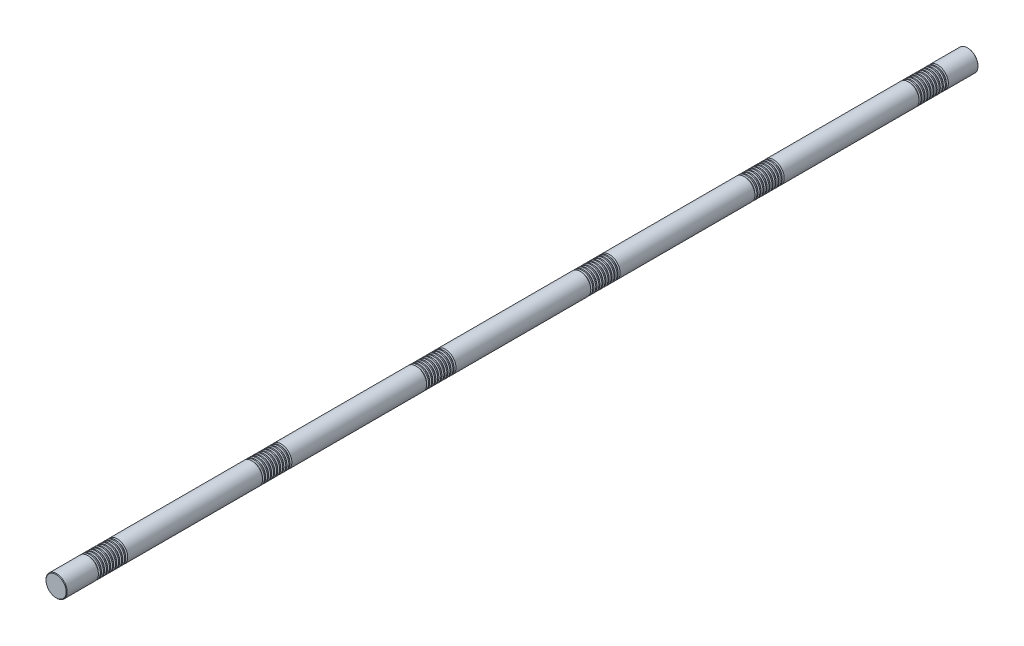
ISO-10303-21;
HEADER;
FILE_DESCRIPTION(('STEP AP214'),'2;1');
FILE_NAME('part.step','',(''),(''),'','','');
FILE_SCHEMA(('AUTOMOTIVE_DESIGN { 1 0 10303 214 1 1 1 1 }'));
ENDSEC;
DATA;
#1=APPLICATION_CONTEXT('core data for automotive mechanical design processes');
#2=APPLICATION_PROTOCOL_DEFINITION('international standard','automotive_design',2000,#1);
#3=PRODUCT_CONTEXT('',#1,'mechanical');
#4=PRODUCT('Part','Part','',(#3));
#5=PRODUCT_RELATED_PRODUCT_CATEGORY('part','',(#4));
#6=PRODUCT_DEFINITION_FORMATION('','',#4);
#7=PRODUCT_DEFINITION_CONTEXT('part definition',#1,'design');
#8=PRODUCT_DEFINITION('design','',#6,#7);
#9=PRODUCT_DEFINITION_SHAPE('','',#8);
#10=(LENGTH_UNIT() NAMED_UNIT(*) SI_UNIT(.MILLI.,.METRE.));
#11=(NAMED_UNIT(*) PLANE_ANGLE_UNIT() SI_UNIT($,.RADIAN.));
#12=(NAMED_UNIT(*) SI_UNIT($,.STERADIAN.) SOLID_ANGLE_UNIT());
#13=UNCERTAINTY_MEASURE_WITH_UNIT(LENGTH_MEASURE(1.E-05),#10,'distance_accuracy_value','');
#14=(GEOMETRIC_REPRESENTATION_CONTEXT(3) GLOBAL_UNCERTAINTY_ASSIGNED_CONTEXT((#13)) GLOBAL_UNIT_ASSIGNED_CONTEXT((#10,
#11,#12)) REPRESENTATION_CONTEXT('',''));
#15=CARTESIAN_POINT('',(0.,0.,0.));
#16=DIRECTION('',(0.,0.,1.));
#17=DIRECTION('',(1.,0.,0.));
#18=AXIS2_PLACEMENT_3D('',#15,#16,#17);
#19=CARTESIAN_POINT('',(0.,0.,1500.));
#20=DIRECTION('',(0.,0.,-1.));
#21=DIRECTION('',(-1.,0.,0.));
#22=AXIS2_PLACEMENT_3D('',#19,#20,#21);
#23=CYLINDRICAL_SURFACE('',#22,35.);
#24=CARTESIAN_POINT('',(0.,0.,1385.73686027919));
#25=DIRECTION('',(0.,0.,1.));
#26=DIRECTION('',(1.,0.,0.));
#27=AXIS2_PLACEMENT_3D('',#24,#25,#26);
#28=CIRCLE('',#27,35.);
#29=CARTESIAN_POINT('',(35.,0.,1385.73686027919));
#30=VERTEX_POINT('',#29);
#31=EDGE_CURVE('E993',#30,#30,#28,.T.);
#32=ORIENTED_EDGE('',*,*,#31,.T.);
#33=EDGE_LOOP('',(#32));
#34=FACE_BOUND('',#33,.T.);
#35=CARTESIAN_POINT('',(0.,0.,1389.26313972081));
#36=DIRECTION('',(0.,0.,1.));
#37=DIRECTION('',(1.,0.,0.));
#38=AXIS2_PLACEMENT_3D('',#35,#36,#37);
#39=CIRCLE('',#38,35.);
#40=CARTESIAN_POINT('',(35.,0.,1389.26313972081));
#41=VERTEX_POINT('',#40);
#42=EDGE_CURVE('E1005',#41,#41,#39,.T.);
#43=ORIENTED_EDGE('',*,*,#42,.F.);
#44=EDGE_LOOP('',(#43));
#45=FACE_BOUND('',#44,.T.);
#46=ADVANCED_FACE('F37',(#34,#45),#23,.T.);
#47=CARTESIAN_POINT('',(0.,0.,1375.73686027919));
#48=DIRECTION('',(0.,0.,1.));
#49=DIRECTION('',(1.,0.,0.));
#50=AXIS2_PLACEMENT_3D('',#47,#48,#49);
#51=CIRCLE('',#50,35.);
#52=CARTESIAN_POINT('',(35.,0.,1375.73686027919));
#53=VERTEX_POINT('',#52);
#54=EDGE_CURVE('E978',#53,#53,#51,.T.);
#55=ORIENTED_EDGE('',*,*,#54,.T.);
#56=EDGE_LOOP('',(#55));
#57=FACE_BOUND('',#56,.T.);
#58=CARTESIAN_POINT('',(0.,0.,1379.26313972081));
#59=DIRECTION('',(0.,0.,1.));
#60=DIRECTION('',(1.,0.,0.));
#61=AXIS2_PLACEMENT_3D('',#58,#59,#60);
#62=CIRCLE('',#61,35.);
#63=CARTESIAN_POINT('',(35.,0.,1379.26313972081));
#64=VERTEX_POINT('',#63);
#65=EDGE_CURVE('E989',#64,#64,#62,.T.);
#66=ORIENTED_EDGE('',*,*,#65,.F.);
#67=EDGE_LOOP('',(#66));
#68=FACE_BOUND('',#67,.T.);
#69=ADVANCED_FACE('F1041',(#57,#68),#23,.T.);
#70=CARTESIAN_POINT('',(0.,0.,1365.73686027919));
#71=DIRECTION('',(0.,0.,1.));
#72=DIRECTION('',(1.,0.,0.));
#73=AXIS2_PLACEMENT_3D('',#70,#71,#72);
#74=CIRCLE('',#73,35.);
#75=CARTESIAN_POINT('',(35.,0.,1365.73686027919));
#76=VERTEX_POINT('',#75);
#77=EDGE_CURVE('E962',#76,#76,#74,.T.);
#78=ORIENTED_EDGE('',*,*,#77,.T.);
#79=EDGE_LOOP('',(#78));
#80=FACE_BOUND('',#79,.T.);
#81=CARTESIAN_POINT('',(0.,0.,1369.26313972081));
#82=DIRECTION('',(0.,0.,1.));
#83=DIRECTION('',(1.,0.,0.));
#84=AXIS2_PLACEMENT_3D('',#81,#82,#83);
#85=CIRCLE('',#84,35.);
#86=CARTESIAN_POINT('',(35.,0.,1369.26313972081));
#87=VERTEX_POINT('',#86);
#88=EDGE_CURVE('E974',#87,#87,#85,.T.);
#89=ORIENTED_EDGE('',*,*,#88,.F.);
#90=EDGE_LOOP('',(#89));
#91=FACE_BOUND('',#90,.T.);
#92=ADVANCED_FACE('F1049',(#80,#91),#23,.T.);
#93=CARTESIAN_POINT('',(0.,0.,1355.73686027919));
#94=DIRECTION('',(0.,0.,1.));
#95=DIRECTION('',(1.,0.,0.));
#96=AXIS2_PLACEMENT_3D('',#93,#94,#95);
#97=CIRCLE('',#96,35.);
#98=CARTESIAN_POINT('',(35.,0.,1355.73686027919));
#99=VERTEX_POINT('',#98);
#100=EDGE_CURVE('E946',#99,#99,#97,.T.);
#101=ORIENTED_EDGE('',*,*,#100,.T.);
#102=EDGE_LOOP('',(#101));
#103=FACE_BOUND('',#102,.T.);
#104=CARTESIAN_POINT('',(0.,0.,1359.26313972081));
#105=DIRECTION('',(0.,0.,1.));
#106=DIRECTION('',(1.,0.,0.));
#107=AXIS2_PLACEMENT_3D('',#104,#105,#106);
#108=CIRCLE('',#107,35.);
#109=CARTESIAN_POINT('',(35.,0.,1359.26313972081));
#110=VERTEX_POINT('',#109);
#111=EDGE_CURVE('E958',#110,#110,#108,.T.);
#112=ORIENTED_EDGE('',*,*,#111,.F.);
#113=EDGE_LOOP('',(#112));
#114=FACE_BOUND('',#113,.T.);
#115=ADVANCED_FACE('F2338',(#103,#114),#23,.T.);
#116=CARTESIAN_POINT('',(0.,0.,1345.73686027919));
#117=DIRECTION('',(0.,0.,1.));
#118=DIRECTION('',(1.,0.,0.));
#119=AXIS2_PLACEMENT_3D('',#116,#117,#118);
#120=CIRCLE('',#119,35.);
#121=CARTESIAN_POINT('',(35.,0.,1345.73686027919));
#122=VERTEX_POINT('',#121);
#123=EDGE_CURVE('E930',#122,#122,#120,.T.);
#124=ORIENTED_EDGE('',*,*,#123,.T.);
#125=EDGE_LOOP('',(#124));
#126=FACE_BOUND('',#125,.T.);
#127=CARTESIAN_POINT('',(0.,0.,1349.26313972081));
#128=DIRECTION('',(0.,0.,1.));
#129=DIRECTION('',(1.,0.,0.));
#130=AXIS2_PLACEMENT_3D('',#127,#128,#129);
#131=CIRCLE('',#130,35.);
#132=CARTESIAN_POINT('',(35.,0.,1349.26313972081));
#133=VERTEX_POINT('',#132);
#134=EDGE_CURVE('E942',#133,#133,#131,.T.);
#135=ORIENTED_EDGE('',*,*,#134,.F.);
#136=EDGE_LOOP('',(#135));
#137=FACE_BOUND('',#136,.T.);
#138=ADVANCED_FACE('F2315',(#126,#137),#23,.T.);
#139=CARTESIAN_POINT('',(0.,0.,1335.73686027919));
#140=DIRECTION('',(0.,0.,1.));
#141=DIRECTION('',(1.,0.,0.));
#142=AXIS2_PLACEMENT_3D('',#139,#140,#141);
#143=CIRCLE('',#142,35.);
#144=CARTESIAN_POINT('',(35.,0.,1335.73686027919));
#145=VERTEX_POINT('',#144);
#146=EDGE_CURVE('E914',#145,#145,#143,.T.);
#147=ORIENTED_EDGE('',*,*,#146,.T.);
#148=EDGE_LOOP('',(#147));
#149=FACE_BOUND('',#148,.T.);
#150=CARTESIAN_POINT('',(0.,0.,1339.26313972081));
#151=DIRECTION('',(0.,0.,1.));
#152=DIRECTION('',(1.,0.,0.));
#153=AXIS2_PLACEMENT_3D('',#150,#151,#152);
#154=CIRCLE('',#153,35.);
#155=CARTESIAN_POINT('',(35.,0.,1339.26313972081));
#156=VERTEX_POINT('',#155);
#157=EDGE_CURVE('E926',#156,#156,#154,.T.);
#158=ORIENTED_EDGE('',*,*,#157,.F.);
#159=EDGE_LOOP('',(#158));
#160=FACE_BOUND('',#159,.T.);
#161=ADVANCED_FACE('F2292',(#149,#160),#23,.T.);
#162=CARTESIAN_POINT('',(0.,0.,1325.73686027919));
#163=DIRECTION('',(0.,0.,1.));
#164=DIRECTION('',(1.,0.,0.));
#165=AXIS2_PLACEMENT_3D('',#162,#163,#164);
#166=CIRCLE('',#165,35.);
#167=CARTESIAN_POINT('',(35.,0.,1325.73686027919));
#168=VERTEX_POINT('',#167);
#169=EDGE_CURVE('E899',#168,#168,#166,.T.);
#170=ORIENTED_EDGE('',*,*,#169,.T.);
#171=EDGE_LOOP('',(#170));
#172=FACE_BOUND('',#171,.T.);
#173=CARTESIAN_POINT('',(0.,0.,1329.26313972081));
#174=DIRECTION('',(0.,0.,1.));
#175=DIRECTION('',(1.,0.,0.));
#176=AXIS2_PLACEMENT_3D('',#173,#174,#175);
#177=CIRCLE('',#176,35.);
#178=CARTESIAN_POINT('',(35.,0.,1329.26313972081));
#179=VERTEX_POINT('',#178);
#180=EDGE_CURVE('E910',#179,#179,#177,.T.);
#181=ORIENTED_EDGE('',*,*,#180,.F.);
#182=EDGE_LOOP('',(#181));
#183=FACE_BOUND('',#182,.T.);
#184=ADVANCED_FACE('F2269',(#172,#183),#23,.T.);
#185=CARTESIAN_POINT('',(0.,0.,1315.73686027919));
#186=DIRECTION('',(0.,0.,1.));
#187=DIRECTION('',(1.,0.,0.));
#188=AXIS2_PLACEMENT_3D('',#185,#186,#187);
#189=CIRCLE('',#188,35.);
#190=CARTESIAN_POINT('',(35.,0.,1315.73686027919));
#191=VERTEX_POINT('',#190);
#192=EDGE_CURVE('E883',#191,#191,#189,.T.);
#193=ORIENTED_EDGE('',*,*,#192,.T.);
#194=EDGE_LOOP('',(#193));
#195=FACE_BOUND('',#194,.T.);
#196=CARTESIAN_POINT('',(0.,0.,1319.26313972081));
#197=DIRECTION('',(0.,0.,1.));
#198=DIRECTION('',(1.,0.,0.));
#199=AXIS2_PLACEMENT_3D('',#196,#197,#198);
#200=CIRCLE('',#199,35.);
#201=CARTESIAN_POINT('',(35.,0.,1319.26313972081));
#202=VERTEX_POINT('',#201);
#203=EDGE_CURVE('E895',#202,#202,#200,.T.);
#204=ORIENTED_EDGE('',*,*,#203,.F.);
#205=EDGE_LOOP('',(#204));
#206=FACE_BOUND('',#205,.T.);
#207=ADVANCED_FACE('F2250',(#195,#206),#23,.T.);
#208=CARTESIAN_POINT('',(0.,0.,1305.73686027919));
#209=DIRECTION('',(0.,0.,1.));
#210=DIRECTION('',(1.,0.,0.));
#211=AXIS2_PLACEMENT_3D('',#208,#209,#210);
#212=CIRCLE('',#211,35.);
#213=CARTESIAN_POINT('',(35.,0.,1305.73686027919));
#214=VERTEX_POINT('',#213);
#215=EDGE_CURVE('E292',#214,#214,#212,.T.);
#216=ORIENTED_EDGE('',*,*,#215,.T.);
#217=EDGE_LOOP('',(#216));
#218=FACE_BOUND('',#217,.T.);
#219=CARTESIAN_POINT('',(0.,0.,1309.26313972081));
#220=DIRECTION('',(0.,0.,1.));
#221=DIRECTION('',(1.,0.,0.));
#222=AXIS2_PLACEMENT_3D('',#219,#220,#221);
#223=CIRCLE('',#222,35.);
#224=CARTESIAN_POINT('',(35.,0.,1309.26313972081));
#225=VERTEX_POINT('',#224);
#226=EDGE_CURVE('E879',#225,#225,#223,.T.);
#227=ORIENTED_EDGE('',*,*,#226,.F.);
#228=EDGE_LOOP('',(#227));
#229=FACE_BOUND('',#228,.T.);
#230=ADVANCED_FACE('F2199',(#218,#229),#23,.T.);
#231=CARTESIAN_POINT('',(0.,0.,845.736860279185));
#232=DIRECTION('',(0.,0.,1.));
#233=DIRECTION('',(1.,0.,0.));
#234=AXIS2_PLACEMENT_3D('',#231,#232,#233);
#235=CIRCLE('',#234,35.);
#236=CARTESIAN_POINT('',(35.,0.,845.736860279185));
#237=VERTEX_POINT('',#236);
#238=EDGE_CURVE('E851',#237,#237,#235,.T.);
#239=ORIENTED_EDGE('',*,*,#238,.T.);
#240=EDGE_LOOP('',(#239));
#241=FACE_BOUND('',#240,.T.);
#242=CARTESIAN_POINT('',(0.,0.,849.263139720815));
#243=DIRECTION('',(0.,0.,1.));
#244=DIRECTION('',(1.,0.,0.));
#245=AXIS2_PLACEMENT_3D('',#242,#243,#244);
#246=CIRCLE('',#245,35.);
#247=CARTESIAN_POINT('',(35.,0.,849.263139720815));
#248=VERTEX_POINT('',#247);
#249=EDGE_CURVE('E863',#248,#248,#246,.T.);
#250=ORIENTED_EDGE('',*,*,#249,.F.);
#251=EDGE_LOOP('',(#250));
#252=FACE_BOUND('',#251,.T.);
#253=ADVANCED_FACE('F2175',(#241,#252),#23,.T.);
#254=CARTESIAN_POINT('',(0.,0.,835.736860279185));
#255=DIRECTION('',(0.,0.,1.));
#256=DIRECTION('',(1.,0.,0.));
#257=AXIS2_PLACEMENT_3D('',#254,#255,#256);
#258=CIRCLE('',#257,35.);
#259=CARTESIAN_POINT('',(35.,0.,835.736860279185));
#260=VERTEX_POINT('',#259);
#261=EDGE_CURVE('E835',#260,#260,#258,.T.);
#262=ORIENTED_EDGE('',*,*,#261,.T.);
#263=EDGE_LOOP('',(#262));
#264=FACE_BOUND('',#263,.T.);
#265=CARTESIAN_POINT('',(0.,0.,839.263139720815));
#266=DIRECTION('',(0.,0.,1.));
#267=DIRECTION('',(1.,0.,0.));
#268=AXIS2_PLACEMENT_3D('',#265,#266,#267);
#269=CIRCLE('',#268,35.);
#270=CARTESIAN_POINT('',(35.,0.,839.263139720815));
#271=VERTEX_POINT('',#270);
#272=EDGE_CURVE('E847',#271,#271,#269,.T.);
#273=ORIENTED_EDGE('',*,*,#272,.F.);
#274=EDGE_LOOP('',(#273));
#275=FACE_BOUND('',#274,.T.);
#276=ADVANCED_FACE('F2152',(#264,#275),#23,.T.);
#277=CARTESIAN_POINT('',(0.,0.,825.736860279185));
#278=DIRECTION('',(0.,0.,1.));
#279=DIRECTION('',(1.,0.,0.));
#280=AXIS2_PLACEMENT_3D('',#277,#278,#279);
#281=CIRCLE('',#280,35.);
#282=CARTESIAN_POINT('',(35.,0.,825.736860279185));
#283=VERTEX_POINT('',#282);
#284=EDGE_CURVE('E819',#283,#283,#281,.T.);
#285=ORIENTED_EDGE('',*,*,#284,.T.);
#286=EDGE_LOOP('',(#285));
#287=FACE_BOUND('',#286,.T.);
#288=CARTESIAN_POINT('',(0.,0.,829.263139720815));
#289=DIRECTION('',(0.,0.,1.));
#290=DIRECTION('',(1.,0.,0.));
#291=AXIS2_PLACEMENT_3D('',#288,#289,#290);
#292=CIRCLE('',#291,35.);
#293=CARTESIAN_POINT('',(35.,0.,829.263139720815));
#294=VERTEX_POINT('',#293);
#295=EDGE_CURVE('E831',#294,#294,#292,.T.);
#296=ORIENTED_EDGE('',*,*,#295,.F.);
#297=EDGE_LOOP('',(#296));
#298=FACE_BOUND('',#297,.T.);
#299=ADVANCED_FACE('F2129',(#287,#298),#23,.T.);
#300=CARTESIAN_POINT('',(0.,0.,815.736860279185));
#301=DIRECTION('',(0.,0.,1.));
#302=DIRECTION('',(1.,0.,0.));
#303=AXIS2_PLACEMENT_3D('',#300,#301,#302);
#304=CIRCLE('',#303,35.);
#305=CARTESIAN_POINT('',(35.,0.,815.736860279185));
#306=VERTEX_POINT('',#305);
#307=EDGE_CURVE('E803',#306,#306,#304,.T.);
#308=ORIENTED_EDGE('',*,*,#307,.T.);
#309=EDGE_LOOP('',(#308));
#310=FACE_BOUND('',#309,.T.);
#311=CARTESIAN_POINT('',(0.,0.,819.263139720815));
#312=DIRECTION('',(0.,0.,1.));
#313=DIRECTION('',(1.,0.,0.));
#314=AXIS2_PLACEMENT_3D('',#311,#312,#313);
#315=CIRCLE('',#314,35.);
#316=CARTESIAN_POINT('',(35.,0.,819.263139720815));
#317=VERTEX_POINT('',#316);
#318=EDGE_CURVE('E815',#317,#317,#315,.T.);
#319=ORIENTED_EDGE('',*,*,#318,.F.);
#320=EDGE_LOOP('',(#319));
#321=FACE_BOUND('',#320,.T.);
#322=ADVANCED_FACE('F2106',(#310,#321),#23,.T.);
#323=CARTESIAN_POINT('',(0.,0.,805.736860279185));
#324=DIRECTION('',(0.,0.,1.));
#325=DIRECTION('',(1.,0.,0.));
#326=AXIS2_PLACEMENT_3D('',#323,#324,#325);
#327=CIRCLE('',#326,35.);
#328=CARTESIAN_POINT('',(35.,0.,805.736860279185));
#329=VERTEX_POINT('',#328);
#330=EDGE_CURVE('E787',#329,#329,#327,.T.);
#331=ORIENTED_EDGE('',*,*,#330,.T.);
#332=EDGE_LOOP('',(#331));
#333=FACE_BOUND('',#332,.T.);
#334=CARTESIAN_POINT('',(0.,0.,809.263139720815));
#335=DIRECTION('',(0.,0.,1.));
#336=DIRECTION('',(1.,0.,0.));
#337=AXIS2_PLACEMENT_3D('',#334,#335,#336);
#338=CIRCLE('',#337,35.);
#339=CARTESIAN_POINT('',(35.,0.,809.263139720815));
#340=VERTEX_POINT('',#339);
#341=EDGE_CURVE('E799',#340,#340,#338,.T.);
#342=ORIENTED_EDGE('',*,*,#341,.F.);
#343=EDGE_LOOP('',(#342));
#344=FACE_BOUND('',#343,.T.);
#345=ADVANCED_FACE('F2083',(#333,#344),#23,.T.);
#346=CARTESIAN_POINT('',(0.,0.,795.736860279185));
#347=DIRECTION('',(0.,0.,1.));
#348=DIRECTION('',(1.,0.,0.));
#349=AXIS2_PLACEMENT_3D('',#346,#347,#348);
#350=CIRCLE('',#349,35.);
#351=CARTESIAN_POINT('',(35.,0.,795.736860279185));
#352=VERTEX_POINT('',#351);
#353=EDGE_CURVE('E771',#352,#352,#350,.T.);
#354=ORIENTED_EDGE('',*,*,#353,.T.);
#355=EDGE_LOOP('',(#354));
#356=FACE_BOUND('',#355,.T.);
#357=CARTESIAN_POINT('',(0.,0.,799.263139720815));
#358=DIRECTION('',(0.,0.,1.));
#359=DIRECTION('',(1.,0.,0.));
#360=AXIS2_PLACEMENT_3D('',#357,#358,#359);
#361=CIRCLE('',#360,35.);
#362=CARTESIAN_POINT('',(35.,0.,799.263139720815));
#363=VERTEX_POINT('',#362);
#364=EDGE_CURVE('E783',#363,#363,#361,.T.);
#365=ORIENTED_EDGE('',*,*,#364,.F.);
#366=EDGE_LOOP('',(#365));
#367=FACE_BOUND('',#366,.T.);
#368=ADVANCED_FACE('F2060',(#356,#367),#23,.T.);
#369=CARTESIAN_POINT('',(0.,0.,785.736860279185));
#370=DIRECTION('',(0.,0.,1.));
#371=DIRECTION('',(1.,0.,0.));
#372=AXIS2_PLACEMENT_3D('',#369,#370,#371);
#373=CIRCLE('',#372,35.);
#374=CARTESIAN_POINT('',(35.,0.,785.736860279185));
#375=VERTEX_POINT('',#374);
#376=EDGE_CURVE('E755',#375,#375,#373,.T.);
#377=ORIENTED_EDGE('',*,*,#376,.T.);
#378=EDGE_LOOP('',(#377));
#379=FACE_BOUND('',#378,.T.);
#380=CARTESIAN_POINT('',(0.,0.,789.263139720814));
#381=DIRECTION('',(0.,0.,1.));
#382=DIRECTION('',(1.,0.,0.));
#383=AXIS2_PLACEMENT_3D('',#380,#381,#382);
#384=CIRCLE('',#383,35.);
#385=CARTESIAN_POINT('',(35.,0.,789.263139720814));
#386=VERTEX_POINT('',#385);
#387=EDGE_CURVE('E767',#386,#386,#384,.T.);
#388=ORIENTED_EDGE('',*,*,#387,.F.);
#389=EDGE_LOOP('',(#388));
#390=FACE_BOUND('',#389,.T.);
#391=ADVANCED_FACE('F2037',(#379,#390),#23,.T.);
#392=CARTESIAN_POINT('',(0.,0.,775.736860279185));
#393=DIRECTION('',(0.,0.,1.));
#394=DIRECTION('',(1.,0.,0.));
#395=AXIS2_PLACEMENT_3D('',#392,#393,#394);
#396=CIRCLE('',#395,35.);
#397=CARTESIAN_POINT('',(35.,0.,775.736860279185));
#398=VERTEX_POINT('',#397);
#399=EDGE_CURVE('E739',#398,#398,#396,.T.);
#400=ORIENTED_EDGE('',*,*,#399,.T.);
#401=EDGE_LOOP('',(#400));
#402=FACE_BOUND('',#401,.T.);
#403=CARTESIAN_POINT('',(0.,0.,779.263139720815));
#404=DIRECTION('',(0.,0.,1.));
#405=DIRECTION('',(1.,0.,0.));
#406=AXIS2_PLACEMENT_3D('',#403,#404,#405);
#407=CIRCLE('',#406,35.);
#408=CARTESIAN_POINT('',(35.,0.,779.263139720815));
#409=VERTEX_POINT('',#408);
#410=EDGE_CURVE('E751',#409,#409,#407,.T.);
#411=ORIENTED_EDGE('',*,*,#410,.F.);
#412=EDGE_LOOP('',(#411));
#413=FACE_BOUND('',#412,.T.);
#414=ADVANCED_FACE('F2018',(#402,#413),#23,.T.);
#415=CARTESIAN_POINT('',(0.,0.,765.736860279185));
#416=DIRECTION('',(0.,0.,1.));
#417=DIRECTION('',(1.,0.,0.));
#418=AXIS2_PLACEMENT_3D('',#415,#416,#417);
#419=CIRCLE('',#418,35.);
#420=CARTESIAN_POINT('',(35.,0.,765.736860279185));
#421=VERTEX_POINT('',#420);
#422=EDGE_CURVE('E276',#421,#421,#419,.T.);
#423=ORIENTED_EDGE('',*,*,#422,.T.);
#424=EDGE_LOOP('',(#423));
#425=FACE_BOUND('',#424,.T.);
#426=CARTESIAN_POINT('',(0.,0.,769.263139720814));
#427=DIRECTION('',(0.,0.,1.));
#428=DIRECTION('',(1.,0.,0.));
#429=AXIS2_PLACEMENT_3D('',#426,#427,#428);
#430=CIRCLE('',#429,35.);
#431=CARTESIAN_POINT('',(35.,0.,769.263139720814));
#432=VERTEX_POINT('',#431);
#433=EDGE_CURVE('E735',#432,#432,#430,.T.);
#434=ORIENTED_EDGE('',*,*,#433,.F.);
#435=EDGE_LOOP('',(#434));
#436=FACE_BOUND('',#435,.T.);
#437=ADVANCED_FACE('F1967',(#425,#436),#23,.T.);
#438=CARTESIAN_POINT('',(0.,0.,305.736860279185));
#439=DIRECTION('',(0.,0.,1.));
#440=DIRECTION('',(1.,0.,0.));
#441=AXIS2_PLACEMENT_3D('',#438,#439,#440);
#442=CIRCLE('',#441,35.);
#443=CARTESIAN_POINT('',(35.,0.,305.736860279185));
#444=VERTEX_POINT('',#443);
#445=EDGE_CURVE('E707',#444,#444,#442,.T.);
#446=ORIENTED_EDGE('',*,*,#445,.T.);
#447=EDGE_LOOP('',(#446));
#448=FACE_BOUND('',#447,.T.);
#449=CARTESIAN_POINT('',(0.,0.,309.263139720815));
#450=DIRECTION('',(0.,0.,1.));
#451=DIRECTION('',(1.,0.,0.));
#452=AXIS2_PLACEMENT_3D('',#449,#450,#451);
#453=CIRCLE('',#452,35.);
#454=CARTESIAN_POINT('',(35.,0.,309.263139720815));
#455=VERTEX_POINT('',#454);
#456=EDGE_CURVE('E719',#455,#455,#453,.T.);
#457=ORIENTED_EDGE('',*,*,#456,.F.);
#458=EDGE_LOOP('',(#457));
#459=FACE_BOUND('',#458,.T.);
#460=ADVANCED_FACE('F1943',(#448,#459),#23,.T.);
#461=CARTESIAN_POINT('',(0.,0.,295.736860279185));
#462=DIRECTION('',(0.,0.,1.));
#463=DIRECTION('',(1.,0.,0.));
#464=AXIS2_PLACEMENT_3D('',#461,#462,#463);
#465=CIRCLE('',#464,35.);
#466=CARTESIAN_POINT('',(35.,0.,295.736860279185));
#467=VERTEX_POINT('',#466);
#468=EDGE_CURVE('E691',#467,#467,#465,.T.);
#469=ORIENTED_EDGE('',*,*,#468,.T.);
#470=EDGE_LOOP('',(#469));
#471=FACE_BOUND('',#470,.T.);
#472=CARTESIAN_POINT('',(0.,0.,299.263139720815));
#473=DIRECTION('',(0.,0.,1.));
#474=DIRECTION('',(1.,0.,0.));
#475=AXIS2_PLACEMENT_3D('',#472,#473,#474);
#476=CIRCLE('',#475,35.);
#477=CARTESIAN_POINT('',(35.,0.,299.263139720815));
#478=VERTEX_POINT('',#477);
#479=EDGE_CURVE('E703',#478,#478,#476,.T.);
#480=ORIENTED_EDGE('',*,*,#479,.F.);
#481=EDGE_LOOP('',(#480));
#482=FACE_BOUND('',#481,.T.);
#483=ADVANCED_FACE('F1920',(#471,#482),#23,.T.);
#484=CARTESIAN_POINT('',(0.,0.,285.736860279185));
#485=DIRECTION('',(0.,0.,1.));
#486=DIRECTION('',(1.,0.,0.));
#487=AXIS2_PLACEMENT_3D('',#484,#485,#486);
#488=CIRCLE('',#487,35.);
#489=CARTESIAN_POINT('',(35.,0.,285.736860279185));
#490=VERTEX_POINT('',#489);
#491=EDGE_CURVE('E675',#490,#490,#488,.T.);
#492=ORIENTED_EDGE('',*,*,#491,.T.);
#493=EDGE_LOOP('',(#492));
#494=FACE_BOUND('',#493,.T.);
#495=CARTESIAN_POINT('',(0.,0.,289.263139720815));
#496=DIRECTION('',(0.,0.,1.));
#497=DIRECTION('',(1.,0.,0.));
#498=AXIS2_PLACEMENT_3D('',#495,#496,#497);
#499=CIRCLE('',#498,35.);
#500=CARTESIAN_POINT('',(35.,0.,289.263139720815));
#501=VERTEX_POINT('',#500);
#502=EDGE_CURVE('E687',#501,#501,#499,.T.);
#503=ORIENTED_EDGE('',*,*,#502,.F.);
#504=EDGE_LOOP('',(#503));
#505=FACE_BOUND('',#504,.T.);
#506=ADVANCED_FACE('F1897',(#494,#505),#23,.T.);
#507=CARTESIAN_POINT('',(0.,0.,275.736860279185));
#508=DIRECTION('',(0.,0.,1.));
#509=DIRECTION('',(1.,0.,0.));
#510=AXIS2_PLACEMENT_3D('',#507,#508,#509);
#511=CIRCLE('',#510,35.);
#512=CARTESIAN_POINT('',(35.,0.,275.736860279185));
#513=VERTEX_POINT('',#512);
#514=EDGE_CURVE('E659',#513,#513,#511,.T.);
#515=ORIENTED_EDGE('',*,*,#514,.T.);
#516=EDGE_LOOP('',(#515));
#517=FACE_BOUND('',#516,.T.);
#518=CARTESIAN_POINT('',(0.,0.,279.263139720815));
#519=DIRECTION('',(0.,0.,1.));
#520=DIRECTION('',(1.,0.,0.));
#521=AXIS2_PLACEMENT_3D('',#518,#519,#520);
#522=CIRCLE('',#521,35.);
#523=CARTESIAN_POINT('',(35.,0.,279.263139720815));
#524=VERTEX_POINT('',#523);
#525=EDGE_CURVE('E671',#524,#524,#522,.T.);
#526=ORIENTED_EDGE('',*,*,#525,.F.);
#527=EDGE_LOOP('',(#526));
#528=FACE_BOUND('',#527,.T.);
#529=ADVANCED_FACE('F1874',(#517,#528),#23,.T.);
#530=CARTESIAN_POINT('',(0.,0.,265.736860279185));
#531=DIRECTION('',(0.,0.,1.));
#532=DIRECTION('',(1.,0.,0.));
#533=AXIS2_PLACEMENT_3D('',#530,#531,#532);
#534=CIRCLE('',#533,35.);
#535=CARTESIAN_POINT('',(35.,0.,265.736860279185));
#536=VERTEX_POINT('',#535);
#537=EDGE_CURVE('E643',#536,#536,#534,.T.);
#538=ORIENTED_EDGE('',*,*,#537,.T.);
#539=EDGE_LOOP('',(#538));
#540=FACE_BOUND('',#539,.T.);
#541=CARTESIAN_POINT('',(0.,0.,269.263139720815));
#542=DIRECTION('',(0.,0.,1.));
#543=DIRECTION('',(1.,0.,0.));
#544=AXIS2_PLACEMENT_3D('',#541,#542,#543);
#545=CIRCLE('',#544,35.);
#546=CARTESIAN_POINT('',(35.,0.,269.263139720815));
#547=VERTEX_POINT('',#546);
#548=EDGE_CURVE('E655',#547,#547,#545,.T.);
#549=ORIENTED_EDGE('',*,*,#548,.F.);
#550=EDGE_LOOP('',(#549));
#551=FACE_BOUND('',#550,.T.);
#552=ADVANCED_FACE('F1851',(#540,#551),#23,.T.);
#553=CARTESIAN_POINT('',(0.,0.,255.736860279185));
#554=DIRECTION('',(0.,0.,1.));
#555=DIRECTION('',(1.,0.,0.));
#556=AXIS2_PLACEMENT_3D('',#553,#554,#555);
#557=CIRCLE('',#556,35.);
#558=CARTESIAN_POINT('',(35.,0.,255.736860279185));
#559=VERTEX_POINT('',#558);
#560=EDGE_CURVE('E627',#559,#559,#557,.T.);
#561=ORIENTED_EDGE('',*,*,#560,.T.);
#562=EDGE_LOOP('',(#561));
#563=FACE_BOUND('',#562,.T.);
#564=CARTESIAN_POINT('',(0.,0.,259.263139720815));
#565=DIRECTION('',(0.,0.,1.));
#566=DIRECTION('',(1.,0.,0.));
#567=AXIS2_PLACEMENT_3D('',#564,#565,#566);
#568=CIRCLE('',#567,35.);
#569=CARTESIAN_POINT('',(35.,0.,259.263139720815));
#570=VERTEX_POINT('',#569);
#571=EDGE_CURVE('E639',#570,#570,#568,.T.);
#572=ORIENTED_EDGE('',*,*,#571,.F.);
#573=EDGE_LOOP('',(#572));
#574=FACE_BOUND('',#573,.T.);
#575=ADVANCED_FACE('F1828',(#563,#574),#23,.T.);
#576=CARTESIAN_POINT('',(0.,0.,245.736860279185));
#577=DIRECTION('',(0.,0.,1.));
#578=DIRECTION('',(1.,0.,0.));
#579=AXIS2_PLACEMENT_3D('',#576,#577,#578);
#580=CIRCLE('',#579,35.);
#581=CARTESIAN_POINT('',(35.,0.,245.736860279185));
#582=VERTEX_POINT('',#581);
#583=EDGE_CURVE('E611',#582,#582,#580,.T.);
#584=ORIENTED_EDGE('',*,*,#583,.T.);
#585=EDGE_LOOP('',(#584));
#586=FACE_BOUND('',#585,.T.);
#587=CARTESIAN_POINT('',(0.,0.,249.263139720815));
#588=DIRECTION('',(0.,0.,1.));
#589=DIRECTION('',(1.,0.,0.));
#590=AXIS2_PLACEMENT_3D('',#587,#588,#589);
#591=CIRCLE('',#590,35.);
#592=CARTESIAN_POINT('',(35.,0.,249.263139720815));
#593=VERTEX_POINT('',#592);
#594=EDGE_CURVE('E623',#593,#593,#591,.T.);
#595=ORIENTED_EDGE('',*,*,#594,.F.);
#596=EDGE_LOOP('',(#595));
#597=FACE_BOUND('',#596,.T.);
#598=ADVANCED_FACE('F1805',(#586,#597),#23,.T.);
#599=CARTESIAN_POINT('',(0.,0.,235.736860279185));
#600=DIRECTION('',(0.,0.,1.));
#601=DIRECTION('',(1.,0.,0.));
#602=AXIS2_PLACEMENT_3D('',#599,#600,#601);
#603=CIRCLE('',#602,35.);
#604=CARTESIAN_POINT('',(35.,0.,235.736860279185));
#605=VERTEX_POINT('',#604);
#606=EDGE_CURVE('E595',#605,#605,#603,.T.);
#607=ORIENTED_EDGE('',*,*,#606,.T.);
#608=EDGE_LOOP('',(#607));
#609=FACE_BOUND('',#608,.T.);
#610=CARTESIAN_POINT('',(0.,0.,239.263139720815));
#611=DIRECTION('',(0.,0.,1.));
#612=DIRECTION('',(1.,0.,0.));
#613=AXIS2_PLACEMENT_3D('',#610,#611,#612);
#614=CIRCLE('',#613,35.);
#615=CARTESIAN_POINT('',(35.,0.,239.263139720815));
#616=VERTEX_POINT('',#615);
#617=EDGE_CURVE('E607',#616,#616,#614,.T.);
#618=ORIENTED_EDGE('',*,*,#617,.F.);
#619=EDGE_LOOP('',(#618));
#620=FACE_BOUND('',#619,.T.);
#621=ADVANCED_FACE('F1786',(#609,#620),#23,.T.);
#622=CARTESIAN_POINT('',(0.,0.,225.736860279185));
#623=DIRECTION('',(0.,0.,1.));
#624=DIRECTION('',(1.,0.,0.));
#625=AXIS2_PLACEMENT_3D('',#622,#623,#624);
#626=CIRCLE('',#625,35.);
#627=CARTESIAN_POINT('',(35.,0.,225.736860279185));
#628=VERTEX_POINT('',#627);
#629=EDGE_CURVE('E260',#628,#628,#626,.T.);
#630=ORIENTED_EDGE('',*,*,#629,.T.);
#631=EDGE_LOOP('',(#630));
#632=FACE_BOUND('',#631,.T.);
#633=CARTESIAN_POINT('',(0.,0.,229.263139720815));
#634=DIRECTION('',(0.,0.,1.));
#635=DIRECTION('',(1.,0.,0.));
#636=AXIS2_PLACEMENT_3D('',#633,#634,#635);
#637=CIRCLE('',#636,35.);
#638=CARTESIAN_POINT('',(35.,0.,229.263139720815));
#639=VERTEX_POINT('',#638);
#640=EDGE_CURVE('E591',#639,#639,#637,.T.);
#641=ORIENTED_EDGE('',*,*,#640,.F.);
#642=EDGE_LOOP('',(#641));
#643=FACE_BOUND('',#642,.T.);
#644=ADVANCED_FACE('F1735',(#632,#643),#23,.T.);
#645=CARTESIAN_POINT('',(0.,0.,-234.263139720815));
#646=DIRECTION('',(0.,0.,1.));
#647=DIRECTION('',(1.,0.,0.));
#648=AXIS2_PLACEMENT_3D('',#645,#646,#647);
#649=CIRCLE('',#648,35.);
#650=CARTESIAN_POINT('',(35.,0.,-234.263139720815));
#651=VERTEX_POINT('',#650);
#652=EDGE_CURVE('E563',#651,#651,#649,.T.);
#653=ORIENTED_EDGE('',*,*,#652,.T.);
#654=EDGE_LOOP('',(#653));
#655=FACE_BOUND('',#654,.T.);
#656=CARTESIAN_POINT('',(0.,0.,-230.736860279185));
#657=DIRECTION('',(0.,0.,1.));
#658=DIRECTION('',(1.,0.,0.));
#659=AXIS2_PLACEMENT_3D('',#656,#657,#658);
#660=CIRCLE('',#659,35.);
#661=CARTESIAN_POINT('',(35.,0.,-230.736860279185));
#662=VERTEX_POINT('',#661);
#663=EDGE_CURVE('E575',#662,#662,#660,.T.);
#664=ORIENTED_EDGE('',*,*,#663,.F.);
#665=EDGE_LOOP('',(#664));
#666=FACE_BOUND('',#665,.T.);
#667=ADVANCED_FACE('F1711',(#655,#666),#23,.T.);
#668=CARTESIAN_POINT('',(0.,0.,-244.263139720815));
#669=DIRECTION('',(0.,0.,1.));
#670=DIRECTION('',(1.,0.,0.));
#671=AXIS2_PLACEMENT_3D('',#668,#669,#670);
#672=CIRCLE('',#671,35.);
#673=CARTESIAN_POINT('',(35.,0.,-244.263139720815));
#674=VERTEX_POINT('',#673);
#675=EDGE_CURVE('E547',#674,#674,#672,.T.);
#676=ORIENTED_EDGE('',*,*,#675,.T.);
#677=EDGE_LOOP('',(#676));
#678=FACE_BOUND('',#677,.T.);
#679=CARTESIAN_POINT('',(0.,0.,-240.736860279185));
#680=DIRECTION('',(0.,0.,1.));
#681=DIRECTION('',(1.,0.,0.));
#682=AXIS2_PLACEMENT_3D('',#679,#680,#681);
#683=CIRCLE('',#682,35.);
#684=CARTESIAN_POINT('',(35.,0.,-240.736860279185));
#685=VERTEX_POINT('',#684);
#686=EDGE_CURVE('E559',#685,#685,#683,.T.);
#687=ORIENTED_EDGE('',*,*,#686,.F.);
#688=EDGE_LOOP('',(#687));
#689=FACE_BOUND('',#688,.T.);
#690=ADVANCED_FACE('F1688',(#678,#689),#23,.T.);
#691=CARTESIAN_POINT('',(0.,0.,-254.263139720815));
#692=DIRECTION('',(0.,0.,1.));
#693=DIRECTION('',(1.,0.,0.));
#694=AXIS2_PLACEMENT_3D('',#691,#692,#693);
#695=CIRCLE('',#694,35.);
#696=CARTESIAN_POINT('',(35.,0.,-254.263139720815));
#697=VERTEX_POINT('',#696);
#698=EDGE_CURVE('E531',#697,#697,#695,.T.);
#699=ORIENTED_EDGE('',*,*,#698,.T.);
#700=EDGE_LOOP('',(#699));
#701=FACE_BOUND('',#700,.T.);
#702=CARTESIAN_POINT('',(0.,0.,-250.736860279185));
#703=DIRECTION('',(0.,0.,1.));
#704=DIRECTION('',(1.,0.,0.));
#705=AXIS2_PLACEMENT_3D('',#702,#703,#704);
#706=CIRCLE('',#705,35.);
#707=CARTESIAN_POINT('',(35.,0.,-250.736860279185));
#708=VERTEX_POINT('',#707);
#709=EDGE_CURVE('E543',#708,#708,#706,.T.);
#710=ORIENTED_EDGE('',*,*,#709,.F.);
#711=EDGE_LOOP('',(#710));
#712=FACE_BOUND('',#711,.T.);
#713=ADVANCED_FACE('F1665',(#701,#712),#23,.T.);
#714=CARTESIAN_POINT('',(0.,0.,-264.263139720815));
#715=DIRECTION('',(0.,0.,1.));
#716=DIRECTION('',(1.,0.,0.));
#717=AXIS2_PLACEMENT_3D('',#714,#715,#716);
#718=CIRCLE('',#717,35.);
#719=CARTESIAN_POINT('',(35.,0.,-264.263139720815));
#720=VERTEX_POINT('',#719);
#721=EDGE_CURVE('E515',#720,#720,#718,.T.);
#722=ORIENTED_EDGE('',*,*,#721,.T.);
#723=EDGE_LOOP('',(#722));
#724=FACE_BOUND('',#723,.T.);
#725=CARTESIAN_POINT('',(0.,0.,-260.736860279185));
#726=DIRECTION('',(0.,0.,1.));
#727=DIRECTION('',(1.,0.,0.));
#728=AXIS2_PLACEMENT_3D('',#725,#726,#727);
#729=CIRCLE('',#728,35.);
#730=CARTESIAN_POINT('',(35.,0.,-260.736860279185));
#731=VERTEX_POINT('',#730);
#732=EDGE_CURVE('E527',#731,#731,#729,.T.);
#733=ORIENTED_EDGE('',*,*,#732,.F.);
#734=EDGE_LOOP('',(#733));
#735=FACE_BOUND('',#734,.T.);
#736=ADVANCED_FACE('F1642',(#724,#735),#23,.T.);
#737=CARTESIAN_POINT('',(0.,0.,-274.263139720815));
#738=DIRECTION('',(0.,0.,1.));
#739=DIRECTION('',(1.,0.,0.));
#740=AXIS2_PLACEMENT_3D('',#737,#738,#739);
#741=CIRCLE('',#740,35.);
#742=CARTESIAN_POINT('',(35.,0.,-274.263139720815));
#743=VERTEX_POINT('',#742);
#744=EDGE_CURVE('E499',#743,#743,#741,.T.);
#745=ORIENTED_EDGE('',*,*,#744,.T.);
#746=EDGE_LOOP('',(#745));
#747=FACE_BOUND('',#746,.T.);
#748=CARTESIAN_POINT('',(0.,0.,-270.736860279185));
#749=DIRECTION('',(0.,0.,1.));
#750=DIRECTION('',(1.,0.,0.));
#751=AXIS2_PLACEMENT_3D('',#748,#749,#750);
#752=CIRCLE('',#751,35.);
#753=CARTESIAN_POINT('',(35.,0.,-270.736860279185));
#754=VERTEX_POINT('',#753);
#755=EDGE_CURVE('E511',#754,#754,#752,.T.);
#756=ORIENTED_EDGE('',*,*,#755,.F.);
#757=EDGE_LOOP('',(#756));
#758=FACE_BOUND('',#757,.T.);
#759=ADVANCED_FACE('F1619',(#747,#758),#23,.T.);
#760=CARTESIAN_POINT('',(0.,0.,-284.263139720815));
#761=DIRECTION('',(0.,0.,1.));
#762=DIRECTION('',(1.,0.,0.));
#763=AXIS2_PLACEMENT_3D('',#760,#761,#762);
#764=CIRCLE('',#763,35.);
#765=CARTESIAN_POINT('',(35.,0.,-284.263139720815));
#766=VERTEX_POINT('',#765);
#767=EDGE_CURVE('E483',#766,#766,#764,.T.);
#768=ORIENTED_EDGE('',*,*,#767,.T.);
#769=EDGE_LOOP('',(#768));
#770=FACE_BOUND('',#769,.T.);
#771=CARTESIAN_POINT('',(0.,0.,-280.736860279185));
#772=DIRECTION('',(0.,0.,1.));
#773=DIRECTION('',(1.,0.,0.));
#774=AXIS2_PLACEMENT_3D('',#771,#772,#773);
#775=CIRCLE('',#774,35.);
#776=CARTESIAN_POINT('',(35.,0.,-280.736860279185));
#777=VERTEX_POINT('',#776);
#778=EDGE_CURVE('E495',#777,#777,#775,.T.);
#779=ORIENTED_EDGE('',*,*,#778,.F.);
#780=EDGE_LOOP('',(#779));
#781=FACE_BOUND('',#780,.T.);
#782=ADVANCED_FACE('F1596',(#770,#781),#23,.T.);
#783=CARTESIAN_POINT('',(0.,0.,-294.263139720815));
#784=DIRECTION('',(0.,0.,1.));
#785=DIRECTION('',(1.,0.,0.));
#786=AXIS2_PLACEMENT_3D('',#783,#784,#785);
#787=CIRCLE('',#786,35.);
#788=CARTESIAN_POINT('',(35.,0.,-294.263139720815));
#789=VERTEX_POINT('',#788);
#790=EDGE_CURVE('E467',#789,#789,#787,.T.);
#791=ORIENTED_EDGE('',*,*,#790,.T.);
#792=EDGE_LOOP('',(#791));
#793=FACE_BOUND('',#792,.T.);
#794=CARTESIAN_POINT('',(0.,0.,-290.736860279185));
#795=DIRECTION('',(0.,0.,1.));
#796=DIRECTION('',(1.,0.,0.));
#797=AXIS2_PLACEMENT_3D('',#794,#795,#796);
#798=CIRCLE('',#797,35.);
#799=CARTESIAN_POINT('',(35.,0.,-290.736860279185));
#800=VERTEX_POINT('',#799);
#801=EDGE_CURVE('E479',#800,#800,#798,.T.);
#802=ORIENTED_EDGE('',*,*,#801,.F.);
#803=EDGE_LOOP('',(#802));
#804=FACE_BOUND('',#803,.T.);
#805=ADVANCED_FACE('F1573',(#793,#804),#23,.T.);
#806=CARTESIAN_POINT('',(0.,0.,-304.263139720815));
#807=DIRECTION('',(0.,0.,1.));
#808=DIRECTION('',(1.,0.,0.));
#809=AXIS2_PLACEMENT_3D('',#806,#807,#808);
#810=CIRCLE('',#809,35.);
#811=CARTESIAN_POINT('',(35.,0.,-304.263139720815));
#812=VERTEX_POINT('',#811);
#813=EDGE_CURVE('E451',#812,#812,#810,.T.);
#814=ORIENTED_EDGE('',*,*,#813,.T.);
#815=EDGE_LOOP('',(#814));
#816=FACE_BOUND('',#815,.T.);
#817=CARTESIAN_POINT('',(0.,0.,-300.736860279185));
#818=DIRECTION('',(0.,0.,1.));
#819=DIRECTION('',(1.,0.,0.));
#820=AXIS2_PLACEMENT_3D('',#817,#818,#819);
#821=CIRCLE('',#820,35.);
#822=CARTESIAN_POINT('',(35.,0.,-300.736860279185));
#823=VERTEX_POINT('',#822);
#824=EDGE_CURVE('E463',#823,#823,#821,.T.);
#825=ORIENTED_EDGE('',*,*,#824,.F.);
#826=EDGE_LOOP('',(#825));
#827=FACE_BOUND('',#826,.T.);
#828=ADVANCED_FACE('F1554',(#816,#827),#23,.T.);
#829=CARTESIAN_POINT('',(0.,0.,-314.263139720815));
#830=DIRECTION('',(0.,0.,1.));
#831=DIRECTION('',(1.,0.,0.));
#832=AXIS2_PLACEMENT_3D('',#829,#830,#831);
#833=CIRCLE('',#832,35.);
#834=CARTESIAN_POINT('',(35.,0.,-314.263139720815));
#835=VERTEX_POINT('',#834);
#836=EDGE_CURVE('E244',#835,#835,#833,.T.);
#837=ORIENTED_EDGE('',*,*,#836,.T.);
#838=EDGE_LOOP('',(#837));
#839=FACE_BOUND('',#838,.T.);
#840=CARTESIAN_POINT('',(0.,0.,-310.736860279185));
#841=DIRECTION('',(0.,0.,1.));
#842=DIRECTION('',(1.,0.,0.));
#843=AXIS2_PLACEMENT_3D('',#840,#841,#842);
#844=CIRCLE('',#843,35.);
#845=CARTESIAN_POINT('',(35.,0.,-310.736860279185));
#846=VERTEX_POINT('',#845);
#847=EDGE_CURVE('E447',#846,#846,#844,.T.);
#848=ORIENTED_EDGE('',*,*,#847,.F.);
#849=EDGE_LOOP('',(#848));
#850=FACE_BOUND('',#849,.T.);
#851=ADVANCED_FACE('F1503',(#839,#850),#23,.T.);
#852=CARTESIAN_POINT('',(0.,0.,-774.263139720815));
#853=DIRECTION('',(0.,0.,1.));
#854=DIRECTION('',(1.,0.,0.));
#855=AXIS2_PLACEMENT_3D('',#852,#853,#854);
#856=CIRCLE('',#855,35.);
#857=CARTESIAN_POINT('',(35.,0.,-774.263139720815));
#858=VERTEX_POINT('',#857);
#859=EDGE_CURVE('E419',#858,#858,#856,.T.);
#860=ORIENTED_EDGE('',*,*,#859,.T.);
#861=EDGE_LOOP('',(#860));
#862=FACE_BOUND('',#861,.T.);
#863=CARTESIAN_POINT('',(0.,0.,-770.736860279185));
#864=DIRECTION('',(0.,0.,1.));
#865=DIRECTION('',(1.,0.,0.));
#866=AXIS2_PLACEMENT_3D('',#863,#864,#865);
#867=CIRCLE('',#866,35.);
#868=CARTESIAN_POINT('',(35.,0.,-770.736860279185));
#869=VERTEX_POINT('',#868);
#870=EDGE_CURVE('E431',#869,#869,#867,.T.);
#871=ORIENTED_EDGE('',*,*,#870,.F.);
#872=EDGE_LOOP('',(#871));
#873=FACE_BOUND('',#872,.T.);
#874=ADVANCED_FACE('F1479',(#862,#873),#23,.T.);
#875=CARTESIAN_POINT('',(0.,0.,-784.263139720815));
#876=DIRECTION('',(0.,0.,1.));
#877=DIRECTION('',(1.,0.,0.));
#878=AXIS2_PLACEMENT_3D('',#875,#876,#877);
#879=CIRCLE('',#878,35.);
#880=CARTESIAN_POINT('',(35.,0.,-784.263139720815));
#881=VERTEX_POINT('',#880);
#882=EDGE_CURVE('E403',#881,#881,#879,.T.);
#883=ORIENTED_EDGE('',*,*,#882,.T.);
#884=EDGE_LOOP('',(#883));
#885=FACE_BOUND('',#884,.T.);
#886=CARTESIAN_POINT('',(0.,0.,-780.736860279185));
#887=DIRECTION('',(0.,0.,1.));
#888=DIRECTION('',(1.,0.,0.));
#889=AXIS2_PLACEMENT_3D('',#886,#887,#888);
#890=CIRCLE('',#889,35.);
#891=CARTESIAN_POINT('',(35.,0.,-780.736860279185));
#892=VERTEX_POINT('',#891);
#893=EDGE_CURVE('E415',#892,#892,#890,.T.);
#894=ORIENTED_EDGE('',*,*,#893,.F.);
#895=EDGE_LOOP('',(#894));
#896=FACE_BOUND('',#895,.T.);
#897=ADVANCED_FACE('F1456',(#885,#896),#23,.T.);
#898=CARTESIAN_POINT('',(0.,0.,-794.263139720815));
#899=DIRECTION('',(0.,0.,1.));
#900=DIRECTION('',(1.,0.,0.));
#901=AXIS2_PLACEMENT_3D('',#898,#899,#900);
#902=CIRCLE('',#901,35.);
#903=CARTESIAN_POINT('',(35.,0.,-794.263139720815));
#904=VERTEX_POINT('',#903);
#905=EDGE_CURVE('E387',#904,#904,#902,.T.);
#906=ORIENTED_EDGE('',*,*,#905,.T.);
#907=EDGE_LOOP('',(#906));
#908=FACE_BOUND('',#907,.T.);
#909=CARTESIAN_POINT('',(0.,0.,-790.736860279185));
#910=DIRECTION('',(0.,0.,1.));
#911=DIRECTION('',(1.,0.,0.));
#912=AXIS2_PLACEMENT_3D('',#909,#910,#911);
#913=CIRCLE('',#912,35.);
#914=CARTESIAN_POINT('',(35.,0.,-790.736860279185));
#915=VERTEX_POINT('',#914);
#916=EDGE_CURVE('E399',#915,#915,#913,.T.);
#917=ORIENTED_EDGE('',*,*,#916,.F.);
#918=EDGE_LOOP('',(#917));
#919=FACE_BOUND('',#918,.T.);
#920=ADVANCED_FACE('F1433',(#908,#919),#23,.T.);
#921=CARTESIAN_POINT('',(0.,0.,-804.263139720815));
#922=DIRECTION('',(0.,0.,1.));
#923=DIRECTION('',(1.,0.,0.));
#924=AXIS2_PLACEMENT_3D('',#921,#922,#923);
#925=CIRCLE('',#924,35.);
#926=CARTESIAN_POINT('',(35.,0.,-804.263139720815));
#927=VERTEX_POINT('',#926);
#928=EDGE_CURVE('E371',#927,#927,#925,.T.);
#929=ORIENTED_EDGE('',*,*,#928,.T.);
#930=EDGE_LOOP('',(#929));
#931=FACE_BOUND('',#930,.T.);
#932=CARTESIAN_POINT('',(0.,0.,-800.736860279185));
#933=DIRECTION('',(0.,0.,1.));
#934=DIRECTION('',(1.,0.,0.));
#935=AXIS2_PLACEMENT_3D('',#932,#933,#934);
#936=CIRCLE('',#935,35.);
#937=CARTESIAN_POINT('',(35.,0.,-800.736860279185));
#938=VERTEX_POINT('',#937);
#939=EDGE_CURVE('E383',#938,#938,#936,.T.);
#940=ORIENTED_EDGE('',*,*,#939,.F.);
#941=EDGE_LOOP('',(#940));
#942=FACE_BOUND('',#941,.T.);
#943=ADVANCED_FACE('F1410',(#931,#942),#23,.T.);
#944=CARTESIAN_POINT('',(0.,0.,-814.263139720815));
#945=DIRECTION('',(0.,0.,1.));
#946=DIRECTION('',(1.,0.,0.));
#947=AXIS2_PLACEMENT_3D('',#944,#945,#946);
#948=CIRCLE('',#947,35.);
#949=CARTESIAN_POINT('',(35.,0.,-814.263139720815));
#950=VERTEX_POINT('',#949);
#951=EDGE_CURVE('E355',#950,#950,#948,.T.);
#952=ORIENTED_EDGE('',*,*,#951,.T.);
#953=EDGE_LOOP('',(#952));
#954=FACE_BOUND('',#953,.T.);
#955=CARTESIAN_POINT('',(0.,0.,-810.736860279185));
#956=DIRECTION('',(0.,0.,1.));
#957=DIRECTION('',(1.,0.,0.));
#958=AXIS2_PLACEMENT_3D('',#955,#956,#957);
#959=CIRCLE('',#958,35.);
#960=CARTESIAN_POINT('',(35.,0.,-810.736860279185));
#961=VERTEX_POINT('',#960);
#962=EDGE_CURVE('E367',#961,#961,#959,.T.);
#963=ORIENTED_EDGE('',*,*,#962,.F.);
#964=EDGE_LOOP('',(#963));
#965=FACE_BOUND('',#964,.T.);
#966=ADVANCED_FACE('F1387',(#954,#965),#23,.T.);
#967=CARTESIAN_POINT('',(0.,0.,-824.263139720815));
#968=DIRECTION('',(0.,0.,1.));
#969=DIRECTION('',(1.,0.,0.));
#970=AXIS2_PLACEMENT_3D('',#967,#968,#969);
#971=CIRCLE('',#970,35.);
#972=CARTESIAN_POINT('',(35.,0.,-824.263139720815));
#973=VERTEX_POINT('',#972);
#974=EDGE_CURVE('E339',#973,#973,#971,.T.);
#975=ORIENTED_EDGE('',*,*,#974,.T.);
#976=EDGE_LOOP('',(#975));
#977=FACE_BOUND('',#976,.T.);
#978=CARTESIAN_POINT('',(0.,0.,-820.736860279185));
#979=DIRECTION('',(0.,0.,1.));
#980=DIRECTION('',(1.,0.,0.));
#981=AXIS2_PLACEMENT_3D('',#978,#979,#980);
#982=CIRCLE('',#981,35.);
#983=CARTESIAN_POINT('',(35.,0.,-820.736860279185));
#984=VERTEX_POINT('',#983);
#985=EDGE_CURVE('E351',#984,#984,#982,.T.);
#986=ORIENTED_EDGE('',*,*,#985,.F.);
#987=EDGE_LOOP('',(#986));
#988=FACE_BOUND('',#987,.T.);
#989=ADVANCED_FACE('F1364',(#977,#988),#23,.T.);
#990=CARTESIAN_POINT('',(0.,0.,-834.263139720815));
#991=DIRECTION('',(0.,0.,1.));
#992=DIRECTION('',(1.,0.,0.));
#993=AXIS2_PLACEMENT_3D('',#990,#991,#992);
#994=CIRCLE('',#993,35.);
#995=CARTESIAN_POINT('',(35.,0.,-834.263139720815));
#996=VERTEX_POINT('',#995);
#997=EDGE_CURVE('E323',#996,#996,#994,.T.);
#998=ORIENTED_EDGE('',*,*,#997,.T.);
#999=EDGE_LOOP('',(#998));
#1000=FACE_BOUND('',#999,.T.);
#1001=CARTESIAN_POINT('',(0.,0.,-830.736860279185));
#1002=DIRECTION('',(0.,0.,1.));
#1003=DIRECTION('',(1.,0.,0.));
#1004=AXIS2_PLACEMENT_3D('',#1001,#1002,#1003);
#1005=CIRCLE('',#1004,35.);
#1006=CARTESIAN_POINT('',(35.,0.,-830.736860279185));
#1007=VERTEX_POINT('',#1006);
#1008=EDGE_CURVE('E335',#1007,#1007,#1005,.T.);
#1009=ORIENTED_EDGE('',*,*,#1008,.F.);
#1010=EDGE_LOOP('',(#1009));
#1011=FACE_BOUND('',#1010,.T.);
#1012=ADVANCED_FACE('F1341',(#1000,#1011),#23,.T.);
#1013=CARTESIAN_POINT('',(0.,0.,-844.263139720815));
#1014=DIRECTION('',(0.,0.,1.));
#1015=DIRECTION('',(1.,0.,0.));
#1016=AXIS2_PLACEMENT_3D('',#1013,#1014,#1015);
#1017=CIRCLE('',#1016,35.);
#1018=CARTESIAN_POINT('',(35.,0.,-844.263139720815));
#1019=VERTEX_POINT('',#1018);
#1020=EDGE_CURVE('E308',#1019,#1019,#1017,.T.);
#1021=ORIENTED_EDGE('',*,*,#1020,.T.);
#1022=EDGE_LOOP('',(#1021));
#1023=FACE_BOUND('',#1022,.T.);
#1024=CARTESIAN_POINT('',(0.,0.,-840.736860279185));
#1025=DIRECTION('',(0.,0.,1.));
#1026=DIRECTION('',(1.,0.,0.));
#1027=AXIS2_PLACEMENT_3D('',#1024,#1025,#1026);
#1028=CIRCLE('',#1027,35.);
#1029=CARTESIAN_POINT('',(35.,0.,-840.736860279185));
#1030=VERTEX_POINT('',#1029);
#1031=EDGE_CURVE('E319',#1030,#1030,#1028,.T.);
#1032=ORIENTED_EDGE('',*,*,#1031,.F.);
#1033=EDGE_LOOP('',(#1032));
#1034=FACE_BOUND('',#1033,.T.);
#1035=ADVANCED_FACE('F1318',(#1023,#1034),#23,.T.);
#1036=CARTESIAN_POINT('',(0.,0.,-854.263139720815));
#1037=DIRECTION('',(0.,0.,1.));
#1038=DIRECTION('',(1.,0.,0.));
#1039=AXIS2_PLACEMENT_3D('',#1036,#1037,#1038);
#1040=CIRCLE('',#1039,35.);
#1041=CARTESIAN_POINT('',(35.,0.,-854.263139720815));
#1042=VERTEX_POINT('',#1041);
#1043=EDGE_CURVE('E228',#1042,#1042,#1040,.T.);
#1044=ORIENTED_EDGE('',*,*,#1043,.T.);
#1045=EDGE_LOOP('',(#1044));
#1046=FACE_BOUND('',#1045,.T.);
#1047=CARTESIAN_POINT('',(0.,0.,-850.736860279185));
#1048=DIRECTION('',(0.,0.,1.));
#1049=DIRECTION('',(1.,0.,0.));
#1050=AXIS2_PLACEMENT_3D('',#1047,#1048,#1049);
#1051=CIRCLE('',#1050,35.);
#1052=CARTESIAN_POINT('',(35.,0.,-850.736860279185));
#1053=VERTEX_POINT('',#1052);
#1054=EDGE_CURVE('E304',#1053,#1053,#1051,.T.);
#1055=ORIENTED_EDGE('',*,*,#1054,.F.);
#1056=EDGE_LOOP('',(#1055));
#1057=FACE_BOUND('',#1056,.T.);
#1058=ADVANCED_FACE('F1295',(#1046,#1057),#23,.T.);
#1059=CARTESIAN_POINT('',(0.,0.,-1304.26313972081));
#1060=DIRECTION('',(0.,0.,1.));
#1061=DIRECTION('',(1.,0.,0.));
#1062=AXIS2_PLACEMENT_3D('',#1059,#1060,#1061);
#1063=CIRCLE('',#1062,35.);
#1064=CARTESIAN_POINT('',(35.,0.,-1304.26313972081));
#1065=VERTEX_POINT('',#1064);
#1066=EDGE_CURVE('E212',#1065,#1065,#1063,.T.);
#1067=ORIENTED_EDGE('',*,*,#1066,.T.);
#1068=EDGE_LOOP('',(#1067));
#1069=FACE_BOUND('',#1068,.T.);
#1070=CARTESIAN_POINT('',(0.,0.,-860.736860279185));
#1071=DIRECTION('',(0.,0.,1.));
#1072=DIRECTION('',(1.,0.,0.));
#1073=AXIS2_PLACEMENT_3D('',#1070,#1071,#1072);
#1074=CIRCLE('',#1073,35.);
#1075=CARTESIAN_POINT('',(35.,0.,-860.736860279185));
#1076=VERTEX_POINT('',#1075);
#1077=EDGE_CURVE('E224',#1076,#1076,#1074,.T.);
#1078=ORIENTED_EDGE('',*,*,#1077,.F.);
#1079=EDGE_LOOP('',(#1078));
#1080=FACE_BOUND('',#1079,.T.);
#1081=ADVANCED_FACE('F1272',(#1069,#1080),#23,.T.);
#1082=CARTESIAN_POINT('',(0.,0.,-1314.26313972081));
#1083=DIRECTION('',(0.,0.,1.));
#1084=DIRECTION('',(1.,0.,0.));
#1085=AXIS2_PLACEMENT_3D('',#1082,#1083,#1084);
#1086=CIRCLE('',#1085,35.);
#1087=CARTESIAN_POINT('',(35.,0.,-1314.26313972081));
#1088=VERTEX_POINT('',#1087);
#1089=EDGE_CURVE('E196',#1088,#1088,#1086,.T.);
#1090=ORIENTED_EDGE('',*,*,#1089,.T.);
#1091=EDGE_LOOP('',(#1090));
#1092=FACE_BOUND('',#1091,.T.);
#1093=CARTESIAN_POINT('',(0.,0.,-1310.73686027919));
#1094=DIRECTION('',(0.,0.,1.));
#1095=DIRECTION('',(1.,0.,0.));
#1096=AXIS2_PLACEMENT_3D('',#1093,#1094,#1095);
#1097=CIRCLE('',#1096,35.);
#1098=CARTESIAN_POINT('',(35.,0.,-1310.73686027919));
#1099=VERTEX_POINT('',#1098);
#1100=EDGE_CURVE('E208',#1099,#1099,#1097,.T.);
#1101=ORIENTED_EDGE('',*,*,#1100,.F.);
#1102=EDGE_LOOP('',(#1101));
#1103=FACE_BOUND('',#1102,.T.);
#1104=ADVANCED_FACE('F1249',(#1092,#1103),#23,.T.);
#1105=CARTESIAN_POINT('',(0.,0.,-1324.26313972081));
#1106=DIRECTION('',(0.,0.,1.));
#1107=DIRECTION('',(1.,0.,0.));
#1108=AXIS2_PLACEMENT_3D('',#1105,#1106,#1107);
#1109=CIRCLE('',#1108,35.);
#1110=CARTESIAN_POINT('',(35.,0.,-1324.26313972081));
#1111=VERTEX_POINT('',#1110);
#1112=EDGE_CURVE('E181',#1111,#1111,#1109,.T.);
#1113=ORIENTED_EDGE('',*,*,#1112,.T.);
#1114=EDGE_LOOP('',(#1113));
#1115=FACE_BOUND('',#1114,.T.);
#1116=CARTESIAN_POINT('',(0.,0.,-1320.73686027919));
#1117=DIRECTION('',(0.,0.,1.));
#1118=DIRECTION('',(1.,0.,0.));
#1119=AXIS2_PLACEMENT_3D('',#1116,#1117,#1118);
#1120=CIRCLE('',#1119,35.);
#1121=CARTESIAN_POINT('',(35.,0.,-1320.73686027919));
#1122=VERTEX_POINT('',#1121);
#1123=EDGE_CURVE('E192',#1122,#1122,#1120,.T.);
#1124=ORIENTED_EDGE('',*,*,#1123,.F.);
#1125=EDGE_LOOP('',(#1124));
#1126=FACE_BOUND('',#1125,.T.);
#1127=ADVANCED_FACE('F1226',(#1115,#1126),#23,.T.);
#1128=CARTESIAN_POINT('',(0.,0.,-1334.26313972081));
#1129=DIRECTION('',(0.,0.,1.));
#1130=DIRECTION('',(1.,0.,0.));
#1131=AXIS2_PLACEMENT_3D('',#1128,#1129,#1130);
#1132=CIRCLE('',#1131,35.);
#1133=CARTESIAN_POINT('',(35.,0.,-1334.26313972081));
#1134=VERTEX_POINT('',#1133);
#1135=EDGE_CURVE('E165',#1134,#1134,#1132,.T.);
#1136=ORIENTED_EDGE('',*,*,#1135,.T.);
#1137=EDGE_LOOP('',(#1136));
#1138=FACE_BOUND('',#1137,.T.);
#1139=CARTESIAN_POINT('',(0.,0.,-1330.73686027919));
#1140=DIRECTION('',(0.,0.,1.));
#1141=DIRECTION('',(1.,0.,0.));
#1142=AXIS2_PLACEMENT_3D('',#1139,#1140,#1141);
#1143=CIRCLE('',#1142,35.);
#1144=CARTESIAN_POINT('',(35.,0.,-1330.73686027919));
#1145=VERTEX_POINT('',#1144);
#1146=EDGE_CURVE('E177',#1145,#1145,#1143,.T.);
#1147=ORIENTED_EDGE('',*,*,#1146,.F.);
#1148=EDGE_LOOP('',(#1147));
#1149=FACE_BOUND('',#1148,.T.);
#1150=ADVANCED_FACE('F1203',(#1138,#1149),#23,.T.);
#1151=CARTESIAN_POINT('',(0.,0.,-1344.26313972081));
#1152=DIRECTION('',(0.,0.,1.));
#1153=DIRECTION('',(1.,0.,0.));
#1154=AXIS2_PLACEMENT_3D('',#1151,#1152,#1153);
#1155=CIRCLE('',#1154,35.);
#1156=CARTESIAN_POINT('',(35.,0.,-1344.26313972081));
#1157=VERTEX_POINT('',#1156);
#1158=EDGE_CURVE('E149',#1157,#1157,#1155,.T.);
#1159=ORIENTED_EDGE('',*,*,#1158,.T.);
#1160=EDGE_LOOP('',(#1159));
#1161=FACE_BOUND('',#1160,.T.);
#1162=CARTESIAN_POINT('',(0.,0.,-1340.73686027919));
#1163=DIRECTION('',(0.,0.,1.));
#1164=DIRECTION('',(1.,0.,0.));
#1165=AXIS2_PLACEMENT_3D('',#1162,#1163,#1164);
#1166=CIRCLE('',#1165,35.);
#1167=CARTESIAN_POINT('',(35.,0.,-1340.73686027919));
#1168=VERTEX_POINT('',#1167);
#1169=EDGE_CURVE('E161',#1168,#1168,#1166,.T.);
#1170=ORIENTED_EDGE('',*,*,#1169,.F.);
#1171=EDGE_LOOP('',(#1170));
#1172=FACE_BOUND('',#1171,.T.);
#1173=ADVANCED_FACE('F1180',(#1161,#1172),#23,.T.);
#1174=CARTESIAN_POINT('',(0.,0.,-1354.26313972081));
#1175=DIRECTION('',(0.,0.,1.));
#1176=DIRECTION('',(1.,0.,0.));
#1177=AXIS2_PLACEMENT_3D('',#1174,#1175,#1176);
#1178=CIRCLE('',#1177,35.);
#1179=CARTESIAN_POINT('',(35.,0.,-1354.26313972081));
#1180=VERTEX_POINT('',#1179);
#1181=EDGE_CURVE('E133',#1180,#1180,#1178,.T.);
#1182=ORIENTED_EDGE('',*,*,#1181,.T.);
#1183=EDGE_LOOP('',(#1182));
#1184=FACE_BOUND('',#1183,.T.);
#1185=CARTESIAN_POINT('',(0.,0.,-1350.73686027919));
#1186=DIRECTION('',(0.,0.,1.));
#1187=DIRECTION('',(1.,0.,0.));
#1188=AXIS2_PLACEMENT_3D('',#1185,#1186,#1187);
#1189=CIRCLE('',#1188,35.);
#1190=CARTESIAN_POINT('',(35.,0.,-1350.73686027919));
#1191=VERTEX_POINT('',#1190);
#1192=EDGE_CURVE('E145',#1191,#1191,#1189,.T.);
#1193=ORIENTED_EDGE('',*,*,#1192,.F.);
#1194=EDGE_LOOP('',(#1193));
#1195=FACE_BOUND('',#1194,.T.);
#1196=ADVANCED_FACE('F1157',(#1184,#1195),#23,.T.);
#1197=CARTESIAN_POINT('',(0.,0.,-1364.26313972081));
#1198=DIRECTION('',(0.,0.,1.));
#1199=DIRECTION('',(1.,0.,0.));
#1200=AXIS2_PLACEMENT_3D('',#1197,#1198,#1199);
#1201=CIRCLE('',#1200,35.);
#1202=CARTESIAN_POINT('',(35.,0.,-1364.26313972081));
#1203=VERTEX_POINT('',#1202);
#1204=EDGE_CURVE('E117',#1203,#1203,#1201,.T.);
#1205=ORIENTED_EDGE('',*,*,#1204,.T.);
#1206=EDGE_LOOP('',(#1205));
#1207=FACE_BOUND('',#1206,.T.);
#1208=CARTESIAN_POINT('',(0.,0.,-1360.73686027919));
#1209=DIRECTION('',(0.,0.,1.));
#1210=DIRECTION('',(1.,0.,0.));
#1211=AXIS2_PLACEMENT_3D('',#1208,#1209,#1210);
#1212=CIRCLE('',#1211,35.);
#1213=CARTESIAN_POINT('',(35.,0.,-1360.73686027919));
#1214=VERTEX_POINT('',#1213);
#1215=EDGE_CURVE('E129',#1214,#1214,#1212,.T.);
#1216=ORIENTED_EDGE('',*,*,#1215,.F.);
#1217=EDGE_LOOP('',(#1216));
#1218=FACE_BOUND('',#1217,.T.);
#1219=ADVANCED_FACE('F1134',(#1207,#1218),#23,.T.);
#1220=CARTESIAN_POINT('',(0.,0.,-1374.26313972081));
#1221=DIRECTION('',(0.,0.,1.));
#1222=DIRECTION('',(1.,0.,0.));
#1223=AXIS2_PLACEMENT_3D('',#1220,#1221,#1222);
#1224=CIRCLE('',#1223,35.);
#1225=CARTESIAN_POINT('',(35.,0.,-1374.26313972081));
#1226=VERTEX_POINT('',#1225);
#1227=EDGE_CURVE('E101',#1226,#1226,#1224,.T.);
#1228=ORIENTED_EDGE('',*,*,#1227,.T.);
#1229=EDGE_LOOP('',(#1228));
#1230=FACE_BOUND('',#1229,.T.);
#1231=CARTESIAN_POINT('',(0.,0.,-1370.73686027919));
#1232=DIRECTION('',(0.,0.,1.));
#1233=DIRECTION('',(1.,0.,0.));
#1234=AXIS2_PLACEMENT_3D('',#1231,#1232,#1233);
#1235=CIRCLE('',#1234,35.);
#1236=CARTESIAN_POINT('',(35.,0.,-1370.73686027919));
#1237=VERTEX_POINT('',#1236);
#1238=EDGE_CURVE('E113',#1237,#1237,#1235,.T.);
#1239=ORIENTED_EDGE('',*,*,#1238,.F.);
#1240=EDGE_LOOP('',(#1239));
#1241=FACE_BOUND('',#1240,.T.);
#1242=ADVANCED_FACE('F1111',(#1230,#1241),#23,.T.);
#1243=CARTESIAN_POINT('',(0.,0.,-1384.26313972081));
#1244=DIRECTION('',(0.,0.,1.));
#1245=DIRECTION('',(1.,0.,0.));
#1246=AXIS2_PLACEMENT_3D('',#1243,#1244,#1245);
#1247=CIRCLE('',#1246,35.);
#1248=CARTESIAN_POINT('',(35.,0.,-1384.26313972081));
#1249=VERTEX_POINT('',#1248);
#1250=EDGE_CURVE('E85',#1249,#1249,#1247,.T.);
#1251=ORIENTED_EDGE('',*,*,#1250,.T.);
#1252=EDGE_LOOP('',(#1251));
#1253=FACE_BOUND('',#1252,.T.);
#1254=CARTESIAN_POINT('',(0.,0.,-1380.73686027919));
#1255=DIRECTION('',(0.,0.,1.));
#1256=DIRECTION('',(1.,0.,0.));
#1257=AXIS2_PLACEMENT_3D('',#1254,#1255,#1256);
#1258=CIRCLE('',#1257,35.);
#1259=CARTESIAN_POINT('',(35.,0.,-1380.73686027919));
#1260=VERTEX_POINT('',#1259);
#1261=EDGE_CURVE('E97',#1260,#1260,#1258,.T.);
#1262=ORIENTED_EDGE('',*,*,#1261,.F.);
#1263=EDGE_LOOP('',(#1262));
#1264=FACE_BOUND('',#1263,.T.);
#1265=ADVANCED_FACE('F1064',(#1253,#1264),#23,.T.);
#1266=CARTESIAN_POINT('',(0.,0.,-1394.26313972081));
#1267=DIRECTION('',(0.,0.,1.));
#1268=DIRECTION('',(1.,0.,0.));
#1269=AXIS2_PLACEMENT_3D('',#1266,#1267,#1268);
#1270=CIRCLE('',#1269,35.);
#1271=CARTESIAN_POINT('',(35.,0.,-1394.26313972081));
#1272=VERTEX_POINT('',#1271);
#1273=EDGE_CURVE('E69',#1272,#1272,#1270,.T.);
#1274=ORIENTED_EDGE('',*,*,#1273,.T.);
#1275=EDGE_LOOP('',(#1274));
#1276=FACE_BOUND('',#1275,.T.);
#1277=CARTESIAN_POINT('',(0.,0.,-1390.73686027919));
#1278=DIRECTION('',(0.,0.,1.));
#1279=DIRECTION('',(1.,0.,0.));
#1280=AXIS2_PLACEMENT_3D('',#1277,#1278,#1279);
#1281=CIRCLE('',#1280,35.);
#1282=CARTESIAN_POINT('',(35.,0.,-1390.73686027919));
#1283=VERTEX_POINT('',#1282);
#1284=EDGE_CURVE('E81',#1283,#1283,#1281,.T.);
#1285=ORIENTED_EDGE('',*,*,#1284,.F.);
#1286=EDGE_LOOP('',(#1285));
#1287=FACE_BOUND('',#1286,.T.);
#1288=ADVANCED_FACE('F1057',(#1276,#1287),#23,.T.);
#1289=CARTESIAN_POINT('',(0.,0.,-1498.25));
#1290=DIRECTION('',(0.,0.,1.));
#1291=DIRECTION('',(1.,0.,0.));
#1292=AXIS2_PLACEMENT_3D('',#1289,#1290,#1291);
#1293=CIRCLE('',#1292,35.);
#1294=CARTESIAN_POINT('',(35.,0.,-1498.25));
#1295=VERTEX_POINT('',#1294);
#1296=EDGE_CURVE('E52',#1295,#1295,#1293,.T.);
#1297=ORIENTED_EDGE('',*,*,#1296,.T.);
#1298=EDGE_LOOP('',(#1297));
#1299=FACE_BOUND('',#1298,.T.);
#1300=CARTESIAN_POINT('',(0.,0.,-1400.73686027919));
#1301=DIRECTION('',(0.,0.,1.));
#1302=DIRECTION('',(1.,0.,0.));
#1303=AXIS2_PLACEMENT_3D('',#1300,#1301,#1302);
#1304=CIRCLE('',#1303,35.);
#1305=CARTESIAN_POINT('',(35.,0.,-1400.73686027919));
#1306=VERTEX_POINT('',#1305);
#1307=EDGE_CURVE('E65',#1306,#1306,#1304,.T.);
#1308=ORIENTED_EDGE('',*,*,#1307,.F.);
#1309=EDGE_LOOP('',(#1308));
#1310=FACE_BOUND('',#1309,.T.);
#1311=ADVANCED_FACE('F1045',(#1299,#1310),#23,.T.);
#1312=CARTESIAN_POINT('',(0.,0.,-1500.));
#1313=DIRECTION('',(0.,0.,1.));
#1314=DIRECTION('',(1.,0.,0.));
#1315=AXIS2_PLACEMENT_3D('',#1312,#1313,#1314);
#1316=PLANE('',#1315);
#1317=CARTESIAN_POINT('',(0.,0.,-1500.));
#1318=DIRECTION('',(0.,0.,1.));
#1319=DIRECTION('',(1.,0.,0.));
#1320=AXIS2_PLACEMENT_3D('',#1317,#1318,#1319);
#1321=CIRCLE('',#1320,33.2499999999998);
#1322=CARTESIAN_POINT('',(33.2499999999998,0.,-1500.));
#1323=VERTEX_POINT('',#1322);
#1324=EDGE_CURVE('E45',#1323,#1323,#1321,.F.);
#1325=ORIENTED_EDGE('',*,*,#1324,.T.);
#1326=EDGE_LOOP('',(#1325));
#1327=FACE_BOUND('',#1326,.T.);
#1328=ADVANCED_FACE('F1056',(#1327),#1316,.F.);
#1329=CARTESIAN_POINT('',(0.,0.,-1498.25));
#1330=DIRECTION('',(0.,0.,1.));
#1331=DIRECTION('',(1.,0.,0.));
#1332=AXIS2_PLACEMENT_3D('',#1329,#1330,#1331);
#1333=CONICAL_SURFACE('',#1332,35.,0.785398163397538);
#1334=ORIENTED_EDGE('',*,*,#1324,.F.);
#1335=EDGE_LOOP('',(#1334));
#1336=FACE_BOUND('',#1335,.T.);
#1337=ORIENTED_EDGE('',*,*,#1296,.F.);
#1338=EDGE_LOOP('',(#1337));
#1339=FACE_BOUND('',#1338,.T.);
#1340=ADVANCED_FACE('F1063',(#1336,#1339),#1333,.T.);
#1341=CARTESIAN_POINT('',(0.,0.,-1399.26313972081));
#1342=DIRECTION('',(0.,0.,-1.));
#1343=DIRECTION('',(-1.,0.,0.));
#1344=AXIS2_PLACEMENT_3D('',#1341,#1342,#1343);
#1345=CONICAL_SURFACE('',#1344,29.5,1.30899693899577);
#1346=ORIENTED_EDGE('',*,*,#1307,.T.);
#1347=EDGE_LOOP('',(#1346));
#1348=FACE_BOUND('',#1347,.T.);
#1349=CARTESIAN_POINT('',(0.,0.,-1399.26313972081));
#1350=DIRECTION('',(0.,0.,1.));
#1351=DIRECTION('',(1.,0.,0.));
#1352=AXIS2_PLACEMENT_3D('',#1349,#1350,#1351);
#1353=CIRCLE('',#1352,29.5);
#1354=CARTESIAN_POINT('',(29.5,0.,-1399.26313972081));
#1355=VERTEX_POINT('',#1354);
#1356=EDGE_CURVE('E77',#1355,#1355,#1353,.T.);
#1357=ORIENTED_EDGE('',*,*,#1356,.F.);
#1358=EDGE_LOOP('',(#1357));
#1359=FACE_BOUND('',#1358,.T.);
#1360=ADVANCED_FACE('F1070',(#1348,#1359),#1345,.T.);
#1361=CARTESIAN_POINT('',(0.,0.,-1394.26313972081));
#1362=DIRECTION('',(0.,0.,1.));
#1363=DIRECTION('',(1.,0.,0.));
#1364=AXIS2_PLACEMENT_3D('',#1361,#1362,#1363);
#1365=CONICAL_SURFACE('',#1364,35.,1.3089969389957);
#1366=CARTESIAN_POINT('',(0.,0.,-1395.73686027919));
#1367=DIRECTION('',(0.,0.,1.));
#1368=DIRECTION('',(1.,0.,0.));
#1369=AXIS2_PLACEMENT_3D('',#1366,#1367,#1368);
#1370=CIRCLE('',#1369,29.5);
#1371=CARTESIAN_POINT('',(29.5,0.,-1395.73686027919));
#1372=VERTEX_POINT('',#1371);
#1373=EDGE_CURVE('E73',#1372,#1372,#1370,.T.);
#1374=ORIENTED_EDGE('',*,*,#1373,.T.);
#1375=EDGE_LOOP('',(#1374));
#1376=FACE_BOUND('',#1375,.T.);
#1377=ORIENTED_EDGE('',*,*,#1273,.F.);
#1378=EDGE_LOOP('',(#1377));
#1379=FACE_BOUND('',#1378,.T.);
#1380=ADVANCED_FACE('F1073',(#1376,#1379),#1365,.T.);
#1381=CARTESIAN_POINT('',(0.,0.,1498.25));
#1382=DIRECTION('',(0.,0.,1.));
#1383=DIRECTION('',(1.,0.,0.));
#1384=AXIS2_PLACEMENT_3D('',#1381,#1382,#1383);
#1385=CYLINDRICAL_SURFACE('',#1384,29.5);
#1386=ORIENTED_EDGE('',*,*,#1356,.T.);
#1387=EDGE_LOOP('',(#1386));
#1388=FACE_BOUND('',#1387,.T.);
#1389=ORIENTED_EDGE('',*,*,#1373,.F.);
#1390=EDGE_LOOP('',(#1389));
#1391=FACE_BOUND('',#1390,.T.);
#1392=ADVANCED_FACE('F1077',(#1388,#1391),#1385,.T.);
#1393=CARTESIAN_POINT('',(0.,0.,-1389.26313972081));
#1394=DIRECTION('',(0.,0.,-1.));
#1395=DIRECTION('',(-1.,0.,0.));
#1396=AXIS2_PLACEMENT_3D('',#1393,#1394,#1395);
#1397=CONICAL_SURFACE('',#1396,29.5,1.30899693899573);
#1398=ORIENTED_EDGE('',*,*,#1284,.T.);
#1399=EDGE_LOOP('',(#1398));
#1400=FACE_BOUND('',#1399,.T.);
#1401=CARTESIAN_POINT('',(0.,0.,-1389.26313972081));
#1402=DIRECTION('',(0.,0.,1.));
#1403=DIRECTION('',(1.,0.,0.));
#1404=AXIS2_PLACEMENT_3D('',#1401,#1402,#1403);
#1405=CIRCLE('',#1404,29.5);
#1406=CARTESIAN_POINT('',(29.5,0.,-1389.26313972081));
#1407=VERTEX_POINT('',#1406);
#1408=EDGE_CURVE('E93',#1407,#1407,#1405,.T.);
#1409=ORIENTED_EDGE('',*,*,#1408,.F.);
#1410=EDGE_LOOP('',(#1409));
#1411=FACE_BOUND('',#1410,.T.);
#1412=ADVANCED_FACE('F1080',(#1400,#1411),#1397,.T.);
#1413=CARTESIAN_POINT('',(0.,0.,-1384.26313972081));
#1414=DIRECTION('',(0.,0.,1.));
#1415=DIRECTION('',(1.,0.,0.));
#1416=AXIS2_PLACEMENT_3D('',#1413,#1414,#1415);
#1417=CONICAL_SURFACE('',#1416,35.,1.30899693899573);
#1418=CARTESIAN_POINT('',(0.,0.,-1385.73686027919));
#1419=DIRECTION('',(0.,0.,1.));
#1420=DIRECTION('',(1.,0.,0.));
#1421=AXIS2_PLACEMENT_3D('',#1418,#1419,#1420);
#1422=CIRCLE('',#1421,29.5);
#1423=CARTESIAN_POINT('',(29.5,0.,-1385.73686027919));
#1424=VERTEX_POINT('',#1423);
#1425=EDGE_CURVE('E89',#1424,#1424,#1422,.T.);
#1426=ORIENTED_EDGE('',*,*,#1425,.T.);
#1427=EDGE_LOOP('',(#1426));
#1428=FACE_BOUND('',#1427,.T.);
#1429=ORIENTED_EDGE('',*,*,#1250,.F.);
#1430=EDGE_LOOP('',(#1429));
#1431=FACE_BOUND('',#1430,.T.);
#1432=ADVANCED_FACE('F1093',(#1428,#1431),#1417,.T.);
#1433=CARTESIAN_POINT('',(0.,0.,-1390.73686027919));
#1434=DIRECTION('',(0.,0.,1.));
#1435=DIRECTION('',(1.,0.,0.));
#1436=AXIS2_PLACEMENT_3D('',#1433,#1434,#1435);
#1437=CYLINDRICAL_SURFACE('',#1436,29.5);
#1438=ORIENTED_EDGE('',*,*,#1408,.T.);
#1439=EDGE_LOOP('',(#1438));
#1440=FACE_BOUND('',#1439,.T.);
#1441=ORIENTED_EDGE('',*,*,#1425,.F.);
#1442=EDGE_LOOP('',(#1441));
#1443=FACE_BOUND('',#1442,.T.);
#1444=ADVANCED_FACE('F1097',(#1440,#1443),#1437,.T.);
#1445=CARTESIAN_POINT('',(0.,0.,-1379.26313972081));
#1446=DIRECTION('',(0.,0.,-1.));
#1447=DIRECTION('',(-1.,0.,0.));
#1448=AXIS2_PLACEMENT_3D('',#1445,#1446,#1447);
#1449=CONICAL_SURFACE('',#1448,29.5,1.30899693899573);
#1450=ORIENTED_EDGE('',*,*,#1261,.T.);
#1451=EDGE_LOOP('',(#1450));
#1452=FACE_BOUND('',#1451,.T.);
#1453=CARTESIAN_POINT('',(0.,0.,-1379.26313972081));
#1454=DIRECTION('',(0.,0.,1.));
#1455=DIRECTION('',(1.,0.,0.));
#1456=AXIS2_PLACEMENT_3D('',#1453,#1454,#1455);
#1457=CIRCLE('',#1456,29.5);
#1458=CARTESIAN_POINT('',(29.5,0.,-1379.26313972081));
#1459=VERTEX_POINT('',#1458);
#1460=EDGE_CURVE('E109',#1459,#1459,#1457,.T.);
#1461=ORIENTED_EDGE('',*,*,#1460,.F.);
#1462=EDGE_LOOP('',(#1461));
#1463=FACE_BOUND('',#1462,.T.);
#1464=ADVANCED_FACE('F1100',(#1452,#1463),#1449,.T.);
#1465=CARTESIAN_POINT('',(0.,0.,-1374.26313972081));
#1466=DIRECTION('',(0.,0.,1.));
#1467=DIRECTION('',(1.,0.,0.));
#1468=AXIS2_PLACEMENT_3D('',#1465,#1466,#1467);
#1469=CONICAL_SURFACE('',#1468,35.,1.30899693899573);
#1470=CARTESIAN_POINT('',(0.,0.,-1375.73686027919));
#1471=DIRECTION('',(0.,0.,1.));
#1472=DIRECTION('',(1.,0.,0.));
#1473=AXIS2_PLACEMENT_3D('',#1470,#1471,#1472);
#1474=CIRCLE('',#1473,29.5);
#1475=CARTESIAN_POINT('',(29.5,0.,-1375.73686027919));
#1476=VERTEX_POINT('',#1475);
#1477=EDGE_CURVE('E105',#1476,#1476,#1474,.T.);
#1478=ORIENTED_EDGE('',*,*,#1477,.T.);
#1479=EDGE_LOOP('',(#1478));
#1480=FACE_BOUND('',#1479,.T.);
#1481=ORIENTED_EDGE('',*,*,#1227,.F.);
#1482=EDGE_LOOP('',(#1481));
#1483=FACE_BOUND('',#1482,.T.);
#1484=ADVANCED_FACE('F1116',(#1480,#1483),#1469,.T.);
#1485=CARTESIAN_POINT('',(0.,0.,-1380.73686027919));
#1486=DIRECTION('',(0.,0.,1.));
#1487=DIRECTION('',(1.,0.,0.));
#1488=AXIS2_PLACEMENT_3D('',#1485,#1486,#1487);
#1489=CYLINDRICAL_SURFACE('',#1488,29.5);
#1490=ORIENTED_EDGE('',*,*,#1460,.T.);
#1491=EDGE_LOOP('',(#1490));
#1492=FACE_BOUND('',#1491,.T.);
#1493=ORIENTED_EDGE('',*,*,#1477,.F.);
#1494=EDGE_LOOP('',(#1493));
#1495=FACE_BOUND('',#1494,.T.);
#1496=ADVANCED_FACE('F1120',(#1492,#1495),#1489,.T.);
#1497=CARTESIAN_POINT('',(0.,0.,-1369.26313972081));
#1498=DIRECTION('',(0.,0.,-1.));
#1499=DIRECTION('',(-1.,0.,0.));
#1500=AXIS2_PLACEMENT_3D('',#1497,#1498,#1499);
#1501=CONICAL_SURFACE('',#1500,29.5,1.30899693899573);
#1502=ORIENTED_EDGE('',*,*,#1238,.T.);
#1503=EDGE_LOOP('',(#1502));
#1504=FACE_BOUND('',#1503,.T.);
#1505=CARTESIAN_POINT('',(0.,0.,-1369.26313972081));
#1506=DIRECTION('',(0.,0.,1.));
#1507=DIRECTION('',(1.,0.,0.));
#1508=AXIS2_PLACEMENT_3D('',#1505,#1506,#1507);
#1509=CIRCLE('',#1508,29.5);
#1510=CARTESIAN_POINT('',(29.5,0.,-1369.26313972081));
#1511=VERTEX_POINT('',#1510);
#1512=EDGE_CURVE('E125',#1511,#1511,#1509,.T.);
#1513=ORIENTED_EDGE('',*,*,#1512,.F.);
#1514=EDGE_LOOP('',(#1513));
#1515=FACE_BOUND('',#1514,.T.);
#1516=ADVANCED_FACE('F1123',(#1504,#1515),#1501,.T.);
#1517=CARTESIAN_POINT('',(0.,0.,-1364.26313972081));
#1518=DIRECTION('',(0.,0.,1.));
#1519=DIRECTION('',(1.,0.,0.));
#1520=AXIS2_PLACEMENT_3D('',#1517,#1518,#1519);
#1521=CONICAL_SURFACE('',#1520,35.,1.30899693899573);
#1522=CARTESIAN_POINT('',(0.,0.,-1365.73686027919));
#1523=DIRECTION('',(0.,0.,1.));
#1524=DIRECTION('',(1.,0.,0.));
#1525=AXIS2_PLACEMENT_3D('',#1522,#1523,#1524);
#1526=CIRCLE('',#1525,29.5);
#1527=CARTESIAN_POINT('',(29.5,0.,-1365.73686027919));
#1528=VERTEX_POINT('',#1527);
#1529=EDGE_CURVE('E121',#1528,#1528,#1526,.T.);
#1530=ORIENTED_EDGE('',*,*,#1529,.T.);
#1531=EDGE_LOOP('',(#1530));
#1532=FACE_BOUND('',#1531,.T.);
#1533=ORIENTED_EDGE('',*,*,#1204,.F.);
#1534=EDGE_LOOP('',(#1533));
#1535=FACE_BOUND('',#1534,.T.);
#1536=ADVANCED_FACE('F1139',(#1532,#1535),#1521,.T.);
#1537=CARTESIAN_POINT('',(0.,0.,-1370.73686027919));
#1538=DIRECTION('',(0.,0.,1.));
#1539=DIRECTION('',(1.,0.,0.));
#1540=AXIS2_PLACEMENT_3D('',#1537,#1538,#1539);
#1541=CYLINDRICAL_SURFACE('',#1540,29.5);
#1542=ORIENTED_EDGE('',*,*,#1512,.T.);
#1543=EDGE_LOOP('',(#1542));
#1544=FACE_BOUND('',#1543,.T.);
#1545=ORIENTED_EDGE('',*,*,#1529,.F.);
#1546=EDGE_LOOP('',(#1545));
#1547=FACE_BOUND('',#1546,.T.);
#1548=ADVANCED_FACE('F1143',(#1544,#1547),#1541,.T.);
#1549=CARTESIAN_POINT('',(0.,0.,-1359.26313972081));
#1550=DIRECTION('',(0.,0.,-1.));
#1551=DIRECTION('',(-1.,0.,0.));
#1552=AXIS2_PLACEMENT_3D('',#1549,#1550,#1551);
#1553=CONICAL_SURFACE('',#1552,29.5,1.30899693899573);
#1554=ORIENTED_EDGE('',*,*,#1215,.T.);
#1555=EDGE_LOOP('',(#1554));
#1556=FACE_BOUND('',#1555,.T.);
#1557=CARTESIAN_POINT('',(0.,0.,-1359.26313972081));
#1558=DIRECTION('',(0.,0.,1.));
#1559=DIRECTION('',(1.,0.,0.));
#1560=AXIS2_PLACEMENT_3D('',#1557,#1558,#1559);
#1561=CIRCLE('',#1560,29.5);
#1562=CARTESIAN_POINT('',(29.5,0.,-1359.26313972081));
#1563=VERTEX_POINT('',#1562);
#1564=EDGE_CURVE('E141',#1563,#1563,#1561,.T.);
#1565=ORIENTED_EDGE('',*,*,#1564,.F.);
#1566=EDGE_LOOP('',(#1565));
#1567=FACE_BOUND('',#1566,.T.);
#1568=ADVANCED_FACE('F1146',(#1556,#1567),#1553,.T.);
#1569=CARTESIAN_POINT('',(0.,0.,-1354.26313972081));
#1570=DIRECTION('',(0.,0.,1.));
#1571=DIRECTION('',(1.,0.,0.));
#1572=AXIS2_PLACEMENT_3D('',#1569,#1570,#1571);
#1573=CONICAL_SURFACE('',#1572,35.,1.30899693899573);
#1574=CARTESIAN_POINT('',(0.,0.,-1355.73686027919));
#1575=DIRECTION('',(0.,0.,1.));
#1576=DIRECTION('',(1.,0.,0.));
#1577=AXIS2_PLACEMENT_3D('',#1574,#1575,#1576);
#1578=CIRCLE('',#1577,29.5);
#1579=CARTESIAN_POINT('',(29.5,0.,-1355.73686027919));
#1580=VERTEX_POINT('',#1579);
#1581=EDGE_CURVE('E137',#1580,#1580,#1578,.T.);
#1582=ORIENTED_EDGE('',*,*,#1581,.T.);
#1583=EDGE_LOOP('',(#1582));
#1584=FACE_BOUND('',#1583,.T.);
#1585=ORIENTED_EDGE('',*,*,#1181,.F.);
#1586=EDGE_LOOP('',(#1585));
#1587=FACE_BOUND('',#1586,.T.);
#1588=ADVANCED_FACE('F1162',(#1584,#1587),#1573,.T.);
#1589=CARTESIAN_POINT('',(0.,0.,-1360.73686027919));
#1590=DIRECTION('',(0.,0.,1.));
#1591=DIRECTION('',(1.,0.,0.));
#1592=AXIS2_PLACEMENT_3D('',#1589,#1590,#1591);
#1593=CYLINDRICAL_SURFACE('',#1592,29.5);
#1594=ORIENTED_EDGE('',*,*,#1564,.T.);
#1595=EDGE_LOOP('',(#1594));
#1596=FACE_BOUND('',#1595,.T.);
#1597=ORIENTED_EDGE('',*,*,#1581,.F.);
#1598=EDGE_LOOP('',(#1597));
#1599=FACE_BOUND('',#1598,.T.);
#1600=ADVANCED_FACE('F1166',(#1596,#1599),#1593,.T.);
#1601=CARTESIAN_POINT('',(0.,0.,-1349.26313972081));
#1602=DIRECTION('',(0.,0.,-1.));
#1603=DIRECTION('',(-1.,0.,0.));
#1604=AXIS2_PLACEMENT_3D('',#1601,#1602,#1603);
#1605=CONICAL_SURFACE('',#1604,29.5,1.30899693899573);
#1606=ORIENTED_EDGE('',*,*,#1192,.T.);
#1607=EDGE_LOOP('',(#1606));
#1608=FACE_BOUND('',#1607,.T.);
#1609=CARTESIAN_POINT('',(0.,0.,-1349.26313972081));
#1610=DIRECTION('',(0.,0.,1.));
#1611=DIRECTION('',(1.,0.,0.));
#1612=AXIS2_PLACEMENT_3D('',#1609,#1610,#1611);
#1613=CIRCLE('',#1612,29.5);
#1614=CARTESIAN_POINT('',(29.5,0.,-1349.26313972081));
#1615=VERTEX_POINT('',#1614);
#1616=EDGE_CURVE('E157',#1615,#1615,#1613,.T.);
#1617=ORIENTED_EDGE('',*,*,#1616,.F.);
#1618=EDGE_LOOP('',(#1617));
#1619=FACE_BOUND('',#1618,.T.);
#1620=ADVANCED_FACE('F1169',(#1608,#1619),#1605,.T.);
#1621=CARTESIAN_POINT('',(0.,0.,-1344.26313972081));
#1622=DIRECTION('',(0.,0.,1.));
#1623=DIRECTION('',(1.,0.,0.));
#1624=AXIS2_PLACEMENT_3D('',#1621,#1622,#1623);
#1625=CONICAL_SURFACE('',#1624,35.,1.30899693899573);
#1626=CARTESIAN_POINT('',(0.,0.,-1345.73686027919));
#1627=DIRECTION('',(0.,0.,1.));
#1628=DIRECTION('',(1.,0.,0.));
#1629=AXIS2_PLACEMENT_3D('',#1626,#1627,#1628);
#1630=CIRCLE('',#1629,29.5);
#1631=CARTESIAN_POINT('',(29.5,0.,-1345.73686027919));
#1632=VERTEX_POINT('',#1631);
#1633=EDGE_CURVE('E153',#1632,#1632,#1630,.T.);
#1634=ORIENTED_EDGE('',*,*,#1633,.T.);
#1635=EDGE_LOOP('',(#1634));
#1636=FACE_BOUND('',#1635,.T.);
#1637=ORIENTED_EDGE('',*,*,#1158,.F.);
#1638=EDGE_LOOP('',(#1637));
#1639=FACE_BOUND('',#1638,.T.);
#1640=ADVANCED_FACE('F1185',(#1636,#1639),#1625,.T.);
#1641=CARTESIAN_POINT('',(0.,0.,-1350.73686027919));
#1642=DIRECTION('',(0.,0.,1.));
#1643=DIRECTION('',(1.,0.,0.));
#1644=AXIS2_PLACEMENT_3D('',#1641,#1642,#1643);
#1645=CYLINDRICAL_SURFACE('',#1644,29.5);
#1646=ORIENTED_EDGE('',*,*,#1616,.T.);
#1647=EDGE_LOOP('',(#1646));
#1648=FACE_BOUND('',#1647,.T.);
#1649=ORIENTED_EDGE('',*,*,#1633,.F.);
#1650=EDGE_LOOP('',(#1649));
#1651=FACE_BOUND('',#1650,.T.);
#1652=ADVANCED_FACE('F1189',(#1648,#1651),#1645,.T.);
#1653=CARTESIAN_POINT('',(0.,0.,-1339.26313972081));
#1654=DIRECTION('',(0.,0.,-1.));
#1655=DIRECTION('',(-1.,0.,0.));
#1656=AXIS2_PLACEMENT_3D('',#1653,#1654,#1655);
#1657=CONICAL_SURFACE('',#1656,29.5,1.30899693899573);
#1658=ORIENTED_EDGE('',*,*,#1169,.T.);
#1659=EDGE_LOOP('',(#1658));
#1660=FACE_BOUND('',#1659,.T.);
#1661=CARTESIAN_POINT('',(0.,0.,-1339.26313972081));
#1662=DIRECTION('',(0.,0.,1.));
#1663=DIRECTION('',(1.,0.,0.));
#1664=AXIS2_PLACEMENT_3D('',#1661,#1662,#1663);
#1665=CIRCLE('',#1664,29.5);
#1666=CARTESIAN_POINT('',(29.5,0.,-1339.26313972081));
#1667=VERTEX_POINT('',#1666);
#1668=EDGE_CURVE('E173',#1667,#1667,#1665,.T.);
#1669=ORIENTED_EDGE('',*,*,#1668,.F.);
#1670=EDGE_LOOP('',(#1669));
#1671=FACE_BOUND('',#1670,.T.);
#1672=ADVANCED_FACE('F1192',(#1660,#1671),#1657,.T.);
#1673=CARTESIAN_POINT('',(0.,0.,-1334.26313972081));
#1674=DIRECTION('',(0.,0.,1.));
#1675=DIRECTION('',(1.,0.,0.));
#1676=AXIS2_PLACEMENT_3D('',#1673,#1674,#1675);
#1677=CONICAL_SURFACE('',#1676,35.,1.30899693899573);
#1678=CARTESIAN_POINT('',(0.,0.,-1335.73686027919));
#1679=DIRECTION('',(0.,0.,1.));
#1680=DIRECTION('',(1.,0.,0.));
#1681=AXIS2_PLACEMENT_3D('',#1678,#1679,#1680);
#1682=CIRCLE('',#1681,29.5);
#1683=CARTESIAN_POINT('',(29.5,0.,-1335.73686027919));
#1684=VERTEX_POINT('',#1683);
#1685=EDGE_CURVE('E169',#1684,#1684,#1682,.T.);
#1686=ORIENTED_EDGE('',*,*,#1685,.T.);
#1687=EDGE_LOOP('',(#1686));
#1688=FACE_BOUND('',#1687,.T.);
#1689=ORIENTED_EDGE('',*,*,#1135,.F.);
#1690=EDGE_LOOP('',(#1689));
#1691=FACE_BOUND('',#1690,.T.);
#1692=ADVANCED_FACE('F1208',(#1688,#1691),#1677,.T.);
#1693=CARTESIAN_POINT('',(0.,0.,-1340.73686027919));
#1694=DIRECTION('',(0.,0.,1.));
#1695=DIRECTION('',(1.,0.,0.));
#1696=AXIS2_PLACEMENT_3D('',#1693,#1694,#1695);
#1697=CYLINDRICAL_SURFACE('',#1696,29.5);
#1698=ORIENTED_EDGE('',*,*,#1668,.T.);
#1699=EDGE_LOOP('',(#1698));
#1700=FACE_BOUND('',#1699,.T.);
#1701=ORIENTED_EDGE('',*,*,#1685,.F.);
#1702=EDGE_LOOP('',(#1701));
#1703=FACE_BOUND('',#1702,.T.);
#1704=ADVANCED_FACE('F1212',(#1700,#1703),#1697,.T.);
#1705=CARTESIAN_POINT('',(0.,0.,-1329.26313972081));
#1706=DIRECTION('',(0.,0.,-1.));
#1707=DIRECTION('',(-1.,0.,0.));
#1708=AXIS2_PLACEMENT_3D('',#1705,#1706,#1707);
#1709=CONICAL_SURFACE('',#1708,29.5,1.30899693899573);
#1710=ORIENTED_EDGE('',*,*,#1146,.T.);
#1711=EDGE_LOOP('',(#1710));
#1712=FACE_BOUND('',#1711,.T.);
#1713=CARTESIAN_POINT('',(0.,0.,-1329.26313972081));
#1714=DIRECTION('',(0.,0.,1.));
#1715=DIRECTION('',(1.,0.,0.));
#1716=AXIS2_PLACEMENT_3D('',#1713,#1714,#1715);
#1717=CIRCLE('',#1716,29.5);
#1718=CARTESIAN_POINT('',(29.5,0.,-1329.26313972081));
#1719=VERTEX_POINT('',#1718);
#1720=EDGE_CURVE('E188',#1719,#1719,#1717,.T.);
#1721=ORIENTED_EDGE('',*,*,#1720,.F.);
#1722=EDGE_LOOP('',(#1721));
#1723=FACE_BOUND('',#1722,.T.);
#1724=ADVANCED_FACE('F1215',(#1712,#1723),#1709,.T.);
#1725=CARTESIAN_POINT('',(0.,0.,-1324.26313972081));
#1726=DIRECTION('',(0.,0.,1.));
#1727=DIRECTION('',(1.,0.,0.));
#1728=AXIS2_PLACEMENT_3D('',#1725,#1726,#1727);
#1729=CONICAL_SURFACE('',#1728,35.,1.30899693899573);
#1730=CARTESIAN_POINT('',(0.,0.,-1325.73686027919));
#1731=DIRECTION('',(0.,0.,1.));
#1732=DIRECTION('',(1.,0.,0.));
#1733=AXIS2_PLACEMENT_3D('',#1730,#1731,#1732);
#1734=CIRCLE('',#1733,29.5);
#1735=CARTESIAN_POINT('',(29.5,0.,-1325.73686027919));
#1736=VERTEX_POINT('',#1735);
#1737=EDGE_CURVE('E184',#1736,#1736,#1734,.T.);
#1738=ORIENTED_EDGE('',*,*,#1737,.T.);
#1739=EDGE_LOOP('',(#1738));
#1740=FACE_BOUND('',#1739,.T.);
#1741=ORIENTED_EDGE('',*,*,#1112,.F.);
#1742=EDGE_LOOP('',(#1741));
#1743=FACE_BOUND('',#1742,.T.);
#1744=ADVANCED_FACE('F1231',(#1740,#1743),#1729,.T.);
#1745=CARTESIAN_POINT('',(0.,0.,-1330.73686027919));
#1746=DIRECTION('',(0.,0.,1.));
#1747=DIRECTION('',(1.,0.,0.));
#1748=AXIS2_PLACEMENT_3D('',#1745,#1746,#1747);
#1749=CYLINDRICAL_SURFACE('',#1748,29.5);
#1750=ORIENTED_EDGE('',*,*,#1720,.T.);
#1751=EDGE_LOOP('',(#1750));
#1752=FACE_BOUND('',#1751,.T.);
#1753=ORIENTED_EDGE('',*,*,#1737,.F.);
#1754=EDGE_LOOP('',(#1753));
#1755=FACE_BOUND('',#1754,.T.);
#1756=ADVANCED_FACE('F1235',(#1752,#1755),#1749,.T.);
#1757=CARTESIAN_POINT('',(0.,0.,-1319.26313972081));
#1758=DIRECTION('',(0.,0.,-1.));
#1759=DIRECTION('',(-1.,0.,0.));
#1760=AXIS2_PLACEMENT_3D('',#1757,#1758,#1759);
#1761=CONICAL_SURFACE('',#1760,29.5,1.30899693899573);
#1762=ORIENTED_EDGE('',*,*,#1123,.T.);
#1763=EDGE_LOOP('',(#1762));
#1764=FACE_BOUND('',#1763,.T.);
#1765=CARTESIAN_POINT('',(0.,0.,-1319.26313972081));
#1766=DIRECTION('',(0.,0.,1.));
#1767=DIRECTION('',(1.,0.,0.));
#1768=AXIS2_PLACEMENT_3D('',#1765,#1766,#1767);
#1769=CIRCLE('',#1768,29.5);
#1770=CARTESIAN_POINT('',(29.5,0.,-1319.26313972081));
#1771=VERTEX_POINT('',#1770);
#1772=EDGE_CURVE('E204',#1771,#1771,#1769,.T.);
#1773=ORIENTED_EDGE('',*,*,#1772,.F.);
#1774=EDGE_LOOP('',(#1773));
#1775=FACE_BOUND('',#1774,.T.);
#1776=ADVANCED_FACE('F1238',(#1764,#1775),#1761,.T.);
#1777=CARTESIAN_POINT('',(0.,0.,-1314.26313972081));
#1778=DIRECTION('',(0.,0.,1.));
#1779=DIRECTION('',(1.,0.,0.));
#1780=AXIS2_PLACEMENT_3D('',#1777,#1778,#1779);
#1781=CONICAL_SURFACE('',#1780,35.,1.30899693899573);
#1782=CARTESIAN_POINT('',(0.,0.,-1315.73686027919));
#1783=DIRECTION('',(0.,0.,1.));
#1784=DIRECTION('',(1.,0.,0.));
#1785=AXIS2_PLACEMENT_3D('',#1782,#1783,#1784);
#1786=CIRCLE('',#1785,29.5);
#1787=CARTESIAN_POINT('',(29.5,0.,-1315.73686027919));
#1788=VERTEX_POINT('',#1787);
#1789=EDGE_CURVE('E200',#1788,#1788,#1786,.T.);
#1790=ORIENTED_EDGE('',*,*,#1789,.T.);
#1791=EDGE_LOOP('',(#1790));
#1792=FACE_BOUND('',#1791,.T.);
#1793=ORIENTED_EDGE('',*,*,#1089,.F.);
#1794=EDGE_LOOP('',(#1793));
#1795=FACE_BOUND('',#1794,.T.);
#1796=ADVANCED_FACE('F1254',(#1792,#1795),#1781,.T.);
#1797=CARTESIAN_POINT('',(0.,0.,-1320.73686027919));
#1798=DIRECTION('',(0.,0.,1.));
#1799=DIRECTION('',(1.,0.,0.));
#1800=AXIS2_PLACEMENT_3D('',#1797,#1798,#1799);
#1801=CYLINDRICAL_SURFACE('',#1800,29.5);
#1802=ORIENTED_EDGE('',*,*,#1772,.T.);
#1803=EDGE_LOOP('',(#1802));
#1804=FACE_BOUND('',#1803,.T.);
#1805=ORIENTED_EDGE('',*,*,#1789,.F.);
#1806=EDGE_LOOP('',(#1805));
#1807=FACE_BOUND('',#1806,.T.);
#1808=ADVANCED_FACE('F1258',(#1804,#1807),#1801,.T.);
#1809=CARTESIAN_POINT('',(0.,0.,-1309.26313972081));
#1810=DIRECTION('',(0.,0.,-1.));
#1811=DIRECTION('',(-1.,0.,0.));
#1812=AXIS2_PLACEMENT_3D('',#1809,#1810,#1811);
#1813=CONICAL_SURFACE('',#1812,29.5,1.30899693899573);
#1814=ORIENTED_EDGE('',*,*,#1100,.T.);
#1815=EDGE_LOOP('',(#1814));
#1816=FACE_BOUND('',#1815,.T.);
#1817=CARTESIAN_POINT('',(0.,0.,-1309.26313972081));
#1818=DIRECTION('',(0.,0.,1.));
#1819=DIRECTION('',(1.,0.,0.));
#1820=AXIS2_PLACEMENT_3D('',#1817,#1818,#1819);
#1821=CIRCLE('',#1820,29.5);
#1822=CARTESIAN_POINT('',(29.5,0.,-1309.26313972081));
#1823=VERTEX_POINT('',#1822);
#1824=EDGE_CURVE('E220',#1823,#1823,#1821,.T.);
#1825=ORIENTED_EDGE('',*,*,#1824,.F.);
#1826=EDGE_LOOP('',(#1825));
#1827=FACE_BOUND('',#1826,.T.);
#1828=ADVANCED_FACE('F1261',(#1816,#1827),#1813,.T.);
#1829=CARTESIAN_POINT('',(0.,0.,-1304.26313972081));
#1830=DIRECTION('',(0.,0.,1.));
#1831=DIRECTION('',(1.,0.,0.));
#1832=AXIS2_PLACEMENT_3D('',#1829,#1830,#1831);
#1833=CONICAL_SURFACE('',#1832,35.,1.30899693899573);
#1834=CARTESIAN_POINT('',(0.,0.,-1305.73686027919));
#1835=DIRECTION('',(0.,0.,1.));
#1836=DIRECTION('',(1.,0.,0.));
#1837=AXIS2_PLACEMENT_3D('',#1834,#1835,#1836);
#1838=CIRCLE('',#1837,29.5);
#1839=CARTESIAN_POINT('',(29.5,0.,-1305.73686027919));
#1840=VERTEX_POINT('',#1839);
#1841=EDGE_CURVE('E216',#1840,#1840,#1838,.T.);
#1842=ORIENTED_EDGE('',*,*,#1841,.T.);
#1843=EDGE_LOOP('',(#1842));
#1844=FACE_BOUND('',#1843,.T.);
#1845=ORIENTED_EDGE('',*,*,#1066,.F.);
#1846=EDGE_LOOP('',(#1845));
#1847=FACE_BOUND('',#1846,.T.);
#1848=ADVANCED_FACE('F1277',(#1844,#1847),#1833,.T.);
#1849=CARTESIAN_POINT('',(0.,0.,-1310.73686027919));
#1850=DIRECTION('',(0.,0.,1.));
#1851=DIRECTION('',(1.,0.,0.));
#1852=AXIS2_PLACEMENT_3D('',#1849,#1850,#1851);
#1853=CYLINDRICAL_SURFACE('',#1852,29.5);
#1854=ORIENTED_EDGE('',*,*,#1824,.T.);
#1855=EDGE_LOOP('',(#1854));
#1856=FACE_BOUND('',#1855,.T.);
#1857=ORIENTED_EDGE('',*,*,#1841,.F.);
#1858=EDGE_LOOP('',(#1857));
#1859=FACE_BOUND('',#1858,.T.);
#1860=ADVANCED_FACE('F1281',(#1856,#1859),#1853,.T.);
#1861=CARTESIAN_POINT('',(0.,0.,-859.263139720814));
#1862=DIRECTION('',(0.,0.,-1.));
#1863=DIRECTION('',(-1.,0.,0.));
#1864=AXIS2_PLACEMENT_3D('',#1861,#1862,#1863);
#1865=CONICAL_SURFACE('',#1864,29.5,1.30899693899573);
#1866=ORIENTED_EDGE('',*,*,#1077,.T.);
#1867=EDGE_LOOP('',(#1866));
#1868=FACE_BOUND('',#1867,.T.);
#1869=CARTESIAN_POINT('',(0.,0.,-859.263139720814));
#1870=DIRECTION('',(0.,0.,1.));
#1871=DIRECTION('',(1.,0.,0.));
#1872=AXIS2_PLACEMENT_3D('',#1869,#1870,#1871);
#1873=CIRCLE('',#1872,29.5);
#1874=CARTESIAN_POINT('',(29.5,0.,-859.263139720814));
#1875=VERTEX_POINT('',#1874);
#1876=EDGE_CURVE('E236',#1875,#1875,#1873,.T.);
#1877=ORIENTED_EDGE('',*,*,#1876,.F.);
#1878=EDGE_LOOP('',(#1877));
#1879=FACE_BOUND('',#1878,.T.);
#1880=ADVANCED_FACE('F1284',(#1868,#1879),#1865,.T.);
#1881=CARTESIAN_POINT('',(0.,0.,-854.263139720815));
#1882=DIRECTION('',(0.,0.,1.));
#1883=DIRECTION('',(1.,0.,0.));
#1884=AXIS2_PLACEMENT_3D('',#1881,#1882,#1883);
#1885=CONICAL_SURFACE('',#1884,35.,1.30899693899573);
#1886=CARTESIAN_POINT('',(0.,0.,-855.736860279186));
#1887=DIRECTION('',(0.,0.,1.));
#1888=DIRECTION('',(1.,0.,0.));
#1889=AXIS2_PLACEMENT_3D('',#1886,#1887,#1888);
#1890=CIRCLE('',#1889,29.5);
#1891=CARTESIAN_POINT('',(29.5,0.,-855.736860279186));
#1892=VERTEX_POINT('',#1891);
#1893=EDGE_CURVE('E232',#1892,#1892,#1890,.T.);
#1894=ORIENTED_EDGE('',*,*,#1893,.T.);
#1895=EDGE_LOOP('',(#1894));
#1896=FACE_BOUND('',#1895,.T.);
#1897=ORIENTED_EDGE('',*,*,#1043,.F.);
#1898=EDGE_LOOP('',(#1897));
#1899=FACE_BOUND('',#1898,.T.);
#1900=ADVANCED_FACE('F1300',(#1896,#1899),#1885,.T.);
#1901=CARTESIAN_POINT('',(0.,0.,-860.736860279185));
#1902=DIRECTION('',(0.,0.,1.));
#1903=DIRECTION('',(1.,0.,0.));
#1904=AXIS2_PLACEMENT_3D('',#1901,#1902,#1903);
#1905=CYLINDRICAL_SURFACE('',#1904,29.5);
#1906=ORIENTED_EDGE('',*,*,#1876,.T.);
#1907=EDGE_LOOP('',(#1906));
#1908=FACE_BOUND('',#1907,.T.);
#1909=ORIENTED_EDGE('',*,*,#1893,.F.);
#1910=EDGE_LOOP('',(#1909));
#1911=FACE_BOUND('',#1910,.T.);
#1912=ADVANCED_FACE('F1304',(#1908,#1911),#1905,.T.);
#1913=CARTESIAN_POINT('',(0.,0.,-849.263139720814));
#1914=DIRECTION('',(0.,0.,-1.));
#1915=DIRECTION('',(-1.,0.,0.));
#1916=AXIS2_PLACEMENT_3D('',#1913,#1914,#1915);
#1917=CONICAL_SURFACE('',#1916,29.5,1.30899693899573);
#1918=ORIENTED_EDGE('',*,*,#1054,.T.);
#1919=EDGE_LOOP('',(#1918));
#1920=FACE_BOUND('',#1919,.T.);
#1921=CARTESIAN_POINT('',(0.,0.,-849.263139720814));
#1922=DIRECTION('',(0.,0.,1.));
#1923=DIRECTION('',(1.,0.,0.));
#1924=AXIS2_PLACEMENT_3D('',#1921,#1922,#1923);
#1925=CIRCLE('',#1924,29.5);
#1926=CARTESIAN_POINT('',(29.5,0.,-849.263139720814));
#1927=VERTEX_POINT('',#1926);
#1928=EDGE_CURVE('E315',#1927,#1927,#1925,.T.);
#1929=ORIENTED_EDGE('',*,*,#1928,.F.);
#1930=EDGE_LOOP('',(#1929));
#1931=FACE_BOUND('',#1930,.T.);
#1932=ADVANCED_FACE('F1307',(#1920,#1931),#1917,.T.);
#1933=CARTESIAN_POINT('',(0.,0.,-844.263139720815));
#1934=DIRECTION('',(0.,0.,1.));
#1935=DIRECTION('',(1.,0.,0.));
#1936=AXIS2_PLACEMENT_3D('',#1933,#1934,#1935);
#1937=CONICAL_SURFACE('',#1936,35.,1.30899693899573);
#1938=CARTESIAN_POINT('',(0.,0.,-845.736860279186));
#1939=DIRECTION('',(0.,0.,1.));
#1940=DIRECTION('',(1.,0.,0.));
#1941=AXIS2_PLACEMENT_3D('',#1938,#1939,#1940);
#1942=CIRCLE('',#1941,29.5);
#1943=CARTESIAN_POINT('',(29.5,0.,-845.736860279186));
#1944=VERTEX_POINT('',#1943);
#1945=EDGE_CURVE('E312',#1944,#1944,#1942,.T.);
#1946=ORIENTED_EDGE('',*,*,#1945,.T.);
#1947=EDGE_LOOP('',(#1946));
#1948=FACE_BOUND('',#1947,.T.);
#1949=ORIENTED_EDGE('',*,*,#1020,.F.);
#1950=EDGE_LOOP('',(#1949));
#1951=FACE_BOUND('',#1950,.T.);
#1952=ADVANCED_FACE('F1323',(#1948,#1951),#1937,.T.);
#1953=CARTESIAN_POINT('',(0.,0.,-850.736860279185));
#1954=DIRECTION('',(0.,0.,1.));
#1955=DIRECTION('',(1.,0.,0.));
#1956=AXIS2_PLACEMENT_3D('',#1953,#1954,#1955);
#1957=CYLINDRICAL_SURFACE('',#1956,29.5);
#1958=ORIENTED_EDGE('',*,*,#1928,.T.);
#1959=EDGE_LOOP('',(#1958));
#1960=FACE_BOUND('',#1959,.T.);
#1961=ORIENTED_EDGE('',*,*,#1945,.F.);
#1962=EDGE_LOOP('',(#1961));
#1963=FACE_BOUND('',#1962,.T.);
#1964=ADVANCED_FACE('F1327',(#1960,#1963),#1957,.T.);
#1965=CARTESIAN_POINT('',(0.,0.,-839.263139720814));
#1966=DIRECTION('',(0.,0.,-1.));
#1967=DIRECTION('',(-1.,0.,0.));
#1968=AXIS2_PLACEMENT_3D('',#1965,#1966,#1967);
#1969=CONICAL_SURFACE('',#1968,29.5,1.30899693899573);
#1970=ORIENTED_EDGE('',*,*,#1031,.T.);
#1971=EDGE_LOOP('',(#1970));
#1972=FACE_BOUND('',#1971,.T.);
#1973=CARTESIAN_POINT('',(0.,0.,-839.263139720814));
#1974=DIRECTION('',(0.,0.,1.));
#1975=DIRECTION('',(1.,0.,0.));
#1976=AXIS2_PLACEMENT_3D('',#1973,#1974,#1975);
#1977=CIRCLE('',#1976,29.5);
#1978=CARTESIAN_POINT('',(29.5,0.,-839.263139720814));
#1979=VERTEX_POINT('',#1978);
#1980=EDGE_CURVE('E331',#1979,#1979,#1977,.T.);
#1981=ORIENTED_EDGE('',*,*,#1980,.F.);
#1982=EDGE_LOOP('',(#1981));
#1983=FACE_BOUND('',#1982,.T.);
#1984=ADVANCED_FACE('F1330',(#1972,#1983),#1969,.T.);
#1985=CARTESIAN_POINT('',(0.,0.,-834.263139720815));
#1986=DIRECTION('',(0.,0.,1.));
#1987=DIRECTION('',(1.,0.,0.));
#1988=AXIS2_PLACEMENT_3D('',#1985,#1986,#1987);
#1989=CONICAL_SURFACE('',#1988,35.,1.30899693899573);
#1990=CARTESIAN_POINT('',(0.,0.,-835.736860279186));
#1991=DIRECTION('',(0.,0.,1.));
#1992=DIRECTION('',(1.,0.,0.));
#1993=AXIS2_PLACEMENT_3D('',#1990,#1991,#1992);
#1994=CIRCLE('',#1993,29.5);
#1995=CARTESIAN_POINT('',(29.5,0.,-835.736860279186));
#1996=VERTEX_POINT('',#1995);
#1997=EDGE_CURVE('E327',#1996,#1996,#1994,.T.);
#1998=ORIENTED_EDGE('',*,*,#1997,.T.);
#1999=EDGE_LOOP('',(#1998));
#2000=FACE_BOUND('',#1999,.T.);
#2001=ORIENTED_EDGE('',*,*,#997,.F.);
#2002=EDGE_LOOP('',(#2001));
#2003=FACE_BOUND('',#2002,.T.);
#2004=ADVANCED_FACE('F1346',(#2000,#2003),#1989,.T.);
#2005=CARTESIAN_POINT('',(0.,0.,-840.736860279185));
#2006=DIRECTION('',(0.,0.,1.));
#2007=DIRECTION('',(1.,0.,0.));
#2008=AXIS2_PLACEMENT_3D('',#2005,#2006,#2007);
#2009=CYLINDRICAL_SURFACE('',#2008,29.5);
#2010=ORIENTED_EDGE('',*,*,#1980,.T.);
#2011=EDGE_LOOP('',(#2010));
#2012=FACE_BOUND('',#2011,.T.);
#2013=ORIENTED_EDGE('',*,*,#1997,.F.);
#2014=EDGE_LOOP('',(#2013));
#2015=FACE_BOUND('',#2014,.T.);
#2016=ADVANCED_FACE('F1350',(#2012,#2015),#2009,.T.);
#2017=CARTESIAN_POINT('',(0.,0.,-829.263139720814));
#2018=DIRECTION('',(0.,0.,-1.));
#2019=DIRECTION('',(-1.,0.,0.));
#2020=AXIS2_PLACEMENT_3D('',#2017,#2018,#2019);
#2021=CONICAL_SURFACE('',#2020,29.5,1.30899693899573);
#2022=ORIENTED_EDGE('',*,*,#1008,.T.);
#2023=EDGE_LOOP('',(#2022));
#2024=FACE_BOUND('',#2023,.T.);
#2025=CARTESIAN_POINT('',(0.,0.,-829.263139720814));
#2026=DIRECTION('',(0.,0.,1.));
#2027=DIRECTION('',(1.,0.,0.));
#2028=AXIS2_PLACEMENT_3D('',#2025,#2026,#2027);
#2029=CIRCLE('',#2028,29.5);
#2030=CARTESIAN_POINT('',(29.5,0.,-829.263139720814));
#2031=VERTEX_POINT('',#2030);
#2032=EDGE_CURVE('E347',#2031,#2031,#2029,.T.);
#2033=ORIENTED_EDGE('',*,*,#2032,.F.);
#2034=EDGE_LOOP('',(#2033));
#2035=FACE_BOUND('',#2034,.T.);
#2036=ADVANCED_FACE('F1353',(#2024,#2035),#2021,.T.);
#2037=CARTESIAN_POINT('',(0.,0.,-824.263139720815));
#2038=DIRECTION('',(0.,0.,1.));
#2039=DIRECTION('',(1.,0.,0.));
#2040=AXIS2_PLACEMENT_3D('',#2037,#2038,#2039);
#2041=CONICAL_SURFACE('',#2040,35.,1.30899693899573);
#2042=CARTESIAN_POINT('',(0.,0.,-825.736860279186));
#2043=DIRECTION('',(0.,0.,1.));
#2044=DIRECTION('',(1.,0.,0.));
#2045=AXIS2_PLACEMENT_3D('',#2042,#2043,#2044);
#2046=CIRCLE('',#2045,29.5);
#2047=CARTESIAN_POINT('',(29.5,0.,-825.736860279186));
#2048=VERTEX_POINT('',#2047);
#2049=EDGE_CURVE('E343',#2048,#2048,#2046,.T.);
#2050=ORIENTED_EDGE('',*,*,#2049,.T.);
#2051=EDGE_LOOP('',(#2050));
#2052=FACE_BOUND('',#2051,.T.);
#2053=ORIENTED_EDGE('',*,*,#974,.F.);
#2054=EDGE_LOOP('',(#2053));
#2055=FACE_BOUND('',#2054,.T.);
#2056=ADVANCED_FACE('F1369',(#2052,#2055),#2041,.T.);
#2057=CARTESIAN_POINT('',(0.,0.,-830.736860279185));
#2058=DIRECTION('',(0.,0.,1.));
#2059=DIRECTION('',(1.,0.,0.));
#2060=AXIS2_PLACEMENT_3D('',#2057,#2058,#2059);
#2061=CYLINDRICAL_SURFACE('',#2060,29.5);
#2062=ORIENTED_EDGE('',*,*,#2032,.T.);
#2063=EDGE_LOOP('',(#2062));
#2064=FACE_BOUND('',#2063,.T.);
#2065=ORIENTED_EDGE('',*,*,#2049,.F.);
#2066=EDGE_LOOP('',(#2065));
#2067=FACE_BOUND('',#2066,.T.);
#2068=ADVANCED_FACE('F1373',(#2064,#2067),#2061,.T.);
#2069=CARTESIAN_POINT('',(0.,0.,-819.263139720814));
#2070=DIRECTION('',(0.,0.,-1.));
#2071=DIRECTION('',(-1.,0.,0.));
#2072=AXIS2_PLACEMENT_3D('',#2069,#2070,#2071);
#2073=CONICAL_SURFACE('',#2072,29.5,1.30899693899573);
#2074=ORIENTED_EDGE('',*,*,#985,.T.);
#2075=EDGE_LOOP('',(#2074));
#2076=FACE_BOUND('',#2075,.T.);
#2077=CARTESIAN_POINT('',(0.,0.,-819.263139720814));
#2078=DIRECTION('',(0.,0.,1.));
#2079=DIRECTION('',(1.,0.,0.));
#2080=AXIS2_PLACEMENT_3D('',#2077,#2078,#2079);
#2081=CIRCLE('',#2080,29.5);
#2082=CARTESIAN_POINT('',(29.5,0.,-819.263139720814));
#2083=VERTEX_POINT('',#2082);
#2084=EDGE_CURVE('E363',#2083,#2083,#2081,.T.);
#2085=ORIENTED_EDGE('',*,*,#2084,.F.);
#2086=EDGE_LOOP('',(#2085));
#2087=FACE_BOUND('',#2086,.T.);
#2088=ADVANCED_FACE('F1376',(#2076,#2087),#2073,.T.);
#2089=CARTESIAN_POINT('',(0.,0.,-814.263139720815));
#2090=DIRECTION('',(0.,0.,1.));
#2091=DIRECTION('',(1.,0.,0.));
#2092=AXIS2_PLACEMENT_3D('',#2089,#2090,#2091);
#2093=CONICAL_SURFACE('',#2092,35.,1.30899693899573);
#2094=CARTESIAN_POINT('',(0.,0.,-815.736860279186));
#2095=DIRECTION('',(0.,0.,1.));
#2096=DIRECTION('',(1.,0.,0.));
#2097=AXIS2_PLACEMENT_3D('',#2094,#2095,#2096);
#2098=CIRCLE('',#2097,29.5);
#2099=CARTESIAN_POINT('',(29.5,0.,-815.736860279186));
#2100=VERTEX_POINT('',#2099);
#2101=EDGE_CURVE('E359',#2100,#2100,#2098,.T.);
#2102=ORIENTED_EDGE('',*,*,#2101,.T.);
#2103=EDGE_LOOP('',(#2102));
#2104=FACE_BOUND('',#2103,.T.);
#2105=ORIENTED_EDGE('',*,*,#951,.F.);
#2106=EDGE_LOOP('',(#2105));
#2107=FACE_BOUND('',#2106,.T.);
#2108=ADVANCED_FACE('F1392',(#2104,#2107),#2093,.T.);
#2109=CARTESIAN_POINT('',(0.,0.,-820.736860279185));
#2110=DIRECTION('',(0.,0.,1.));
#2111=DIRECTION('',(1.,0.,0.));
#2112=AXIS2_PLACEMENT_3D('',#2109,#2110,#2111);
#2113=CYLINDRICAL_SURFACE('',#2112,29.5);
#2114=ORIENTED_EDGE('',*,*,#2084,.T.);
#2115=EDGE_LOOP('',(#2114));
#2116=FACE_BOUND('',#2115,.T.);
#2117=ORIENTED_EDGE('',*,*,#2101,.F.);
#2118=EDGE_LOOP('',(#2117));
#2119=FACE_BOUND('',#2118,.T.);
#2120=ADVANCED_FACE('F1396',(#2116,#2119),#2113,.T.);
#2121=CARTESIAN_POINT('',(0.,0.,-809.263139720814));
#2122=DIRECTION('',(0.,0.,-1.));
#2123=DIRECTION('',(-1.,0.,0.));
#2124=AXIS2_PLACEMENT_3D('',#2121,#2122,#2123);
#2125=CONICAL_SURFACE('',#2124,29.5,1.30899693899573);
#2126=ORIENTED_EDGE('',*,*,#962,.T.);
#2127=EDGE_LOOP('',(#2126));
#2128=FACE_BOUND('',#2127,.T.);
#2129=CARTESIAN_POINT('',(0.,0.,-809.263139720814));
#2130=DIRECTION('',(0.,0.,1.));
#2131=DIRECTION('',(1.,0.,0.));
#2132=AXIS2_PLACEMENT_3D('',#2129,#2130,#2131);
#2133=CIRCLE('',#2132,29.5);
#2134=CARTESIAN_POINT('',(29.5,0.,-809.263139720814));
#2135=VERTEX_POINT('',#2134);
#2136=EDGE_CURVE('E379',#2135,#2135,#2133,.T.);
#2137=ORIENTED_EDGE('',*,*,#2136,.F.);
#2138=EDGE_LOOP('',(#2137));
#2139=FACE_BOUND('',#2138,.T.);
#2140=ADVANCED_FACE('F1399',(#2128,#2139),#2125,.T.);
#2141=CARTESIAN_POINT('',(0.,0.,-804.263139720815));
#2142=DIRECTION('',(0.,0.,1.));
#2143=DIRECTION('',(1.,0.,0.));
#2144=AXIS2_PLACEMENT_3D('',#2141,#2142,#2143);
#2145=CONICAL_SURFACE('',#2144,35.,1.30899693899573);
#2146=CARTESIAN_POINT('',(0.,0.,-805.736860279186));
#2147=DIRECTION('',(0.,0.,1.));
#2148=DIRECTION('',(1.,0.,0.));
#2149=AXIS2_PLACEMENT_3D('',#2146,#2147,#2148);
#2150=CIRCLE('',#2149,29.5);
#2151=CARTESIAN_POINT('',(29.5,0.,-805.736860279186));
#2152=VERTEX_POINT('',#2151);
#2153=EDGE_CURVE('E375',#2152,#2152,#2150,.T.);
#2154=ORIENTED_EDGE('',*,*,#2153,.T.);
#2155=EDGE_LOOP('',(#2154));
#2156=FACE_BOUND('',#2155,.T.);
#2157=ORIENTED_EDGE('',*,*,#928,.F.);
#2158=EDGE_LOOP('',(#2157));
#2159=FACE_BOUND('',#2158,.T.);
#2160=ADVANCED_FACE('F1415',(#2156,#2159),#2145,.T.);
#2161=CARTESIAN_POINT('',(0.,0.,-810.736860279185));
#2162=DIRECTION('',(0.,0.,1.));
#2163=DIRECTION('',(1.,0.,0.));
#2164=AXIS2_PLACEMENT_3D('',#2161,#2162,#2163);
#2165=CYLINDRICAL_SURFACE('',#2164,29.5);
#2166=ORIENTED_EDGE('',*,*,#2136,.T.);
#2167=EDGE_LOOP('',(#2166));
#2168=FACE_BOUND('',#2167,.T.);
#2169=ORIENTED_EDGE('',*,*,#2153,.F.);
#2170=EDGE_LOOP('',(#2169));
#2171=FACE_BOUND('',#2170,.T.);
#2172=ADVANCED_FACE('F1419',(#2168,#2171),#2165,.T.);
#2173=CARTESIAN_POINT('',(0.,0.,-799.263139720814));
#2174=DIRECTION('',(0.,0.,-1.));
#2175=DIRECTION('',(-1.,0.,0.));
#2176=AXIS2_PLACEMENT_3D('',#2173,#2174,#2175);
#2177=CONICAL_SURFACE('',#2176,29.5,1.30899693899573);
#2178=ORIENTED_EDGE('',*,*,#939,.T.);
#2179=EDGE_LOOP('',(#2178));
#2180=FACE_BOUND('',#2179,.T.);
#2181=CARTESIAN_POINT('',(0.,0.,-799.263139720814));
#2182=DIRECTION('',(0.,0.,1.));
#2183=DIRECTION('',(1.,0.,0.));
#2184=AXIS2_PLACEMENT_3D('',#2181,#2182,#2183);
#2185=CIRCLE('',#2184,29.5);
#2186=CARTESIAN_POINT('',(29.5,0.,-799.263139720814));
#2187=VERTEX_POINT('',#2186);
#2188=EDGE_CURVE('E395',#2187,#2187,#2185,.T.);
#2189=ORIENTED_EDGE('',*,*,#2188,.F.);
#2190=EDGE_LOOP('',(#2189));
#2191=FACE_BOUND('',#2190,.T.);
#2192=ADVANCED_FACE('F1422',(#2180,#2191),#2177,.T.);
#2193=CARTESIAN_POINT('',(0.,0.,-794.263139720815));
#2194=DIRECTION('',(0.,0.,1.));
#2195=DIRECTION('',(1.,0.,0.));
#2196=AXIS2_PLACEMENT_3D('',#2193,#2194,#2195);
#2197=CONICAL_SURFACE('',#2196,35.,1.30899693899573);
#2198=CARTESIAN_POINT('',(0.,0.,-795.736860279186));
#2199=DIRECTION('',(0.,0.,1.));
#2200=DIRECTION('',(1.,0.,0.));
#2201=AXIS2_PLACEMENT_3D('',#2198,#2199,#2200);
#2202=CIRCLE('',#2201,29.5);
#2203=CARTESIAN_POINT('',(29.5,0.,-795.736860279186));
#2204=VERTEX_POINT('',#2203);
#2205=EDGE_CURVE('E391',#2204,#2204,#2202,.T.);
#2206=ORIENTED_EDGE('',*,*,#2205,.T.);
#2207=EDGE_LOOP('',(#2206));
#2208=FACE_BOUND('',#2207,.T.);
#2209=ORIENTED_EDGE('',*,*,#905,.F.);
#2210=EDGE_LOOP('',(#2209));
#2211=FACE_BOUND('',#2210,.T.);
#2212=ADVANCED_FACE('F1438',(#2208,#2211),#2197,.T.);
#2213=CARTESIAN_POINT('',(0.,0.,-800.736860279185));
#2214=DIRECTION('',(0.,0.,1.));
#2215=DIRECTION('',(1.,0.,0.));
#2216=AXIS2_PLACEMENT_3D('',#2213,#2214,#2215);
#2217=CYLINDRICAL_SURFACE('',#2216,29.5);
#2218=ORIENTED_EDGE('',*,*,#2188,.T.);
#2219=EDGE_LOOP('',(#2218));
#2220=FACE_BOUND('',#2219,.T.);
#2221=ORIENTED_EDGE('',*,*,#2205,.F.);
#2222=EDGE_LOOP('',(#2221));
#2223=FACE_BOUND('',#2222,.T.);
#2224=ADVANCED_FACE('F1442',(#2220,#2223),#2217,.T.);
#2225=CARTESIAN_POINT('',(0.,0.,-789.263139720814));
#2226=DIRECTION('',(0.,0.,-1.));
#2227=DIRECTION('',(-1.,0.,0.));
#2228=AXIS2_PLACEMENT_3D('',#2225,#2226,#2227);
#2229=CONICAL_SURFACE('',#2228,29.5,1.30899693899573);
#2230=ORIENTED_EDGE('',*,*,#916,.T.);
#2231=EDGE_LOOP('',(#2230));
#2232=FACE_BOUND('',#2231,.T.);
#2233=CARTESIAN_POINT('',(0.,0.,-789.263139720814));
#2234=DIRECTION('',(0.,0.,1.));
#2235=DIRECTION('',(1.,0.,0.));
#2236=AXIS2_PLACEMENT_3D('',#2233,#2234,#2235);
#2237=CIRCLE('',#2236,29.5);
#2238=CARTESIAN_POINT('',(29.5,0.,-789.263139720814));
#2239=VERTEX_POINT('',#2238);
#2240=EDGE_CURVE('E411',#2239,#2239,#2237,.T.);
#2241=ORIENTED_EDGE('',*,*,#2240,.F.);
#2242=EDGE_LOOP('',(#2241));
#2243=FACE_BOUND('',#2242,.T.);
#2244=ADVANCED_FACE('F1445',(#2232,#2243),#2229,.T.);
#2245=CARTESIAN_POINT('',(0.,0.,-784.263139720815));
#2246=DIRECTION('',(0.,0.,1.));
#2247=DIRECTION('',(1.,0.,0.));
#2248=AXIS2_PLACEMENT_3D('',#2245,#2246,#2247);
#2249=CONICAL_SURFACE('',#2248,35.,1.30899693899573);
#2250=CARTESIAN_POINT('',(0.,0.,-785.736860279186));
#2251=DIRECTION('',(0.,0.,1.));
#2252=DIRECTION('',(1.,0.,0.));
#2253=AXIS2_PLACEMENT_3D('',#2250,#2251,#2252);
#2254=CIRCLE('',#2253,29.5);
#2255=CARTESIAN_POINT('',(29.5,0.,-785.736860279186));
#2256=VERTEX_POINT('',#2255);
#2257=EDGE_CURVE('E407',#2256,#2256,#2254,.T.);
#2258=ORIENTED_EDGE('',*,*,#2257,.T.);
#2259=EDGE_LOOP('',(#2258));
#2260=FACE_BOUND('',#2259,.T.);
#2261=ORIENTED_EDGE('',*,*,#882,.F.);
#2262=EDGE_LOOP('',(#2261));
#2263=FACE_BOUND('',#2262,.T.);
#2264=ADVANCED_FACE('F1461',(#2260,#2263),#2249,.T.);
#2265=CARTESIAN_POINT('',(0.,0.,-790.736860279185));
#2266=DIRECTION('',(0.,0.,1.));
#2267=DIRECTION('',(1.,0.,0.));
#2268=AXIS2_PLACEMENT_3D('',#2265,#2266,#2267);
#2269=CYLINDRICAL_SURFACE('',#2268,29.5);
#2270=ORIENTED_EDGE('',*,*,#2240,.T.);
#2271=EDGE_LOOP('',(#2270));
#2272=FACE_BOUND('',#2271,.T.);
#2273=ORIENTED_EDGE('',*,*,#2257,.F.);
#2274=EDGE_LOOP('',(#2273));
#2275=FACE_BOUND('',#2274,.T.);
#2276=ADVANCED_FACE('F1465',(#2272,#2275),#2269,.T.);
#2277=CARTESIAN_POINT('',(0.,0.,-779.263139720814));
#2278=DIRECTION('',(0.,0.,-1.));
#2279=DIRECTION('',(-1.,0.,0.));
#2280=AXIS2_PLACEMENT_3D('',#2277,#2278,#2279);
#2281=CONICAL_SURFACE('',#2280,29.5,1.30899693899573);
#2282=ORIENTED_EDGE('',*,*,#893,.T.);
#2283=EDGE_LOOP('',(#2282));
#2284=FACE_BOUND('',#2283,.T.);
#2285=CARTESIAN_POINT('',(0.,0.,-779.263139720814));
#2286=DIRECTION('',(0.,0.,1.));
#2287=DIRECTION('',(1.,0.,0.));
#2288=AXIS2_PLACEMENT_3D('',#2285,#2286,#2287);
#2289=CIRCLE('',#2288,29.5);
#2290=CARTESIAN_POINT('',(29.5,0.,-779.263139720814));
#2291=VERTEX_POINT('',#2290);
#2292=EDGE_CURVE('E427',#2291,#2291,#2289,.T.);
#2293=ORIENTED_EDGE('',*,*,#2292,.F.);
#2294=EDGE_LOOP('',(#2293));
#2295=FACE_BOUND('',#2294,.T.);
#2296=ADVANCED_FACE('F1468',(#2284,#2295),#2281,.T.);
#2297=CARTESIAN_POINT('',(0.,0.,-774.263139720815));
#2298=DIRECTION('',(0.,0.,1.));
#2299=DIRECTION('',(1.,0.,0.));
#2300=AXIS2_PLACEMENT_3D('',#2297,#2298,#2299);
#2301=CONICAL_SURFACE('',#2300,35.,1.30899693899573);
#2302=CARTESIAN_POINT('',(0.,0.,-775.736860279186));
#2303=DIRECTION('',(0.,0.,1.));
#2304=DIRECTION('',(1.,0.,0.));
#2305=AXIS2_PLACEMENT_3D('',#2302,#2303,#2304);
#2306=CIRCLE('',#2305,29.5);
#2307=CARTESIAN_POINT('',(29.5,0.,-775.736860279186));
#2308=VERTEX_POINT('',#2307);
#2309=EDGE_CURVE('E423',#2308,#2308,#2306,.T.);
#2310=ORIENTED_EDGE('',*,*,#2309,.T.);
#2311=EDGE_LOOP('',(#2310));
#2312=FACE_BOUND('',#2311,.T.);
#2313=ORIENTED_EDGE('',*,*,#859,.F.);
#2314=EDGE_LOOP('',(#2313));
#2315=FACE_BOUND('',#2314,.T.);
#2316=ADVANCED_FACE('F1485',(#2312,#2315),#2301,.T.);
#2317=CARTESIAN_POINT('',(0.,0.,-780.736860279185));
#2318=DIRECTION('',(0.,0.,1.));
#2319=DIRECTION('',(1.,0.,0.));
#2320=AXIS2_PLACEMENT_3D('',#2317,#2318,#2319);
#2321=CYLINDRICAL_SURFACE('',#2320,29.5);
#2322=ORIENTED_EDGE('',*,*,#2292,.T.);
#2323=EDGE_LOOP('',(#2322));
#2324=FACE_BOUND('',#2323,.T.);
#2325=ORIENTED_EDGE('',*,*,#2309,.F.);
#2326=EDGE_LOOP('',(#2325));
#2327=FACE_BOUND('',#2326,.T.);
#2328=ADVANCED_FACE('F1489',(#2324,#2327),#2321,.T.);
#2329=CARTESIAN_POINT('',(0.,0.,-769.263139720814));
#2330=DIRECTION('',(0.,0.,-1.));
#2331=DIRECTION('',(-1.,0.,0.));
#2332=AXIS2_PLACEMENT_3D('',#2329,#2330,#2331);
#2333=CONICAL_SURFACE('',#2332,29.5,1.30899693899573);
#2334=ORIENTED_EDGE('',*,*,#870,.T.);
#2335=EDGE_LOOP('',(#2334));
#2336=FACE_BOUND('',#2335,.T.);
#2337=CARTESIAN_POINT('',(0.,0.,-769.263139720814));
#2338=DIRECTION('',(0.,0.,1.));
#2339=DIRECTION('',(1.,0.,0.));
#2340=AXIS2_PLACEMENT_3D('',#2337,#2338,#2339);
#2341=CIRCLE('',#2340,29.5);
#2342=CARTESIAN_POINT('',(29.5,0.,-769.263139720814));
#2343=VERTEX_POINT('',#2342);
#2344=EDGE_CURVE('E443',#2343,#2343,#2341,.T.);
#2345=ORIENTED_EDGE('',*,*,#2344,.F.);
#2346=EDGE_LOOP('',(#2345));
#2347=FACE_BOUND('',#2346,.T.);
#2348=ADVANCED_FACE('F1492',(#2336,#2347),#2333,.T.);
#2349=CARTESIAN_POINT('',(0.,0.,-764.263139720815));
#2350=DIRECTION('',(0.,0.,1.));
#2351=DIRECTION('',(1.,0.,0.));
#2352=AXIS2_PLACEMENT_3D('',#2349,#2350,#2351);
#2353=CONICAL_SURFACE('',#2352,35.,1.30899693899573);
#2354=CARTESIAN_POINT('',(0.,0.,-765.736860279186));
#2355=DIRECTION('',(0.,0.,1.));
#2356=DIRECTION('',(1.,0.,0.));
#2357=AXIS2_PLACEMENT_3D('',#2354,#2355,#2356);
#2358=CIRCLE('',#2357,29.5);
#2359=CARTESIAN_POINT('',(29.5,0.,-765.736860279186));
#2360=VERTEX_POINT('',#2359);
#2361=EDGE_CURVE('E439',#2360,#2360,#2358,.T.);
#2362=ORIENTED_EDGE('',*,*,#2361,.T.);
#2363=EDGE_LOOP('',(#2362));
#2364=FACE_BOUND('',#2363,.T.);
#2365=CARTESIAN_POINT('',(0.,0.,-764.263139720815));
#2366=DIRECTION('',(0.,0.,1.));
#2367=DIRECTION('',(1.,0.,0.));
#2368=AXIS2_PLACEMENT_3D('',#2365,#2366,#2367);
#2369=CIRCLE('',#2368,35.);
#2370=CARTESIAN_POINT('',(35.,0.,-764.263139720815));
#2371=VERTEX_POINT('',#2370);
#2372=EDGE_CURVE('E435',#2371,#2371,#2369,.T.);
#2373=ORIENTED_EDGE('',*,*,#2372,.F.);
#2374=EDGE_LOOP('',(#2373));
#2375=FACE_BOUND('',#2374,.T.);
#2376=ADVANCED_FACE('F1508',(#2364,#2375),#2353,.T.);
#2377=CARTESIAN_POINT('',(0.,0.,-770.736860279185));
#2378=DIRECTION('',(0.,0.,1.));
#2379=DIRECTION('',(1.,0.,0.));
#2380=AXIS2_PLACEMENT_3D('',#2377,#2378,#2379);
#2381=CYLINDRICAL_SURFACE('',#2380,29.5);
#2382=ORIENTED_EDGE('',*,*,#2344,.T.);
#2383=EDGE_LOOP('',(#2382));
#2384=FACE_BOUND('',#2383,.T.);
#2385=ORIENTED_EDGE('',*,*,#2361,.F.);
#2386=EDGE_LOOP('',(#2385));
#2387=FACE_BOUND('',#2386,.T.);
#2388=ADVANCED_FACE('F1512',(#2384,#2387),#2381,.T.);
#2389=CARTESIAN_POINT('',(0.,0.,-314.263139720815));
#2390=DIRECTION('',(0.,0.,1.));
#2391=DIRECTION('',(1.,0.,0.));
#2392=AXIS2_PLACEMENT_3D('',#2389,#2390,#2391);
#2393=CONICAL_SURFACE('',#2392,35.,1.30899693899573);
#2394=CARTESIAN_POINT('',(0.,0.,-315.736860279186));
#2395=DIRECTION('',(0.,0.,1.));
#2396=DIRECTION('',(1.,0.,0.));
#2397=AXIS2_PLACEMENT_3D('',#2394,#2395,#2396);
#2398=CIRCLE('',#2397,29.5);
#2399=CARTESIAN_POINT('',(29.5,0.,-315.736860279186));
#2400=VERTEX_POINT('',#2399);
#2401=EDGE_CURVE('E248',#2400,#2400,#2398,.T.);
#2402=ORIENTED_EDGE('',*,*,#2401,.T.);
#2403=EDGE_LOOP('',(#2402));
#2404=FACE_BOUND('',#2403,.T.);
#2405=ORIENTED_EDGE('',*,*,#836,.F.);
#2406=EDGE_LOOP('',(#2405));
#2407=FACE_BOUND('',#2406,.T.);
#2408=ADVANCED_FACE('F1515',(#2404,#2407),#2393,.T.);
#2409=CARTESIAN_POINT('',(0.,0.,-320.736860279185));
#2410=DIRECTION('',(0.,0.,1.));
#2411=DIRECTION('',(1.,0.,0.));
#2412=AXIS2_PLACEMENT_3D('',#2409,#2410,#2411);
#2413=CYLINDRICAL_SURFACE('',#2412,29.5);
#2414=CARTESIAN_POINT('',(0.,0.,-319.263139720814));
#2415=DIRECTION('',(0.,0.,1.));
#2416=DIRECTION('',(1.,0.,0.));
#2417=AXIS2_PLACEMENT_3D('',#2414,#2415,#2416);
#2418=CIRCLE('',#2417,29.5);
#2419=CARTESIAN_POINT('',(29.5,0.,-319.263139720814));
#2420=VERTEX_POINT('',#2419);
#2421=EDGE_CURVE('E252',#2420,#2420,#2418,.T.);
#2422=ORIENTED_EDGE('',*,*,#2421,.T.);
#2423=EDGE_LOOP('',(#2422));
#2424=FACE_BOUND('',#2423,.T.);
#2425=ORIENTED_EDGE('',*,*,#2401,.F.);
#2426=EDGE_LOOP('',(#2425));
#2427=FACE_BOUND('',#2426,.T.);
#2428=ADVANCED_FACE('F1535',(#2424,#2427),#2413,.T.);
#2429=CARTESIAN_POINT('',(0.,0.,-319.263139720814));
#2430=DIRECTION('',(0.,0.,-1.));
#2431=DIRECTION('',(-1.,0.,0.));
#2432=AXIS2_PLACEMENT_3D('',#2429,#2430,#2431);
#2433=CONICAL_SURFACE('',#2432,29.5,1.30899693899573);
#2434=CARTESIAN_POINT('',(0.,0.,-320.736860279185));
#2435=DIRECTION('',(0.,0.,1.));
#2436=DIRECTION('',(1.,0.,0.));
#2437=AXIS2_PLACEMENT_3D('',#2434,#2435,#2436);
#2438=CIRCLE('',#2437,35.);
#2439=CARTESIAN_POINT('',(35.,0.,-320.736860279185));
#2440=VERTEX_POINT('',#2439);
#2441=EDGE_CURVE('E240',#2440,#2440,#2438,.T.);
#2442=ORIENTED_EDGE('',*,*,#2441,.T.);
#2443=EDGE_LOOP('',(#2442));
#2444=FACE_BOUND('',#2443,.T.);
#2445=ORIENTED_EDGE('',*,*,#2421,.F.);
#2446=EDGE_LOOP('',(#2445));
#2447=FACE_BOUND('',#2446,.T.);
#2448=ADVANCED_FACE('F1526',(#2444,#2447),#2433,.T.);
#2449=ORIENTED_EDGE('',*,*,#2441,.F.);
#2450=EDGE_LOOP('',(#2449));
#2451=FACE_BOUND('',#2450,.T.);
#2452=ORIENTED_EDGE('',*,*,#2372,.T.);
#2453=EDGE_LOOP('',(#2452));
#2454=FACE_BOUND('',#2453,.T.);
#2455=ADVANCED_FACE('F1480',(#2451,#2454),#23,.T.);
#2456=CARTESIAN_POINT('',(0.,0.,-309.263139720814));
#2457=DIRECTION('',(0.,0.,-1.));
#2458=DIRECTION('',(-1.,0.,0.));
#2459=AXIS2_PLACEMENT_3D('',#2456,#2457,#2458);
#2460=CONICAL_SURFACE('',#2459,29.5,1.30899693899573);
#2461=ORIENTED_EDGE('',*,*,#847,.T.);
#2462=EDGE_LOOP('',(#2461));
#2463=FACE_BOUND('',#2462,.T.);
#2464=CARTESIAN_POINT('',(0.,0.,-309.263139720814));
#2465=DIRECTION('',(0.,0.,1.));
#2466=DIRECTION('',(1.,0.,0.));
#2467=AXIS2_PLACEMENT_3D('',#2464,#2465,#2466);
#2468=CIRCLE('',#2467,29.5);
#2469=CARTESIAN_POINT('',(29.5,0.,-309.263139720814));
#2470=VERTEX_POINT('',#2469);
#2471=EDGE_CURVE('E459',#2470,#2470,#2468,.T.);
#2472=ORIENTED_EDGE('',*,*,#2471,.F.);
#2473=EDGE_LOOP('',(#2472));
#2474=FACE_BOUND('',#2473,.T.);
#2475=ADVANCED_FACE('F1525',(#2463,#2474),#2460,.T.);
#2476=CARTESIAN_POINT('',(0.,0.,-304.263139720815));
#2477=DIRECTION('',(0.,0.,1.));
#2478=DIRECTION('',(1.,0.,0.));
#2479=AXIS2_PLACEMENT_3D('',#2476,#2477,#2478);
#2480=CONICAL_SURFACE('',#2479,35.,1.30899693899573);
#2481=CARTESIAN_POINT('',(0.,0.,-305.736860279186));
#2482=DIRECTION('',(0.,0.,1.));
#2483=DIRECTION('',(1.,0.,0.));
#2484=AXIS2_PLACEMENT_3D('',#2481,#2482,#2483);
#2485=CIRCLE('',#2484,29.5);
#2486=CARTESIAN_POINT('',(29.5,0.,-305.736860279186));
#2487=VERTEX_POINT('',#2486);
#2488=EDGE_CURVE('E455',#2487,#2487,#2485,.T.);
#2489=ORIENTED_EDGE('',*,*,#2488,.T.);
#2490=EDGE_LOOP('',(#2489));
#2491=FACE_BOUND('',#2490,.T.);
#2492=ORIENTED_EDGE('',*,*,#813,.F.);
#2493=EDGE_LOOP('',(#2492));
#2494=FACE_BOUND('',#2493,.T.);
#2495=ADVANCED_FACE('F1532',(#2491,#2494),#2480,.T.);
#2496=CARTESIAN_POINT('',(0.,0.,-310.736860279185));
#2497=DIRECTION('',(0.,0.,1.));
#2498=DIRECTION('',(1.,0.,0.));
#2499=AXIS2_PLACEMENT_3D('',#2496,#2497,#2498);
#2500=CYLINDRICAL_SURFACE('',#2499,29.5);
#2501=ORIENTED_EDGE('',*,*,#2471,.T.);
#2502=EDGE_LOOP('',(#2501));
#2503=FACE_BOUND('',#2502,.T.);
#2504=ORIENTED_EDGE('',*,*,#2488,.F.);
#2505=EDGE_LOOP('',(#2504));
#2506=FACE_BOUND('',#2505,.T.);
#2507=ADVANCED_FACE('F1559',(#2503,#2506),#2500,.T.);
#2508=CARTESIAN_POINT('',(0.,0.,-299.263139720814));
#2509=DIRECTION('',(0.,0.,-1.));
#2510=DIRECTION('',(-1.,0.,0.));
#2511=AXIS2_PLACEMENT_3D('',#2508,#2509,#2510);
#2512=CONICAL_SURFACE('',#2511,29.5,1.30899693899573);
#2513=ORIENTED_EDGE('',*,*,#824,.T.);
#2514=EDGE_LOOP('',(#2513));
#2515=FACE_BOUND('',#2514,.T.);
#2516=CARTESIAN_POINT('',(0.,0.,-299.263139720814));
#2517=DIRECTION('',(0.,0.,1.));
#2518=DIRECTION('',(1.,0.,0.));
#2519=AXIS2_PLACEMENT_3D('',#2516,#2517,#2518);
#2520=CIRCLE('',#2519,29.5);
#2521=CARTESIAN_POINT('',(29.5,0.,-299.263139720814));
#2522=VERTEX_POINT('',#2521);
#2523=EDGE_CURVE('E475',#2522,#2522,#2520,.T.);
#2524=ORIENTED_EDGE('',*,*,#2523,.F.);
#2525=EDGE_LOOP('',(#2524));
#2526=FACE_BOUND('',#2525,.T.);
#2527=ADVANCED_FACE('F1562',(#2515,#2526),#2512,.T.);
#2528=CARTESIAN_POINT('',(0.,0.,-294.263139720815));
#2529=DIRECTION('',(0.,0.,1.));
#2530=DIRECTION('',(1.,0.,0.));
#2531=AXIS2_PLACEMENT_3D('',#2528,#2529,#2530);
#2532=CONICAL_SURFACE('',#2531,35.,1.30899693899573);
#2533=CARTESIAN_POINT('',(0.,0.,-295.736860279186));
#2534=DIRECTION('',(0.,0.,1.));
#2535=DIRECTION('',(1.,0.,0.));
#2536=AXIS2_PLACEMENT_3D('',#2533,#2534,#2535);
#2537=CIRCLE('',#2536,29.5);
#2538=CARTESIAN_POINT('',(29.5,0.,-295.736860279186));
#2539=VERTEX_POINT('',#2538);
#2540=EDGE_CURVE('E471',#2539,#2539,#2537,.T.);
#2541=ORIENTED_EDGE('',*,*,#2540,.T.);
#2542=EDGE_LOOP('',(#2541));
#2543=FACE_BOUND('',#2542,.T.);
#2544=ORIENTED_EDGE('',*,*,#790,.F.);
#2545=EDGE_LOOP('',(#2544));
#2546=FACE_BOUND('',#2545,.T.);
#2547=ADVANCED_FACE('F1578',(#2543,#2546),#2532,.T.);
#2548=CARTESIAN_POINT('',(0.,0.,-300.736860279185));
#2549=DIRECTION('',(0.,0.,1.));
#2550=DIRECTION('',(1.,0.,0.));
#2551=AXIS2_PLACEMENT_3D('',#2548,#2549,#2550);
#2552=CYLINDRICAL_SURFACE('',#2551,29.5);
#2553=ORIENTED_EDGE('',*,*,#2523,.T.);
#2554=EDGE_LOOP('',(#2553));
#2555=FACE_BOUND('',#2554,.T.);
#2556=ORIENTED_EDGE('',*,*,#2540,.F.);
#2557=EDGE_LOOP('',(#2556));
#2558=FACE_BOUND('',#2557,.T.);
#2559=ADVANCED_FACE('F1582',(#2555,#2558),#2552,.T.);
#2560=CARTESIAN_POINT('',(0.,0.,-289.263139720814));
#2561=DIRECTION('',(0.,0.,-1.));
#2562=DIRECTION('',(-1.,0.,0.));
#2563=AXIS2_PLACEMENT_3D('',#2560,#2561,#2562);
#2564=CONICAL_SURFACE('',#2563,29.5,1.30899693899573);
#2565=ORIENTED_EDGE('',*,*,#801,.T.);
#2566=EDGE_LOOP('',(#2565));
#2567=FACE_BOUND('',#2566,.T.);
#2568=CARTESIAN_POINT('',(0.,0.,-289.263139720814));
#2569=DIRECTION('',(0.,0.,1.));
#2570=DIRECTION('',(1.,0.,0.));
#2571=AXIS2_PLACEMENT_3D('',#2568,#2569,#2570);
#2572=CIRCLE('',#2571,29.5);
#2573=CARTESIAN_POINT('',(29.5,0.,-289.263139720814));
#2574=VERTEX_POINT('',#2573);
#2575=EDGE_CURVE('E491',#2574,#2574,#2572,.T.);
#2576=ORIENTED_EDGE('',*,*,#2575,.F.);
#2577=EDGE_LOOP('',(#2576));
#2578=FACE_BOUND('',#2577,.T.);
#2579=ADVANCED_FACE('F1585',(#2567,#2578),#2564,.T.);
#2580=CARTESIAN_POINT('',(0.,0.,-284.263139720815));
#2581=DIRECTION('',(0.,0.,1.));
#2582=DIRECTION('',(1.,0.,0.));
#2583=AXIS2_PLACEMENT_3D('',#2580,#2581,#2582);
#2584=CONICAL_SURFACE('',#2583,35.,1.30899693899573);
#2585=CARTESIAN_POINT('',(0.,0.,-285.736860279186));
#2586=DIRECTION('',(0.,0.,1.));
#2587=DIRECTION('',(1.,0.,0.));
#2588=AXIS2_PLACEMENT_3D('',#2585,#2586,#2587);
#2589=CIRCLE('',#2588,29.5);
#2590=CARTESIAN_POINT('',(29.5,0.,-285.736860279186));
#2591=VERTEX_POINT('',#2590);
#2592=EDGE_CURVE('E487',#2591,#2591,#2589,.T.);
#2593=ORIENTED_EDGE('',*,*,#2592,.T.);
#2594=EDGE_LOOP('',(#2593));
#2595=FACE_BOUND('',#2594,.T.);
#2596=ORIENTED_EDGE('',*,*,#767,.F.);
#2597=EDGE_LOOP('',(#2596));
#2598=FACE_BOUND('',#2597,.T.);
#2599=ADVANCED_FACE('F1601',(#2595,#2598),#2584,.T.);
#2600=CARTESIAN_POINT('',(0.,0.,-290.736860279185));
#2601=DIRECTION('',(0.,0.,1.));
#2602=DIRECTION('',(1.,0.,0.));
#2603=AXIS2_PLACEMENT_3D('',#2600,#2601,#2602);
#2604=CYLINDRICAL_SURFACE('',#2603,29.5);
#2605=ORIENTED_EDGE('',*,*,#2575,.T.);
#2606=EDGE_LOOP('',(#2605));
#2607=FACE_BOUND('',#2606,.T.);
#2608=ORIENTED_EDGE('',*,*,#2592,.F.);
#2609=EDGE_LOOP('',(#2608));
#2610=FACE_BOUND('',#2609,.T.);
#2611=ADVANCED_FACE('F1605',(#2607,#2610),#2604,.T.);
#2612=CARTESIAN_POINT('',(0.,0.,-279.263139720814));
#2613=DIRECTION('',(0.,0.,-1.));
#2614=DIRECTION('',(-1.,0.,0.));
#2615=AXIS2_PLACEMENT_3D('',#2612,#2613,#2614);
#2616=CONICAL_SURFACE('',#2615,29.5,1.30899693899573);
#2617=ORIENTED_EDGE('',*,*,#778,.T.);
#2618=EDGE_LOOP('',(#2617));
#2619=FACE_BOUND('',#2618,.T.);
#2620=CARTESIAN_POINT('',(0.,0.,-279.263139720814));
#2621=DIRECTION('',(0.,0.,1.));
#2622=DIRECTION('',(1.,0.,0.));
#2623=AXIS2_PLACEMENT_3D('',#2620,#2621,#2622);
#2624=CIRCLE('',#2623,29.5);
#2625=CARTESIAN_POINT('',(29.5,0.,-279.263139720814));
#2626=VERTEX_POINT('',#2625);
#2627=EDGE_CURVE('E507',#2626,#2626,#2624,.T.);
#2628=ORIENTED_EDGE('',*,*,#2627,.F.);
#2629=EDGE_LOOP('',(#2628));
#2630=FACE_BOUND('',#2629,.T.);
#2631=ADVANCED_FACE('F1608',(#2619,#2630),#2616,.T.);
#2632=CARTESIAN_POINT('',(0.,0.,-274.263139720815));
#2633=DIRECTION('',(0.,0.,1.));
#2634=DIRECTION('',(1.,0.,0.));
#2635=AXIS2_PLACEMENT_3D('',#2632,#2633,#2634);
#2636=CONICAL_SURFACE('',#2635,35.,1.30899693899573);
#2637=CARTESIAN_POINT('',(0.,0.,-275.736860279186));
#2638=DIRECTION('',(0.,0.,1.));
#2639=DIRECTION('',(1.,0.,0.));
#2640=AXIS2_PLACEMENT_3D('',#2637,#2638,#2639);
#2641=CIRCLE('',#2640,29.5);
#2642=CARTESIAN_POINT('',(29.5,0.,-275.736860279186));
#2643=VERTEX_POINT('',#2642);
#2644=EDGE_CURVE('E503',#2643,#2643,#2641,.T.);
#2645=ORIENTED_EDGE('',*,*,#2644,.T.);
#2646=EDGE_LOOP('',(#2645));
#2647=FACE_BOUND('',#2646,.T.);
#2648=ORIENTED_EDGE('',*,*,#744,.F.);
#2649=EDGE_LOOP('',(#2648));
#2650=FACE_BOUND('',#2649,.T.);
#2651=ADVANCED_FACE('F1624',(#2647,#2650),#2636,.T.);
#2652=CARTESIAN_POINT('',(0.,0.,-280.736860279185));
#2653=DIRECTION('',(0.,0.,1.));
#2654=DIRECTION('',(1.,0.,0.));
#2655=AXIS2_PLACEMENT_3D('',#2652,#2653,#2654);
#2656=CYLINDRICAL_SURFACE('',#2655,29.5);
#2657=ORIENTED_EDGE('',*,*,#2627,.T.);
#2658=EDGE_LOOP('',(#2657));
#2659=FACE_BOUND('',#2658,.T.);
#2660=ORIENTED_EDGE('',*,*,#2644,.F.);
#2661=EDGE_LOOP('',(#2660));
#2662=FACE_BOUND('',#2661,.T.);
#2663=ADVANCED_FACE('F1628',(#2659,#2662),#2656,.T.);
#2664=CARTESIAN_POINT('',(0.,0.,-269.263139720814));
#2665=DIRECTION('',(0.,0.,-1.));
#2666=DIRECTION('',(-1.,0.,0.));
#2667=AXIS2_PLACEMENT_3D('',#2664,#2665,#2666);
#2668=CONICAL_SURFACE('',#2667,29.5,1.30899693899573);
#2669=ORIENTED_EDGE('',*,*,#755,.T.);
#2670=EDGE_LOOP('',(#2669));
#2671=FACE_BOUND('',#2670,.T.);
#2672=CARTESIAN_POINT('',(0.,0.,-269.263139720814));
#2673=DIRECTION('',(0.,0.,1.));
#2674=DIRECTION('',(1.,0.,0.));
#2675=AXIS2_PLACEMENT_3D('',#2672,#2673,#2674);
#2676=CIRCLE('',#2675,29.5);
#2677=CARTESIAN_POINT('',(29.5,0.,-269.263139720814));
#2678=VERTEX_POINT('',#2677);
#2679=EDGE_CURVE('E523',#2678,#2678,#2676,.T.);
#2680=ORIENTED_EDGE('',*,*,#2679,.F.);
#2681=EDGE_LOOP('',(#2680));
#2682=FACE_BOUND('',#2681,.T.);
#2683=ADVANCED_FACE('F1631',(#2671,#2682),#2668,.T.);
#2684=CARTESIAN_POINT('',(0.,0.,-264.263139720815));
#2685=DIRECTION('',(0.,0.,1.));
#2686=DIRECTION('',(1.,0.,0.));
#2687=AXIS2_PLACEMENT_3D('',#2684,#2685,#2686);
#2688=CONICAL_SURFACE('',#2687,35.,1.30899693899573);
#2689=CARTESIAN_POINT('',(0.,0.,-265.736860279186));
#2690=DIRECTION('',(0.,0.,1.));
#2691=DIRECTION('',(1.,0.,0.));
#2692=AXIS2_PLACEMENT_3D('',#2689,#2690,#2691);
#2693=CIRCLE('',#2692,29.5);
#2694=CARTESIAN_POINT('',(29.5,0.,-265.736860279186));
#2695=VERTEX_POINT('',#2694);
#2696=EDGE_CURVE('E519',#2695,#2695,#2693,.T.);
#2697=ORIENTED_EDGE('',*,*,#2696,.T.);
#2698=EDGE_LOOP('',(#2697));
#2699=FACE_BOUND('',#2698,.T.);
#2700=ORIENTED_EDGE('',*,*,#721,.F.);
#2701=EDGE_LOOP('',(#2700));
#2702=FACE_BOUND('',#2701,.T.);
#2703=ADVANCED_FACE('F1647',(#2699,#2702),#2688,.T.);
#2704=CARTESIAN_POINT('',(0.,0.,-270.736860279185));
#2705=DIRECTION('',(0.,0.,1.));
#2706=DIRECTION('',(1.,0.,0.));
#2707=AXIS2_PLACEMENT_3D('',#2704,#2705,#2706);
#2708=CYLINDRICAL_SURFACE('',#2707,29.5);
#2709=ORIENTED_EDGE('',*,*,#2679,.T.);
#2710=EDGE_LOOP('',(#2709));
#2711=FACE_BOUND('',#2710,.T.);
#2712=ORIENTED_EDGE('',*,*,#2696,.F.);
#2713=EDGE_LOOP('',(#2712));
#2714=FACE_BOUND('',#2713,.T.);
#2715=ADVANCED_FACE('F1651',(#2711,#2714),#2708,.T.);
#2716=CARTESIAN_POINT('',(0.,0.,-259.263139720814));
#2717=DIRECTION('',(0.,0.,-1.));
#2718=DIRECTION('',(-1.,0.,0.));
#2719=AXIS2_PLACEMENT_3D('',#2716,#2717,#2718);
#2720=CONICAL_SURFACE('',#2719,29.5,1.30899693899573);
#2721=ORIENTED_EDGE('',*,*,#732,.T.);
#2722=EDGE_LOOP('',(#2721));
#2723=FACE_BOUND('',#2722,.T.);
#2724=CARTESIAN_POINT('',(0.,0.,-259.263139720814));
#2725=DIRECTION('',(0.,0.,1.));
#2726=DIRECTION('',(1.,0.,0.));
#2727=AXIS2_PLACEMENT_3D('',#2724,#2725,#2726);
#2728=CIRCLE('',#2727,29.5);
#2729=CARTESIAN_POINT('',(29.5,0.,-259.263139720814));
#2730=VERTEX_POINT('',#2729);
#2731=EDGE_CURVE('E539',#2730,#2730,#2728,.T.);
#2732=ORIENTED_EDGE('',*,*,#2731,.F.);
#2733=EDGE_LOOP('',(#2732));
#2734=FACE_BOUND('',#2733,.T.);
#2735=ADVANCED_FACE('F1654',(#2723,#2734),#2720,.T.);
#2736=CARTESIAN_POINT('',(0.,0.,-254.263139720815));
#2737=DIRECTION('',(0.,0.,1.));
#2738=DIRECTION('',(1.,0.,0.));
#2739=AXIS2_PLACEMENT_3D('',#2736,#2737,#2738);
#2740=CONICAL_SURFACE('',#2739,35.,1.30899693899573);
#2741=CARTESIAN_POINT('',(0.,0.,-255.736860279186));
#2742=DIRECTION('',(0.,0.,1.));
#2743=DIRECTION('',(1.,0.,0.));
#2744=AXIS2_PLACEMENT_3D('',#2741,#2742,#2743);
#2745=CIRCLE('',#2744,29.5);
#2746=CARTESIAN_POINT('',(29.5,0.,-255.736860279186));
#2747=VERTEX_POINT('',#2746);
#2748=EDGE_CURVE('E535',#2747,#2747,#2745,.T.);
#2749=ORIENTED_EDGE('',*,*,#2748,.T.);
#2750=EDGE_LOOP('',(#2749));
#2751=FACE_BOUND('',#2750,.T.);
#2752=ORIENTED_EDGE('',*,*,#698,.F.);
#2753=EDGE_LOOP('',(#2752));
#2754=FACE_BOUND('',#2753,.T.);
#2755=ADVANCED_FACE('F1670',(#2751,#2754),#2740,.T.);
#2756=CARTESIAN_POINT('',(0.,0.,-260.736860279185));
#2757=DIRECTION('',(0.,0.,1.));
#2758=DIRECTION('',(1.,0.,0.));
#2759=AXIS2_PLACEMENT_3D('',#2756,#2757,#2758);
#2760=CYLINDRICAL_SURFACE('',#2759,29.5);
#2761=ORIENTED_EDGE('',*,*,#2731,.T.);
#2762=EDGE_LOOP('',(#2761));
#2763=FACE_BOUND('',#2762,.T.);
#2764=ORIENTED_EDGE('',*,*,#2748,.F.);
#2765=EDGE_LOOP('',(#2764));
#2766=FACE_BOUND('',#2765,.T.);
#2767=ADVANCED_FACE('F1674',(#2763,#2766),#2760,.T.);
#2768=CARTESIAN_POINT('',(0.,0.,-249.263139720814));
#2769=DIRECTION('',(0.,0.,-1.));
#2770=DIRECTION('',(-1.,0.,0.));
#2771=AXIS2_PLACEMENT_3D('',#2768,#2769,#2770);
#2772=CONICAL_SURFACE('',#2771,29.5,1.30899693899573);
#2773=ORIENTED_EDGE('',*,*,#709,.T.);
#2774=EDGE_LOOP('',(#2773));
#2775=FACE_BOUND('',#2774,.T.);
#2776=CARTESIAN_POINT('',(0.,0.,-249.263139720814));
#2777=DIRECTION('',(0.,0.,1.));
#2778=DIRECTION('',(1.,0.,0.));
#2779=AXIS2_PLACEMENT_3D('',#2776,#2777,#2778);
#2780=CIRCLE('',#2779,29.5);
#2781=CARTESIAN_POINT('',(29.5,0.,-249.263139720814));
#2782=VERTEX_POINT('',#2781);
#2783=EDGE_CURVE('E555',#2782,#2782,#2780,.T.);
#2784=ORIENTED_EDGE('',*,*,#2783,.F.);
#2785=EDGE_LOOP('',(#2784));
#2786=FACE_BOUND('',#2785,.T.);
#2787=ADVANCED_FACE('F1677',(#2775,#2786),#2772,.T.);
#2788=CARTESIAN_POINT('',(0.,0.,-244.263139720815));
#2789=DIRECTION('',(0.,0.,1.));
#2790=DIRECTION('',(1.,0.,0.));
#2791=AXIS2_PLACEMENT_3D('',#2788,#2789,#2790);
#2792=CONICAL_SURFACE('',#2791,35.,1.30899693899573);
#2793=CARTESIAN_POINT('',(0.,0.,-245.736860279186));
#2794=DIRECTION('',(0.,0.,1.));
#2795=DIRECTION('',(1.,0.,0.));
#2796=AXIS2_PLACEMENT_3D('',#2793,#2794,#2795);
#2797=CIRCLE('',#2796,29.5);
#2798=CARTESIAN_POINT('',(29.5,0.,-245.736860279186));
#2799=VERTEX_POINT('',#2798);
#2800=EDGE_CURVE('E551',#2799,#2799,#2797,.T.);
#2801=ORIENTED_EDGE('',*,*,#2800,.T.);
#2802=EDGE_LOOP('',(#2801));
#2803=FACE_BOUND('',#2802,.T.);
#2804=ORIENTED_EDGE('',*,*,#675,.F.);
#2805=EDGE_LOOP('',(#2804));
#2806=FACE_BOUND('',#2805,.T.);
#2807=ADVANCED_FACE('F1693',(#2803,#2806),#2792,.T.);
#2808=CARTESIAN_POINT('',(0.,0.,-250.736860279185));
#2809=DIRECTION('',(0.,0.,1.));
#2810=DIRECTION('',(1.,0.,0.));
#2811=AXIS2_PLACEMENT_3D('',#2808,#2809,#2810);
#2812=CYLINDRICAL_SURFACE('',#2811,29.5);
#2813=ORIENTED_EDGE('',*,*,#2783,.T.);
#2814=EDGE_LOOP('',(#2813));
#2815=FACE_BOUND('',#2814,.T.);
#2816=ORIENTED_EDGE('',*,*,#2800,.F.);
#2817=EDGE_LOOP('',(#2816));
#2818=FACE_BOUND('',#2817,.T.);
#2819=ADVANCED_FACE('F1697',(#2815,#2818),#2812,.T.);
#2820=CARTESIAN_POINT('',(0.,0.,-239.263139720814));
#2821=DIRECTION('',(0.,0.,-1.));
#2822=DIRECTION('',(-1.,0.,0.));
#2823=AXIS2_PLACEMENT_3D('',#2820,#2821,#2822);
#2824=CONICAL_SURFACE('',#2823,29.5,1.30899693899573);
#2825=ORIENTED_EDGE('',*,*,#686,.T.);
#2826=EDGE_LOOP('',(#2825));
#2827=FACE_BOUND('',#2826,.T.);
#2828=CARTESIAN_POINT('',(0.,0.,-239.263139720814));
#2829=DIRECTION('',(0.,0.,1.));
#2830=DIRECTION('',(1.,0.,0.));
#2831=AXIS2_PLACEMENT_3D('',#2828,#2829,#2830);
#2832=CIRCLE('',#2831,29.5);
#2833=CARTESIAN_POINT('',(29.5,0.,-239.263139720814));
#2834=VERTEX_POINT('',#2833);
#2835=EDGE_CURVE('E571',#2834,#2834,#2832,.T.);
#2836=ORIENTED_EDGE('',*,*,#2835,.F.);
#2837=EDGE_LOOP('',(#2836));
#2838=FACE_BOUND('',#2837,.T.);
#2839=ADVANCED_FACE('F1700',(#2827,#2838),#2824,.T.);
#2840=CARTESIAN_POINT('',(0.,0.,-234.263139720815));
#2841=DIRECTION('',(0.,0.,1.));
#2842=DIRECTION('',(1.,0.,0.));
#2843=AXIS2_PLACEMENT_3D('',#2840,#2841,#2842);
#2844=CONICAL_SURFACE('',#2843,35.,1.30899693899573);
#2845=CARTESIAN_POINT('',(0.,0.,-235.736860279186));
#2846=DIRECTION('',(0.,0.,1.));
#2847=DIRECTION('',(1.,0.,0.));
#2848=AXIS2_PLACEMENT_3D('',#2845,#2846,#2847);
#2849=CIRCLE('',#2848,29.5);
#2850=CARTESIAN_POINT('',(29.5,0.,-235.736860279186));
#2851=VERTEX_POINT('',#2850);
#2852=EDGE_CURVE('E567',#2851,#2851,#2849,.T.);
#2853=ORIENTED_EDGE('',*,*,#2852,.T.);
#2854=EDGE_LOOP('',(#2853));
#2855=FACE_BOUND('',#2854,.T.);
#2856=ORIENTED_EDGE('',*,*,#652,.F.);
#2857=EDGE_LOOP('',(#2856));
#2858=FACE_BOUND('',#2857,.T.);
#2859=ADVANCED_FACE('F1717',(#2855,#2858),#2844,.T.);
#2860=CARTESIAN_POINT('',(0.,0.,-240.736860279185));
#2861=DIRECTION('',(0.,0.,1.));
#2862=DIRECTION('',(1.,0.,0.));
#2863=AXIS2_PLACEMENT_3D('',#2860,#2861,#2862);
#2864=CYLINDRICAL_SURFACE('',#2863,29.5);
#2865=ORIENTED_EDGE('',*,*,#2835,.T.);
#2866=EDGE_LOOP('',(#2865));
#2867=FACE_BOUND('',#2866,.T.);
#2868=ORIENTED_EDGE('',*,*,#2852,.F.);
#2869=EDGE_LOOP('',(#2868));
#2870=FACE_BOUND('',#2869,.T.);
#2871=ADVANCED_FACE('F1721',(#2867,#2870),#2864,.T.);
#2872=CARTESIAN_POINT('',(0.,0.,-229.263139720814));
#2873=DIRECTION('',(0.,0.,-1.));
#2874=DIRECTION('',(-1.,0.,0.));
#2875=AXIS2_PLACEMENT_3D('',#2872,#2873,#2874);
#2876=CONICAL_SURFACE('',#2875,29.5,1.30899693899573);
#2877=ORIENTED_EDGE('',*,*,#663,.T.);
#2878=EDGE_LOOP('',(#2877));
#2879=FACE_BOUND('',#2878,.T.);
#2880=CARTESIAN_POINT('',(0.,0.,-229.263139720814));
#2881=DIRECTION('',(0.,0.,1.));
#2882=DIRECTION('',(1.,0.,0.));
#2883=AXIS2_PLACEMENT_3D('',#2880,#2881,#2882);
#2884=CIRCLE('',#2883,29.5);
#2885=CARTESIAN_POINT('',(29.5,0.,-229.263139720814));
#2886=VERTEX_POINT('',#2885);
#2887=EDGE_CURVE('E587',#2886,#2886,#2884,.T.);
#2888=ORIENTED_EDGE('',*,*,#2887,.F.);
#2889=EDGE_LOOP('',(#2888));
#2890=FACE_BOUND('',#2889,.T.);
#2891=ADVANCED_FACE('F1724',(#2879,#2890),#2876,.T.);
#2892=CARTESIAN_POINT('',(0.,0.,-224.263139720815));
#2893=DIRECTION('',(0.,0.,1.));
#2894=DIRECTION('',(1.,0.,0.));
#2895=AXIS2_PLACEMENT_3D('',#2892,#2893,#2894);
#2896=CONICAL_SURFACE('',#2895,35.,1.30899693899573);
#2897=CARTESIAN_POINT('',(0.,0.,-225.736860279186));
#2898=DIRECTION('',(0.,0.,1.));
#2899=DIRECTION('',(1.,0.,0.));
#2900=AXIS2_PLACEMENT_3D('',#2897,#2898,#2899);
#2901=CIRCLE('',#2900,29.5);
#2902=CARTESIAN_POINT('',(29.5,0.,-225.736860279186));
#2903=VERTEX_POINT('',#2902);
#2904=EDGE_CURVE('E583',#2903,#2903,#2901,.T.);
#2905=ORIENTED_EDGE('',*,*,#2904,.T.);
#2906=EDGE_LOOP('',(#2905));
#2907=FACE_BOUND('',#2906,.T.);
#2908=CARTESIAN_POINT('',(0.,0.,-224.263139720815));
#2909=DIRECTION('',(0.,0.,1.));
#2910=DIRECTION('',(1.,0.,0.));
#2911=AXIS2_PLACEMENT_3D('',#2908,#2909,#2910);
#2912=CIRCLE('',#2911,35.);
#2913=CARTESIAN_POINT('',(35.,0.,-224.263139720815));
#2914=VERTEX_POINT('',#2913);
#2915=EDGE_CURVE('E579',#2914,#2914,#2912,.T.);
#2916=ORIENTED_EDGE('',*,*,#2915,.F.);
#2917=EDGE_LOOP('',(#2916));
#2918=FACE_BOUND('',#2917,.T.);
#2919=ADVANCED_FACE('F1740',(#2907,#2918),#2896,.T.);
#2920=CARTESIAN_POINT('',(0.,0.,-230.736860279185));
#2921=DIRECTION('',(0.,0.,1.));
#2922=DIRECTION('',(1.,0.,0.));
#2923=AXIS2_PLACEMENT_3D('',#2920,#2921,#2922);
#2924=CYLINDRICAL_SURFACE('',#2923,29.5);
#2925=ORIENTED_EDGE('',*,*,#2887,.T.);
#2926=EDGE_LOOP('',(#2925));
#2927=FACE_BOUND('',#2926,.T.);
#2928=ORIENTED_EDGE('',*,*,#2904,.F.);
#2929=EDGE_LOOP('',(#2928));
#2930=FACE_BOUND('',#2929,.T.);
#2931=ADVANCED_FACE('F1744',(#2927,#2930),#2924,.T.);
#2932=CARTESIAN_POINT('',(0.,0.,225.736860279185));
#2933=DIRECTION('',(0.,0.,1.));
#2934=DIRECTION('',(1.,0.,0.));
#2935=AXIS2_PLACEMENT_3D('',#2932,#2933,#2934);
#2936=CONICAL_SURFACE('',#2935,35.,1.30899693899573);
#2937=CARTESIAN_POINT('',(0.,0.,224.263139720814));
#2938=DIRECTION('',(0.,0.,1.));
#2939=DIRECTION('',(1.,0.,0.));
#2940=AXIS2_PLACEMENT_3D('',#2937,#2938,#2939);
#2941=CIRCLE('',#2940,29.5);
#2942=CARTESIAN_POINT('',(29.5,0.,224.263139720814));
#2943=VERTEX_POINT('',#2942);
#2944=EDGE_CURVE('E264',#2943,#2943,#2941,.T.);
#2945=ORIENTED_EDGE('',*,*,#2944,.T.);
#2946=EDGE_LOOP('',(#2945));
#2947=FACE_BOUND('',#2946,.T.);
#2948=ORIENTED_EDGE('',*,*,#629,.F.);
#2949=EDGE_LOOP('',(#2948));
#2950=FACE_BOUND('',#2949,.T.);
#2951=ADVANCED_FACE('F1747',(#2947,#2950),#2936,.T.);
#2952=CARTESIAN_POINT('',(0.,0.,219.263139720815));
#2953=DIRECTION('',(0.,0.,1.));
#2954=DIRECTION('',(1.,0.,0.));
#2955=AXIS2_PLACEMENT_3D('',#2952,#2953,#2954);
#2956=CYLINDRICAL_SURFACE('',#2955,29.5);
#2957=CARTESIAN_POINT('',(0.,0.,220.736860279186));
#2958=DIRECTION('',(0.,0.,1.));
#2959=DIRECTION('',(1.,0.,0.));
#2960=AXIS2_PLACEMENT_3D('',#2957,#2958,#2959);
#2961=CIRCLE('',#2960,29.5);
#2962=CARTESIAN_POINT('',(29.5,0.,220.736860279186));
#2963=VERTEX_POINT('',#2962);
#2964=EDGE_CURVE('E268',#2963,#2963,#2961,.T.);
#2965=ORIENTED_EDGE('',*,*,#2964,.T.);
#2966=EDGE_LOOP('',(#2965));
#2967=FACE_BOUND('',#2966,.T.);
#2968=ORIENTED_EDGE('',*,*,#2944,.F.);
#2969=EDGE_LOOP('',(#2968));
#2970=FACE_BOUND('',#2969,.T.);
#2971=ADVANCED_FACE('F1767',(#2967,#2970),#2956,.T.);
#2972=CARTESIAN_POINT('',(0.,0.,220.736860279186));
#2973=DIRECTION('',(0.,0.,-1.));
#2974=DIRECTION('',(-1.,0.,0.));
#2975=AXIS2_PLACEMENT_3D('',#2972,#2973,#2974);
#2976=CONICAL_SURFACE('',#2975,29.5,1.30899693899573);
#2977=CARTESIAN_POINT('',(0.,0.,219.263139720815));
#2978=DIRECTION('',(0.,0.,1.));
#2979=DIRECTION('',(1.,0.,0.));
#2980=AXIS2_PLACEMENT_3D('',#2977,#2978,#2979);
#2981=CIRCLE('',#2980,35.);
#2982=CARTESIAN_POINT('',(35.,0.,219.263139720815));
#2983=VERTEX_POINT('',#2982);
#2984=EDGE_CURVE('E256',#2983,#2983,#2981,.T.);
#2985=ORIENTED_EDGE('',*,*,#2984,.T.);
#2986=EDGE_LOOP('',(#2985));
#2987=FACE_BOUND('',#2986,.T.);
#2988=ORIENTED_EDGE('',*,*,#2964,.F.);
#2989=EDGE_LOOP('',(#2988));
#2990=FACE_BOUND('',#2989,.T.);
#2991=ADVANCED_FACE('F1758',(#2987,#2990),#2976,.T.);
#2992=ORIENTED_EDGE('',*,*,#2984,.F.);
#2993=EDGE_LOOP('',(#2992));
#2994=FACE_BOUND('',#2993,.T.);
#2995=ORIENTED_EDGE('',*,*,#2915,.T.);
#2996=EDGE_LOOP('',(#2995));
#2997=FACE_BOUND('',#2996,.T.);
#2998=ADVANCED_FACE('F1712',(#2994,#2997),#23,.T.);
#2999=CARTESIAN_POINT('',(0.,0.,230.736860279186));
#3000=DIRECTION('',(0.,0.,-1.));
#3001=DIRECTION('',(-1.,0.,0.));
#3002=AXIS2_PLACEMENT_3D('',#2999,#3000,#3001);
#3003=CONICAL_SURFACE('',#3002,29.5,1.30899693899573);
#3004=ORIENTED_EDGE('',*,*,#640,.T.);
#3005=EDGE_LOOP('',(#3004));
#3006=FACE_BOUND('',#3005,.T.);
#3007=CARTESIAN_POINT('',(0.,0.,230.736860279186));
#3008=DIRECTION('',(0.,0.,1.));
#3009=DIRECTION('',(1.,0.,0.));
#3010=AXIS2_PLACEMENT_3D('',#3007,#3008,#3009);
#3011=CIRCLE('',#3010,29.5);
#3012=CARTESIAN_POINT('',(29.5,0.,230.736860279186));
#3013=VERTEX_POINT('',#3012);
#3014=EDGE_CURVE('E603',#3013,#3013,#3011,.T.);
#3015=ORIENTED_EDGE('',*,*,#3014,.F.);
#3016=EDGE_LOOP('',(#3015));
#3017=FACE_BOUND('',#3016,.T.);
#3018=ADVANCED_FACE('F1757',(#3006,#3017),#3003,.T.);
#3019=CARTESIAN_POINT('',(0.,0.,235.736860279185));
#3020=DIRECTION('',(0.,0.,1.));
#3021=DIRECTION('',(1.,0.,0.));
#3022=AXIS2_PLACEMENT_3D('',#3019,#3020,#3021);
#3023=CONICAL_SURFACE('',#3022,35.,1.30899693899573);
#3024=CARTESIAN_POINT('',(0.,0.,234.263139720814));
#3025=DIRECTION('',(0.,0.,1.));
#3026=DIRECTION('',(1.,0.,0.));
#3027=AXIS2_PLACEMENT_3D('',#3024,#3025,#3026);
#3028=CIRCLE('',#3027,29.5);
#3029=CARTESIAN_POINT('',(29.5,0.,234.263139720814));
#3030=VERTEX_POINT('',#3029);
#3031=EDGE_CURVE('E599',#3030,#3030,#3028,.T.);
#3032=ORIENTED_EDGE('',*,*,#3031,.T.);
#3033=EDGE_LOOP('',(#3032));
#3034=FACE_BOUND('',#3033,.T.);
#3035=ORIENTED_EDGE('',*,*,#606,.F.);
#3036=EDGE_LOOP('',(#3035));
#3037=FACE_BOUND('',#3036,.T.);
#3038=ADVANCED_FACE('F1764',(#3034,#3037),#3023,.T.);
#3039=CARTESIAN_POINT('',(0.,0.,229.263139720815));
#3040=DIRECTION('',(0.,0.,1.));
#3041=DIRECTION('',(1.,0.,0.));
#3042=AXIS2_PLACEMENT_3D('',#3039,#3040,#3041);
#3043=CYLINDRICAL_SURFACE('',#3042,29.5);
#3044=ORIENTED_EDGE('',*,*,#3014,.T.);
#3045=EDGE_LOOP('',(#3044));
#3046=FACE_BOUND('',#3045,.T.);
#3047=ORIENTED_EDGE('',*,*,#3031,.F.);
#3048=EDGE_LOOP('',(#3047));
#3049=FACE_BOUND('',#3048,.T.);
#3050=ADVANCED_FACE('F1791',(#3046,#3049),#3043,.T.);
#3051=CARTESIAN_POINT('',(0.,0.,240.736860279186));
#3052=DIRECTION('',(0.,0.,-1.));
#3053=DIRECTION('',(-1.,0.,0.));
#3054=AXIS2_PLACEMENT_3D('',#3051,#3052,#3053);
#3055=CONICAL_SURFACE('',#3054,29.5,1.30899693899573);
#3056=ORIENTED_EDGE('',*,*,#617,.T.);
#3057=EDGE_LOOP('',(#3056));
#3058=FACE_BOUND('',#3057,.T.);
#3059=CARTESIAN_POINT('',(0.,0.,240.736860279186));
#3060=DIRECTION('',(0.,0.,1.));
#3061=DIRECTION('',(1.,0.,0.));
#3062=AXIS2_PLACEMENT_3D('',#3059,#3060,#3061);
#3063=CIRCLE('',#3062,29.5);
#3064=CARTESIAN_POINT('',(29.5,0.,240.736860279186));
#3065=VERTEX_POINT('',#3064);
#3066=EDGE_CURVE('E619',#3065,#3065,#3063,.T.);
#3067=ORIENTED_EDGE('',*,*,#3066,.F.);
#3068=EDGE_LOOP('',(#3067));
#3069=FACE_BOUND('',#3068,.T.);
#3070=ADVANCED_FACE('F1794',(#3058,#3069),#3055,.T.);
#3071=CARTESIAN_POINT('',(0.,0.,245.736860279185));
#3072=DIRECTION('',(0.,0.,1.));
#3073=DIRECTION('',(1.,0.,0.));
#3074=AXIS2_PLACEMENT_3D('',#3071,#3072,#3073);
#3075=CONICAL_SURFACE('',#3074,35.,1.30899693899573);
#3076=CARTESIAN_POINT('',(0.,0.,244.263139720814));
#3077=DIRECTION('',(0.,0.,1.));
#3078=DIRECTION('',(1.,0.,0.));
#3079=AXIS2_PLACEMENT_3D('',#3076,#3077,#3078);
#3080=CIRCLE('',#3079,29.5);
#3081=CARTESIAN_POINT('',(29.5,0.,244.263139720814));
#3082=VERTEX_POINT('',#3081);
#3083=EDGE_CURVE('E615',#3082,#3082,#3080,.T.);
#3084=ORIENTED_EDGE('',*,*,#3083,.T.);
#3085=EDGE_LOOP('',(#3084));
#3086=FACE_BOUND('',#3085,.T.);
#3087=ORIENTED_EDGE('',*,*,#583,.F.);
#3088=EDGE_LOOP('',(#3087));
#3089=FACE_BOUND('',#3088,.T.);
#3090=ADVANCED_FACE('F1810',(#3086,#3089),#3075,.T.);
#3091=CARTESIAN_POINT('',(0.,0.,239.263139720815));
#3092=DIRECTION('',(0.,0.,1.));
#3093=DIRECTION('',(1.,0.,0.));
#3094=AXIS2_PLACEMENT_3D('',#3091,#3092,#3093);
#3095=CYLINDRICAL_SURFACE('',#3094,29.5);
#3096=ORIENTED_EDGE('',*,*,#3066,.T.);
#3097=EDGE_LOOP('',(#3096));
#3098=FACE_BOUND('',#3097,.T.);
#3099=ORIENTED_EDGE('',*,*,#3083,.F.);
#3100=EDGE_LOOP('',(#3099));
#3101=FACE_BOUND('',#3100,.T.);
#3102=ADVANCED_FACE('F1814',(#3098,#3101),#3095,.T.);
#3103=CARTESIAN_POINT('',(0.,0.,250.736860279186));
#3104=DIRECTION('',(0.,0.,-1.));
#3105=DIRECTION('',(-1.,0.,0.));
#3106=AXIS2_PLACEMENT_3D('',#3103,#3104,#3105);
#3107=CONICAL_SURFACE('',#3106,29.5,1.30899693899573);
#3108=ORIENTED_EDGE('',*,*,#594,.T.);
#3109=EDGE_LOOP('',(#3108));
#3110=FACE_BOUND('',#3109,.T.);
#3111=CARTESIAN_POINT('',(0.,0.,250.736860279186));
#3112=DIRECTION('',(0.,0.,1.));
#3113=DIRECTION('',(1.,0.,0.));
#3114=AXIS2_PLACEMENT_3D('',#3111,#3112,#3113);
#3115=CIRCLE('',#3114,29.5);
#3116=CARTESIAN_POINT('',(29.5,0.,250.736860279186));
#3117=VERTEX_POINT('',#3116);
#3118=EDGE_CURVE('E635',#3117,#3117,#3115,.T.);
#3119=ORIENTED_EDGE('',*,*,#3118,.F.);
#3120=EDGE_LOOP('',(#3119));
#3121=FACE_BOUND('',#3120,.T.);
#3122=ADVANCED_FACE('F1817',(#3110,#3121),#3107,.T.);
#3123=CARTESIAN_POINT('',(0.,0.,255.736860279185));
#3124=DIRECTION('',(0.,0.,1.));
#3125=DIRECTION('',(1.,0.,0.));
#3126=AXIS2_PLACEMENT_3D('',#3123,#3124,#3125);
#3127=CONICAL_SURFACE('',#3126,35.,1.30899693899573);
#3128=CARTESIAN_POINT('',(0.,0.,254.263139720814));
#3129=DIRECTION('',(0.,0.,1.));
#3130=DIRECTION('',(1.,0.,0.));
#3131=AXIS2_PLACEMENT_3D('',#3128,#3129,#3130);
#3132=CIRCLE('',#3131,29.5);
#3133=CARTESIAN_POINT('',(29.5,0.,254.263139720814));
#3134=VERTEX_POINT('',#3133);
#3135=EDGE_CURVE('E631',#3134,#3134,#3132,.T.);
#3136=ORIENTED_EDGE('',*,*,#3135,.T.);
#3137=EDGE_LOOP('',(#3136));
#3138=FACE_BOUND('',#3137,.T.);
#3139=ORIENTED_EDGE('',*,*,#560,.F.);
#3140=EDGE_LOOP('',(#3139));
#3141=FACE_BOUND('',#3140,.T.);
#3142=ADVANCED_FACE('F1833',(#3138,#3141),#3127,.T.);
#3143=CARTESIAN_POINT('',(0.,0.,249.263139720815));
#3144=DIRECTION('',(0.,0.,1.));
#3145=DIRECTION('',(1.,0.,0.));
#3146=AXIS2_PLACEMENT_3D('',#3143,#3144,#3145);
#3147=CYLINDRICAL_SURFACE('',#3146,29.5);
#3148=ORIENTED_EDGE('',*,*,#3118,.T.);
#3149=EDGE_LOOP('',(#3148));
#3150=FACE_BOUND('',#3149,.T.);
#3151=ORIENTED_EDGE('',*,*,#3135,.F.);
#3152=EDGE_LOOP('',(#3151));
#3153=FACE_BOUND('',#3152,.T.);
#3154=ADVANCED_FACE('F1837',(#3150,#3153),#3147,.T.);
#3155=CARTESIAN_POINT('',(0.,0.,260.736860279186));
#3156=DIRECTION('',(0.,0.,-1.));
#3157=DIRECTION('',(-1.,0.,0.));
#3158=AXIS2_PLACEMENT_3D('',#3155,#3156,#3157);
#3159=CONICAL_SURFACE('',#3158,29.5,1.30899693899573);
#3160=ORIENTED_EDGE('',*,*,#571,.T.);
#3161=EDGE_LOOP('',(#3160));
#3162=FACE_BOUND('',#3161,.T.);
#3163=CARTESIAN_POINT('',(0.,0.,260.736860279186));
#3164=DIRECTION('',(0.,0.,1.));
#3165=DIRECTION('',(1.,0.,0.));
#3166=AXIS2_PLACEMENT_3D('',#3163,#3164,#3165);
#3167=CIRCLE('',#3166,29.5);
#3168=CARTESIAN_POINT('',(29.5,0.,260.736860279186));
#3169=VERTEX_POINT('',#3168);
#3170=EDGE_CURVE('E651',#3169,#3169,#3167,.T.);
#3171=ORIENTED_EDGE('',*,*,#3170,.F.);
#3172=EDGE_LOOP('',(#3171));
#3173=FACE_BOUND('',#3172,.T.);
#3174=ADVANCED_FACE('F1840',(#3162,#3173),#3159,.T.);
#3175=CARTESIAN_POINT('',(0.,0.,265.736860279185));
#3176=DIRECTION('',(0.,0.,1.));
#3177=DIRECTION('',(1.,0.,0.));
#3178=AXIS2_PLACEMENT_3D('',#3175,#3176,#3177);
#3179=CONICAL_SURFACE('',#3178,35.,1.30899693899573);
#3180=CARTESIAN_POINT('',(0.,0.,264.263139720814));
#3181=DIRECTION('',(0.,0.,1.));
#3182=DIRECTION('',(1.,0.,0.));
#3183=AXIS2_PLACEMENT_3D('',#3180,#3181,#3182);
#3184=CIRCLE('',#3183,29.5);
#3185=CARTESIAN_POINT('',(29.5,0.,264.263139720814));
#3186=VERTEX_POINT('',#3185);
#3187=EDGE_CURVE('E647',#3186,#3186,#3184,.T.);
#3188=ORIENTED_EDGE('',*,*,#3187,.T.);
#3189=EDGE_LOOP('',(#3188));
#3190=FACE_BOUND('',#3189,.T.);
#3191=ORIENTED_EDGE('',*,*,#537,.F.);
#3192=EDGE_LOOP('',(#3191));
#3193=FACE_BOUND('',#3192,.T.);
#3194=ADVANCED_FACE('F1856',(#3190,#3193),#3179,.T.);
#3195=CARTESIAN_POINT('',(0.,0.,259.263139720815));
#3196=DIRECTION('',(0.,0.,1.));
#3197=DIRECTION('',(1.,0.,0.));
#3198=AXIS2_PLACEMENT_3D('',#3195,#3196,#3197);
#3199=CYLINDRICAL_SURFACE('',#3198,29.5);
#3200=ORIENTED_EDGE('',*,*,#3170,.T.);
#3201=EDGE_LOOP('',(#3200));
#3202=FACE_BOUND('',#3201,.T.);
#3203=ORIENTED_EDGE('',*,*,#3187,.F.);
#3204=EDGE_LOOP('',(#3203));
#3205=FACE_BOUND('',#3204,.T.);
#3206=ADVANCED_FACE('F1860',(#3202,#3205),#3199,.T.);
#3207=CARTESIAN_POINT('',(0.,0.,270.736860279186));
#3208=DIRECTION('',(0.,0.,-1.));
#3209=DIRECTION('',(-1.,0.,0.));
#3210=AXIS2_PLACEMENT_3D('',#3207,#3208,#3209);
#3211=CONICAL_SURFACE('',#3210,29.5,1.30899693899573);
#3212=ORIENTED_EDGE('',*,*,#548,.T.);
#3213=EDGE_LOOP('',(#3212));
#3214=FACE_BOUND('',#3213,.T.);
#3215=CARTESIAN_POINT('',(0.,0.,270.736860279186));
#3216=DIRECTION('',(0.,0.,1.));
#3217=DIRECTION('',(1.,0.,0.));
#3218=AXIS2_PLACEMENT_3D('',#3215,#3216,#3217);
#3219=CIRCLE('',#3218,29.5);
#3220=CARTESIAN_POINT('',(29.5,0.,270.736860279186));
#3221=VERTEX_POINT('',#3220);
#3222=EDGE_CURVE('E667',#3221,#3221,#3219,.T.);
#3223=ORIENTED_EDGE('',*,*,#3222,.F.);
#3224=EDGE_LOOP('',(#3223));
#3225=FACE_BOUND('',#3224,.T.);
#3226=ADVANCED_FACE('F1863',(#3214,#3225),#3211,.T.);
#3227=CARTESIAN_POINT('',(0.,0.,275.736860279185));
#3228=DIRECTION('',(0.,0.,1.));
#3229=DIRECTION('',(1.,0.,0.));
#3230=AXIS2_PLACEMENT_3D('',#3227,#3228,#3229);
#3231=CONICAL_SURFACE('',#3230,35.,1.30899693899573);
#3232=CARTESIAN_POINT('',(0.,0.,274.263139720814));
#3233=DIRECTION('',(0.,0.,1.));
#3234=DIRECTION('',(1.,0.,0.));
#3235=AXIS2_PLACEMENT_3D('',#3232,#3233,#3234);
#3236=CIRCLE('',#3235,29.5);
#3237=CARTESIAN_POINT('',(29.5,0.,274.263139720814));
#3238=VERTEX_POINT('',#3237);
#3239=EDGE_CURVE('E663',#3238,#3238,#3236,.T.);
#3240=ORIENTED_EDGE('',*,*,#3239,.T.);
#3241=EDGE_LOOP('',(#3240));
#3242=FACE_BOUND('',#3241,.T.);
#3243=ORIENTED_EDGE('',*,*,#514,.F.);
#3244=EDGE_LOOP('',(#3243));
#3245=FACE_BOUND('',#3244,.T.);
#3246=ADVANCED_FACE('F1879',(#3242,#3245),#3231,.T.);
#3247=CARTESIAN_POINT('',(0.,0.,269.263139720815));
#3248=DIRECTION('',(0.,0.,1.));
#3249=DIRECTION('',(1.,0.,0.));
#3250=AXIS2_PLACEMENT_3D('',#3247,#3248,#3249);
#3251=CYLINDRICAL_SURFACE('',#3250,29.5);
#3252=ORIENTED_EDGE('',*,*,#3222,.T.);
#3253=EDGE_LOOP('',(#3252));
#3254=FACE_BOUND('',#3253,.T.);
#3255=ORIENTED_EDGE('',*,*,#3239,.F.);
#3256=EDGE_LOOP('',(#3255));
#3257=FACE_BOUND('',#3256,.T.);
#3258=ADVANCED_FACE('F1883',(#3254,#3257),#3251,.T.);
#3259=CARTESIAN_POINT('',(0.,0.,280.736860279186));
#3260=DIRECTION('',(0.,0.,-1.));
#3261=DIRECTION('',(-1.,0.,0.));
#3262=AXIS2_PLACEMENT_3D('',#3259,#3260,#3261);
#3263=CONICAL_SURFACE('',#3262,29.5,1.30899693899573);
#3264=ORIENTED_EDGE('',*,*,#525,.T.);
#3265=EDGE_LOOP('',(#3264));
#3266=FACE_BOUND('',#3265,.T.);
#3267=CARTESIAN_POINT('',(0.,0.,280.736860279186));
#3268=DIRECTION('',(0.,0.,1.));
#3269=DIRECTION('',(1.,0.,0.));
#3270=AXIS2_PLACEMENT_3D('',#3267,#3268,#3269);
#3271=CIRCLE('',#3270,29.5);
#3272=CARTESIAN_POINT('',(29.5,0.,280.736860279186));
#3273=VERTEX_POINT('',#3272);
#3274=EDGE_CURVE('E683',#3273,#3273,#3271,.T.);
#3275=ORIENTED_EDGE('',*,*,#3274,.F.);
#3276=EDGE_LOOP('',(#3275));
#3277=FACE_BOUND('',#3276,.T.);
#3278=ADVANCED_FACE('F1886',(#3266,#3277),#3263,.T.);
#3279=CARTESIAN_POINT('',(0.,0.,285.736860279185));
#3280=DIRECTION('',(0.,0.,1.));
#3281=DIRECTION('',(1.,0.,0.));
#3282=AXIS2_PLACEMENT_3D('',#3279,#3280,#3281);
#3283=CONICAL_SURFACE('',#3282,35.,1.30899693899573);
#3284=CARTESIAN_POINT('',(0.,0.,284.263139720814));
#3285=DIRECTION('',(0.,0.,1.));
#3286=DIRECTION('',(1.,0.,0.));
#3287=AXIS2_PLACEMENT_3D('',#3284,#3285,#3286);
#3288=CIRCLE('',#3287,29.5);
#3289=CARTESIAN_POINT('',(29.5,0.,284.263139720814));
#3290=VERTEX_POINT('',#3289);
#3291=EDGE_CURVE('E679',#3290,#3290,#3288,.T.);
#3292=ORIENTED_EDGE('',*,*,#3291,.T.);
#3293=EDGE_LOOP('',(#3292));
#3294=FACE_BOUND('',#3293,.T.);
#3295=ORIENTED_EDGE('',*,*,#491,.F.);
#3296=EDGE_LOOP('',(#3295));
#3297=FACE_BOUND('',#3296,.T.);
#3298=ADVANCED_FACE('F1902',(#3294,#3297),#3283,.T.);
#3299=CARTESIAN_POINT('',(0.,0.,279.263139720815));
#3300=DIRECTION('',(0.,0.,1.));
#3301=DIRECTION('',(1.,0.,0.));
#3302=AXIS2_PLACEMENT_3D('',#3299,#3300,#3301);
#3303=CYLINDRICAL_SURFACE('',#3302,29.5);
#3304=ORIENTED_EDGE('',*,*,#3274,.T.);
#3305=EDGE_LOOP('',(#3304));
#3306=FACE_BOUND('',#3305,.T.);
#3307=ORIENTED_EDGE('',*,*,#3291,.F.);
#3308=EDGE_LOOP('',(#3307));
#3309=FACE_BOUND('',#3308,.T.);
#3310=ADVANCED_FACE('F1906',(#3306,#3309),#3303,.T.);
#3311=CARTESIAN_POINT('',(0.,0.,290.736860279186));
#3312=DIRECTION('',(0.,0.,-1.));
#3313=DIRECTION('',(-1.,0.,0.));
#3314=AXIS2_PLACEMENT_3D('',#3311,#3312,#3313);
#3315=CONICAL_SURFACE('',#3314,29.5,1.30899693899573);
#3316=ORIENTED_EDGE('',*,*,#502,.T.);
#3317=EDGE_LOOP('',(#3316));
#3318=FACE_BOUND('',#3317,.T.);
#3319=CARTESIAN_POINT('',(0.,0.,290.736860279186));
#3320=DIRECTION('',(0.,0.,1.));
#3321=DIRECTION('',(1.,0.,0.));
#3322=AXIS2_PLACEMENT_3D('',#3319,#3320,#3321);
#3323=CIRCLE('',#3322,29.5);
#3324=CARTESIAN_POINT('',(29.5,0.,290.736860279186));
#3325=VERTEX_POINT('',#3324);
#3326=EDGE_CURVE('E699',#3325,#3325,#3323,.T.);
#3327=ORIENTED_EDGE('',*,*,#3326,.F.);
#3328=EDGE_LOOP('',(#3327));
#3329=FACE_BOUND('',#3328,.T.);
#3330=ADVANCED_FACE('F1909',(#3318,#3329),#3315,.T.);
#3331=CARTESIAN_POINT('',(0.,0.,295.736860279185));
#3332=DIRECTION('',(0.,0.,1.));
#3333=DIRECTION('',(1.,0.,0.));
#3334=AXIS2_PLACEMENT_3D('',#3331,#3332,#3333);
#3335=CONICAL_SURFACE('',#3334,35.,1.30899693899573);
#3336=CARTESIAN_POINT('',(0.,0.,294.263139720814));
#3337=DIRECTION('',(0.,0.,1.));
#3338=DIRECTION('',(1.,0.,0.));
#3339=AXIS2_PLACEMENT_3D('',#3336,#3337,#3338);
#3340=CIRCLE('',#3339,29.5);
#3341=CARTESIAN_POINT('',(29.5,0.,294.263139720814));
#3342=VERTEX_POINT('',#3341);
#3343=EDGE_CURVE('E695',#3342,#3342,#3340,.T.);
#3344=ORIENTED_EDGE('',*,*,#3343,.T.);
#3345=EDGE_LOOP('',(#3344));
#3346=FACE_BOUND('',#3345,.T.);
#3347=ORIENTED_EDGE('',*,*,#468,.F.);
#3348=EDGE_LOOP('',(#3347));
#3349=FACE_BOUND('',#3348,.T.);
#3350=ADVANCED_FACE('F1925',(#3346,#3349),#3335,.T.);
#3351=CARTESIAN_POINT('',(0.,0.,289.263139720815));
#3352=DIRECTION('',(0.,0.,1.));
#3353=DIRECTION('',(1.,0.,0.));
#3354=AXIS2_PLACEMENT_3D('',#3351,#3352,#3353);
#3355=CYLINDRICAL_SURFACE('',#3354,29.5);
#3356=ORIENTED_EDGE('',*,*,#3326,.T.);
#3357=EDGE_LOOP('',(#3356));
#3358=FACE_BOUND('',#3357,.T.);
#3359=ORIENTED_EDGE('',*,*,#3343,.F.);
#3360=EDGE_LOOP('',(#3359));
#3361=FACE_BOUND('',#3360,.T.);
#3362=ADVANCED_FACE('F1929',(#3358,#3361),#3355,.T.);
#3363=CARTESIAN_POINT('',(0.,0.,300.736860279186));
#3364=DIRECTION('',(0.,0.,-1.));
#3365=DIRECTION('',(-1.,0.,0.));
#3366=AXIS2_PLACEMENT_3D('',#3363,#3364,#3365);
#3367=CONICAL_SURFACE('',#3366,29.5,1.30899693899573);
#3368=ORIENTED_EDGE('',*,*,#479,.T.);
#3369=EDGE_LOOP('',(#3368));
#3370=FACE_BOUND('',#3369,.T.);
#3371=CARTESIAN_POINT('',(0.,0.,300.736860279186));
#3372=DIRECTION('',(0.,0.,1.));
#3373=DIRECTION('',(1.,0.,0.));
#3374=AXIS2_PLACEMENT_3D('',#3371,#3372,#3373);
#3375=CIRCLE('',#3374,29.5);
#3376=CARTESIAN_POINT('',(29.5,0.,300.736860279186));
#3377=VERTEX_POINT('',#3376);
#3378=EDGE_CURVE('E715',#3377,#3377,#3375,.T.);
#3379=ORIENTED_EDGE('',*,*,#3378,.F.);
#3380=EDGE_LOOP('',(#3379));
#3381=FACE_BOUND('',#3380,.T.);
#3382=ADVANCED_FACE('F1932',(#3370,#3381),#3367,.T.);
#3383=CARTESIAN_POINT('',(0.,0.,305.736860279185));
#3384=DIRECTION('',(0.,0.,1.));
#3385=DIRECTION('',(1.,0.,0.));
#3386=AXIS2_PLACEMENT_3D('',#3383,#3384,#3385);
#3387=CONICAL_SURFACE('',#3386,35.,1.30899693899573);
#3388=CARTESIAN_POINT('',(0.,0.,304.263139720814));
#3389=DIRECTION('',(0.,0.,1.));
#3390=DIRECTION('',(1.,0.,0.));
#3391=AXIS2_PLACEMENT_3D('',#3388,#3389,#3390);
#3392=CIRCLE('',#3391,29.5);
#3393=CARTESIAN_POINT('',(29.5,0.,304.263139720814));
#3394=VERTEX_POINT('',#3393);
#3395=EDGE_CURVE('E711',#3394,#3394,#3392,.T.);
#3396=ORIENTED_EDGE('',*,*,#3395,.T.);
#3397=EDGE_LOOP('',(#3396));
#3398=FACE_BOUND('',#3397,.T.);
#3399=ORIENTED_EDGE('',*,*,#445,.F.);
#3400=EDGE_LOOP('',(#3399));
#3401=FACE_BOUND('',#3400,.T.);
#3402=ADVANCED_FACE('F1949',(#3398,#3401),#3387,.T.);
#3403=CARTESIAN_POINT('',(0.,0.,299.263139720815));
#3404=DIRECTION('',(0.,0.,1.));
#3405=DIRECTION('',(1.,0.,0.));
#3406=AXIS2_PLACEMENT_3D('',#3403,#3404,#3405);
#3407=CYLINDRICAL_SURFACE('',#3406,29.5);
#3408=ORIENTED_EDGE('',*,*,#3378,.T.);
#3409=EDGE_LOOP('',(#3408));
#3410=FACE_BOUND('',#3409,.T.);
#3411=ORIENTED_EDGE('',*,*,#3395,.F.);
#3412=EDGE_LOOP('',(#3411));
#3413=FACE_BOUND('',#3412,.T.);
#3414=ADVANCED_FACE('F1953',(#3410,#3413),#3407,.T.);
#3415=CARTESIAN_POINT('',(0.,0.,310.736860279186));
#3416=DIRECTION('',(0.,0.,-1.));
#3417=DIRECTION('',(-1.,0.,0.));
#3418=AXIS2_PLACEMENT_3D('',#3415,#3416,#3417);
#3419=CONICAL_SURFACE('',#3418,29.5,1.30899693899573);
#3420=ORIENTED_EDGE('',*,*,#456,.T.);
#3421=EDGE_LOOP('',(#3420));
#3422=FACE_BOUND('',#3421,.T.);
#3423=CARTESIAN_POINT('',(0.,0.,310.736860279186));
#3424=DIRECTION('',(0.,0.,1.));
#3425=DIRECTION('',(1.,0.,0.));
#3426=AXIS2_PLACEMENT_3D('',#3423,#3424,#3425);
#3427=CIRCLE('',#3426,29.5);
#3428=CARTESIAN_POINT('',(29.5,0.,310.736860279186));
#3429=VERTEX_POINT('',#3428);
#3430=EDGE_CURVE('E731',#3429,#3429,#3427,.T.);
#3431=ORIENTED_EDGE('',*,*,#3430,.F.);
#3432=EDGE_LOOP('',(#3431));
#3433=FACE_BOUND('',#3432,.T.);
#3434=ADVANCED_FACE('F1956',(#3422,#3433),#3419,.T.);
#3435=CARTESIAN_POINT('',(0.,0.,315.736860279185));
#3436=DIRECTION('',(0.,0.,1.));
#3437=DIRECTION('',(1.,0.,0.));
#3438=AXIS2_PLACEMENT_3D('',#3435,#3436,#3437);
#3439=CONICAL_SURFACE('',#3438,35.,1.30899693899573);
#3440=CARTESIAN_POINT('',(0.,0.,314.263139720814));
#3441=DIRECTION('',(0.,0.,1.));
#3442=DIRECTION('',(1.,0.,0.));
#3443=AXIS2_PLACEMENT_3D('',#3440,#3441,#3442);
#3444=CIRCLE('',#3443,29.5);
#3445=CARTESIAN_POINT('',(29.5,0.,314.263139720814));
#3446=VERTEX_POINT('',#3445);
#3447=EDGE_CURVE('E727',#3446,#3446,#3444,.T.);
#3448=ORIENTED_EDGE('',*,*,#3447,.T.);
#3449=EDGE_LOOP('',(#3448));
#3450=FACE_BOUND('',#3449,.T.);
#3451=CARTESIAN_POINT('',(0.,0.,315.736860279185));
#3452=DIRECTION('',(0.,0.,1.));
#3453=DIRECTION('',(1.,0.,0.));
#3454=AXIS2_PLACEMENT_3D('',#3451,#3452,#3453);
#3455=CIRCLE('',#3454,35.);
#3456=CARTESIAN_POINT('',(35.,0.,315.736860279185));
#3457=VERTEX_POINT('',#3456);
#3458=EDGE_CURVE('E723',#3457,#3457,#3455,.T.);
#3459=ORIENTED_EDGE('',*,*,#3458,.F.);
#3460=EDGE_LOOP('',(#3459));
#3461=FACE_BOUND('',#3460,.T.);
#3462=ADVANCED_FACE('F1972',(#3450,#3461),#3439,.T.);
#3463=CARTESIAN_POINT('',(0.,0.,309.263139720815));
#3464=DIRECTION('',(0.,0.,1.));
#3465=DIRECTION('',(1.,0.,0.));
#3466=AXIS2_PLACEMENT_3D('',#3463,#3464,#3465);
#3467=CYLINDRICAL_SURFACE('',#3466,29.5);
#3468=ORIENTED_EDGE('',*,*,#3430,.T.);
#3469=EDGE_LOOP('',(#3468));
#3470=FACE_BOUND('',#3469,.T.);
#3471=ORIENTED_EDGE('',*,*,#3447,.F.);
#3472=EDGE_LOOP('',(#3471));
#3473=FACE_BOUND('',#3472,.T.);
#3474=ADVANCED_FACE('F1976',(#3470,#3473),#3467,.T.);
#3475=CARTESIAN_POINT('',(0.,0.,765.736860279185));
#3476=DIRECTION('',(0.,0.,1.));
#3477=DIRECTION('',(1.,0.,0.));
#3478=AXIS2_PLACEMENT_3D('',#3475,#3476,#3477);
#3479=CONICAL_SURFACE('',#3478,35.,1.30899693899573);
#3480=CARTESIAN_POINT('',(0.,0.,764.263139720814));
#3481=DIRECTION('',(0.,0.,1.));
#3482=DIRECTION('',(1.,0.,0.));
#3483=AXIS2_PLACEMENT_3D('',#3480,#3481,#3482);
#3484=CIRCLE('',#3483,29.5);
#3485=CARTESIAN_POINT('',(29.5,0.,764.263139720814));
#3486=VERTEX_POINT('',#3485);
#3487=EDGE_CURVE('E280',#3486,#3486,#3484,.T.);
#3488=ORIENTED_EDGE('',*,*,#3487,.T.);
#3489=EDGE_LOOP('',(#3488));
#3490=FACE_BOUND('',#3489,.T.);
#3491=ORIENTED_EDGE('',*,*,#422,.F.);
#3492=EDGE_LOOP('',(#3491));
#3493=FACE_BOUND('',#3492,.T.);
#3494=ADVANCED_FACE('F1979',(#3490,#3493),#3479,.T.);
#3495=CARTESIAN_POINT('',(0.,0.,759.263139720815));
#3496=DIRECTION('',(0.,0.,1.));
#3497=DIRECTION('',(1.,0.,0.));
#3498=AXIS2_PLACEMENT_3D('',#3495,#3496,#3497);
#3499=CYLINDRICAL_SURFACE('',#3498,29.5);
#3500=CARTESIAN_POINT('',(0.,0.,760.736860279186));
#3501=DIRECTION('',(0.,0.,1.));
#3502=DIRECTION('',(1.,0.,0.));
#3503=AXIS2_PLACEMENT_3D('',#3500,#3501,#3502);
#3504=CIRCLE('',#3503,29.5);
#3505=CARTESIAN_POINT('',(29.5,0.,760.736860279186));
#3506=VERTEX_POINT('',#3505);
#3507=EDGE_CURVE('E284',#3506,#3506,#3504,.T.);
#3508=ORIENTED_EDGE('',*,*,#3507,.T.);
#3509=EDGE_LOOP('',(#3508));
#3510=FACE_BOUND('',#3509,.T.);
#3511=ORIENTED_EDGE('',*,*,#3487,.F.);
#3512=EDGE_LOOP('',(#3511));
#3513=FACE_BOUND('',#3512,.T.);
#3514=ADVANCED_FACE('F1999',(#3510,#3513),#3499,.T.);
#3515=CARTESIAN_POINT('',(0.,0.,760.736860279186));
#3516=DIRECTION('',(0.,0.,-1.));
#3517=DIRECTION('',(-1.,0.,0.));
#3518=AXIS2_PLACEMENT_3D('',#3515,#3516,#3517);
#3519=CONICAL_SURFACE('',#3518,29.5,1.30899693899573);
#3520=CARTESIAN_POINT('',(0.,0.,759.263139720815));
#3521=DIRECTION('',(0.,0.,1.));
#3522=DIRECTION('',(1.,0.,0.));
#3523=AXIS2_PLACEMENT_3D('',#3520,#3521,#3522);
#3524=CIRCLE('',#3523,35.);
#3525=CARTESIAN_POINT('',(35.,0.,759.263139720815));
#3526=VERTEX_POINT('',#3525);
#3527=EDGE_CURVE('E272',#3526,#3526,#3524,.T.);
#3528=ORIENTED_EDGE('',*,*,#3527,.T.);
#3529=EDGE_LOOP('',(#3528));
#3530=FACE_BOUND('',#3529,.T.);
#3531=ORIENTED_EDGE('',*,*,#3507,.F.);
#3532=EDGE_LOOP('',(#3531));
#3533=FACE_BOUND('',#3532,.T.);
#3534=ADVANCED_FACE('F1990',(#3530,#3533),#3519,.T.);
#3535=ORIENTED_EDGE('',*,*,#3527,.F.);
#3536=EDGE_LOOP('',(#3535));
#3537=FACE_BOUND('',#3536,.T.);
#3538=ORIENTED_EDGE('',*,*,#3458,.T.);
#3539=EDGE_LOOP('',(#3538));
#3540=FACE_BOUND('',#3539,.T.);
#3541=ADVANCED_FACE('F1944',(#3537,#3540),#23,.T.);
#3542=CARTESIAN_POINT('',(0.,0.,770.736860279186));
#3543=DIRECTION('',(0.,0.,-1.));
#3544=DIRECTION('',(-1.,0.,0.));
#3545=AXIS2_PLACEMENT_3D('',#3542,#3543,#3544);
#3546=CONICAL_SURFACE('',#3545,29.5,1.30899693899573);
#3547=ORIENTED_EDGE('',*,*,#433,.T.);
#3548=EDGE_LOOP('',(#3547));
#3549=FACE_BOUND('',#3548,.T.);
#3550=CARTESIAN_POINT('',(0.,0.,770.736860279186));
#3551=DIRECTION('',(0.,0.,1.));
#3552=DIRECTION('',(1.,0.,0.));
#3553=AXIS2_PLACEMENT_3D('',#3550,#3551,#3552);
#3554=CIRCLE('',#3553,29.5);
#3555=CARTESIAN_POINT('',(29.5,0.,770.736860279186));
#3556=VERTEX_POINT('',#3555);
#3557=EDGE_CURVE('E747',#3556,#3556,#3554,.T.);
#3558=ORIENTED_EDGE('',*,*,#3557,.F.);
#3559=EDGE_LOOP('',(#3558));
#3560=FACE_BOUND('',#3559,.T.);
#3561=ADVANCED_FACE('F1989',(#3549,#3560),#3546,.T.);
#3562=CARTESIAN_POINT('',(0.,0.,775.736860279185));
#3563=DIRECTION('',(0.,0.,1.));
#3564=DIRECTION('',(1.,0.,0.));
#3565=AXIS2_PLACEMENT_3D('',#3562,#3563,#3564);
#3566=CONICAL_SURFACE('',#3565,35.,1.30899693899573);
#3567=CARTESIAN_POINT('',(0.,0.,774.263139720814));
#3568=DIRECTION('',(0.,0.,1.));
#3569=DIRECTION('',(1.,0.,0.));
#3570=AXIS2_PLACEMENT_3D('',#3567,#3568,#3569);
#3571=CIRCLE('',#3570,29.5);
#3572=CARTESIAN_POINT('',(29.5,0.,774.263139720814));
#3573=VERTEX_POINT('',#3572);
#3574=EDGE_CURVE('E743',#3573,#3573,#3571,.T.);
#3575=ORIENTED_EDGE('',*,*,#3574,.T.);
#3576=EDGE_LOOP('',(#3575));
#3577=FACE_BOUND('',#3576,.T.);
#3578=ORIENTED_EDGE('',*,*,#399,.F.);
#3579=EDGE_LOOP('',(#3578));
#3580=FACE_BOUND('',#3579,.T.);
#3581=ADVANCED_FACE('F1996',(#3577,#3580),#3566,.T.);
#3582=CARTESIAN_POINT('',(0.,0.,769.263139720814));
#3583=DIRECTION('',(0.,0.,1.));
#3584=DIRECTION('',(1.,0.,0.));
#3585=AXIS2_PLACEMENT_3D('',#3582,#3583,#3584);
#3586=CYLINDRICAL_SURFACE('',#3585,29.5);
#3587=ORIENTED_EDGE('',*,*,#3557,.T.);
#3588=EDGE_LOOP('',(#3587));
#3589=FACE_BOUND('',#3588,.T.);
#3590=ORIENTED_EDGE('',*,*,#3574,.F.);
#3591=EDGE_LOOP('',(#3590));
#3592=FACE_BOUND('',#3591,.T.);
#3593=ADVANCED_FACE('F2023',(#3589,#3592),#3586,.T.);
#3594=CARTESIAN_POINT('',(0.,0.,780.736860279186));
#3595=DIRECTION('',(0.,0.,-1.));
#3596=DIRECTION('',(-1.,0.,0.));
#3597=AXIS2_PLACEMENT_3D('',#3594,#3595,#3596);
#3598=CONICAL_SURFACE('',#3597,29.5,1.30899693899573);
#3599=ORIENTED_EDGE('',*,*,#410,.T.);
#3600=EDGE_LOOP('',(#3599));
#3601=FACE_BOUND('',#3600,.T.);
#3602=CARTESIAN_POINT('',(0.,0.,780.736860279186));
#3603=DIRECTION('',(0.,0.,1.));
#3604=DIRECTION('',(1.,0.,0.));
#3605=AXIS2_PLACEMENT_3D('',#3602,#3603,#3604);
#3606=CIRCLE('',#3605,29.5);
#3607=CARTESIAN_POINT('',(29.5,0.,780.736860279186));
#3608=VERTEX_POINT('',#3607);
#3609=EDGE_CURVE('E763',#3608,#3608,#3606,.T.);
#3610=ORIENTED_EDGE('',*,*,#3609,.F.);
#3611=EDGE_LOOP('',(#3610));
#3612=FACE_BOUND('',#3611,.T.);
#3613=ADVANCED_FACE('F2026',(#3601,#3612),#3598,.T.);
#3614=CARTESIAN_POINT('',(0.,0.,785.736860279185));
#3615=DIRECTION('',(0.,0.,1.));
#3616=DIRECTION('',(1.,0.,0.));
#3617=AXIS2_PLACEMENT_3D('',#3614,#3615,#3616);
#3618=CONICAL_SURFACE('',#3617,35.,1.30899693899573);
#3619=CARTESIAN_POINT('',(0.,0.,784.263139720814));
#3620=DIRECTION('',(0.,0.,1.));
#3621=DIRECTION('',(1.,0.,0.));
#3622=AXIS2_PLACEMENT_3D('',#3619,#3620,#3621);
#3623=CIRCLE('',#3622,29.5);
#3624=CARTESIAN_POINT('',(29.5,0.,784.263139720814));
#3625=VERTEX_POINT('',#3624);
#3626=EDGE_CURVE('E759',#3625,#3625,#3623,.T.);
#3627=ORIENTED_EDGE('',*,*,#3626,.T.);
#3628=EDGE_LOOP('',(#3627));
#3629=FACE_BOUND('',#3628,.T.);
#3630=ORIENTED_EDGE('',*,*,#376,.F.);
#3631=EDGE_LOOP('',(#3630));
#3632=FACE_BOUND('',#3631,.T.);
#3633=ADVANCED_FACE('F2042',(#3629,#3632),#3618,.T.);
#3634=CARTESIAN_POINT('',(0.,0.,779.263139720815));
#3635=DIRECTION('',(0.,0.,1.));
#3636=DIRECTION('',(1.,0.,0.));
#3637=AXIS2_PLACEMENT_3D('',#3634,#3635,#3636);
#3638=CYLINDRICAL_SURFACE('',#3637,29.5);
#3639=ORIENTED_EDGE('',*,*,#3609,.T.);
#3640=EDGE_LOOP('',(#3639));
#3641=FACE_BOUND('',#3640,.T.);
#3642=ORIENTED_EDGE('',*,*,#3626,.F.);
#3643=EDGE_LOOP('',(#3642));
#3644=FACE_BOUND('',#3643,.T.);
#3645=ADVANCED_FACE('F2046',(#3641,#3644),#3638,.T.);
#3646=CARTESIAN_POINT('',(0.,0.,790.736860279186));
#3647=DIRECTION('',(0.,0.,-1.));
#3648=DIRECTION('',(-1.,0.,0.));
#3649=AXIS2_PLACEMENT_3D('',#3646,#3647,#3648);
#3650=CONICAL_SURFACE('',#3649,29.5,1.30899693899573);
#3651=ORIENTED_EDGE('',*,*,#387,.T.);
#3652=EDGE_LOOP('',(#3651));
#3653=FACE_BOUND('',#3652,.T.);
#3654=CARTESIAN_POINT('',(0.,0.,790.736860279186));
#3655=DIRECTION('',(0.,0.,1.));
#3656=DIRECTION('',(1.,0.,0.));
#3657=AXIS2_PLACEMENT_3D('',#3654,#3655,#3656);
#3658=CIRCLE('',#3657,29.5);
#3659=CARTESIAN_POINT('',(29.5,0.,790.736860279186));
#3660=VERTEX_POINT('',#3659);
#3661=EDGE_CURVE('E779',#3660,#3660,#3658,.T.);
#3662=ORIENTED_EDGE('',*,*,#3661,.F.);
#3663=EDGE_LOOP('',(#3662));
#3664=FACE_BOUND('',#3663,.T.);
#3665=ADVANCED_FACE('F2049',(#3653,#3664),#3650,.T.);
#3666=CARTESIAN_POINT('',(0.,0.,795.736860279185));
#3667=DIRECTION('',(0.,0.,1.));
#3668=DIRECTION('',(1.,0.,0.));
#3669=AXIS2_PLACEMENT_3D('',#3666,#3667,#3668);
#3670=CONICAL_SURFACE('',#3669,35.,1.30899693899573);
#3671=CARTESIAN_POINT('',(0.,0.,794.263139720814));
#3672=DIRECTION('',(0.,0.,1.));
#3673=DIRECTION('',(1.,0.,0.));
#3674=AXIS2_PLACEMENT_3D('',#3671,#3672,#3673);
#3675=CIRCLE('',#3674,29.5);
#3676=CARTESIAN_POINT('',(29.5,0.,794.263139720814));
#3677=VERTEX_POINT('',#3676);
#3678=EDGE_CURVE('E775',#3677,#3677,#3675,.T.);
#3679=ORIENTED_EDGE('',*,*,#3678,.T.);
#3680=EDGE_LOOP('',(#3679));
#3681=FACE_BOUND('',#3680,.T.);
#3682=ORIENTED_EDGE('',*,*,#353,.F.);
#3683=EDGE_LOOP('',(#3682));
#3684=FACE_BOUND('',#3683,.T.);
#3685=ADVANCED_FACE('F2065',(#3681,#3684),#3670,.T.);
#3686=CARTESIAN_POINT('',(0.,0.,789.263139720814));
#3687=DIRECTION('',(0.,0.,1.));
#3688=DIRECTION('',(1.,0.,0.));
#3689=AXIS2_PLACEMENT_3D('',#3686,#3687,#3688);
#3690=CYLINDRICAL_SURFACE('',#3689,29.5);
#3691=ORIENTED_EDGE('',*,*,#3661,.T.);
#3692=EDGE_LOOP('',(#3691));
#3693=FACE_BOUND('',#3692,.T.);
#3694=ORIENTED_EDGE('',*,*,#3678,.F.);
#3695=EDGE_LOOP('',(#3694));
#3696=FACE_BOUND('',#3695,.T.);
#3697=ADVANCED_FACE('F2069',(#3693,#3696),#3690,.T.);
#3698=CARTESIAN_POINT('',(0.,0.,800.736860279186));
#3699=DIRECTION('',(0.,0.,-1.));
#3700=DIRECTION('',(-1.,0.,0.));
#3701=AXIS2_PLACEMENT_3D('',#3698,#3699,#3700);
#3702=CONICAL_SURFACE('',#3701,29.5,1.30899693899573);
#3703=ORIENTED_EDGE('',*,*,#364,.T.);
#3704=EDGE_LOOP('',(#3703));
#3705=FACE_BOUND('',#3704,.T.);
#3706=CARTESIAN_POINT('',(0.,0.,800.736860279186));
#3707=DIRECTION('',(0.,0.,1.));
#3708=DIRECTION('',(1.,0.,0.));
#3709=AXIS2_PLACEMENT_3D('',#3706,#3707,#3708);
#3710=CIRCLE('',#3709,29.5);
#3711=CARTESIAN_POINT('',(29.5,0.,800.736860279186));
#3712=VERTEX_POINT('',#3711);
#3713=EDGE_CURVE('E795',#3712,#3712,#3710,.T.);
#3714=ORIENTED_EDGE('',*,*,#3713,.F.);
#3715=EDGE_LOOP('',(#3714));
#3716=FACE_BOUND('',#3715,.T.);
#3717=ADVANCED_FACE('F2072',(#3705,#3716),#3702,.T.);
#3718=CARTESIAN_POINT('',(0.,0.,805.736860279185));
#3719=DIRECTION('',(0.,0.,1.));
#3720=DIRECTION('',(1.,0.,0.));
#3721=AXIS2_PLACEMENT_3D('',#3718,#3719,#3720);
#3722=CONICAL_SURFACE('',#3721,35.,1.30899693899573);
#3723=CARTESIAN_POINT('',(0.,0.,804.263139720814));
#3724=DIRECTION('',(0.,0.,1.));
#3725=DIRECTION('',(1.,0.,0.));
#3726=AXIS2_PLACEMENT_3D('',#3723,#3724,#3725);
#3727=CIRCLE('',#3726,29.5);
#3728=CARTESIAN_POINT('',(29.5,0.,804.263139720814));
#3729=VERTEX_POINT('',#3728);
#3730=EDGE_CURVE('E791',#3729,#3729,#3727,.T.);
#3731=ORIENTED_EDGE('',*,*,#3730,.T.);
#3732=EDGE_LOOP('',(#3731));
#3733=FACE_BOUND('',#3732,.T.);
#3734=ORIENTED_EDGE('',*,*,#330,.F.);
#3735=EDGE_LOOP('',(#3734));
#3736=FACE_BOUND('',#3735,.T.);
#3737=ADVANCED_FACE('F2088',(#3733,#3736),#3722,.T.);
#3738=CARTESIAN_POINT('',(0.,0.,799.263139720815));
#3739=DIRECTION('',(0.,0.,1.));
#3740=DIRECTION('',(1.,0.,0.));
#3741=AXIS2_PLACEMENT_3D('',#3738,#3739,#3740);
#3742=CYLINDRICAL_SURFACE('',#3741,29.5);
#3743=ORIENTED_EDGE('',*,*,#3713,.T.);
#3744=EDGE_LOOP('',(#3743));
#3745=FACE_BOUND('',#3744,.T.);
#3746=ORIENTED_EDGE('',*,*,#3730,.F.);
#3747=EDGE_LOOP('',(#3746));
#3748=FACE_BOUND('',#3747,.T.);
#3749=ADVANCED_FACE('F2092',(#3745,#3748),#3742,.T.);
#3750=CARTESIAN_POINT('',(0.,0.,810.736860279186));
#3751=DIRECTION('',(0.,0.,-1.));
#3752=DIRECTION('',(-1.,0.,0.));
#3753=AXIS2_PLACEMENT_3D('',#3750,#3751,#3752);
#3754=CONICAL_SURFACE('',#3753,29.5,1.30899693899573);
#3755=ORIENTED_EDGE('',*,*,#341,.T.);
#3756=EDGE_LOOP('',(#3755));
#3757=FACE_BOUND('',#3756,.T.);
#3758=CARTESIAN_POINT('',(0.,0.,810.736860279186));
#3759=DIRECTION('',(0.,0.,1.));
#3760=DIRECTION('',(1.,0.,0.));
#3761=AXIS2_PLACEMENT_3D('',#3758,#3759,#3760);
#3762=CIRCLE('',#3761,29.5);
#3763=CARTESIAN_POINT('',(29.5,0.,810.736860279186));
#3764=VERTEX_POINT('',#3763);
#3765=EDGE_CURVE('E811',#3764,#3764,#3762,.T.);
#3766=ORIENTED_EDGE('',*,*,#3765,.F.);
#3767=EDGE_LOOP('',(#3766));
#3768=FACE_BOUND('',#3767,.T.);
#3769=ADVANCED_FACE('F2095',(#3757,#3768),#3754,.T.);
#3770=CARTESIAN_POINT('',(0.,0.,815.736860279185));
#3771=DIRECTION('',(0.,0.,1.));
#3772=DIRECTION('',(1.,0.,0.));
#3773=AXIS2_PLACEMENT_3D('',#3770,#3771,#3772);
#3774=CONICAL_SURFACE('',#3773,35.,1.30899693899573);
#3775=CARTESIAN_POINT('',(0.,0.,814.263139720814));
#3776=DIRECTION('',(0.,0.,1.));
#3777=DIRECTION('',(1.,0.,0.));
#3778=AXIS2_PLACEMENT_3D('',#3775,#3776,#3777);
#3779=CIRCLE('',#3778,29.5);
#3780=CARTESIAN_POINT('',(29.5,0.,814.263139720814));
#3781=VERTEX_POINT('',#3780);
#3782=EDGE_CURVE('E807',#3781,#3781,#3779,.T.);
#3783=ORIENTED_EDGE('',*,*,#3782,.T.);
#3784=EDGE_LOOP('',(#3783));
#3785=FACE_BOUND('',#3784,.T.);
#3786=ORIENTED_EDGE('',*,*,#307,.F.);
#3787=EDGE_LOOP('',(#3786));
#3788=FACE_BOUND('',#3787,.T.);
#3789=ADVANCED_FACE('F2111',(#3785,#3788),#3774,.T.);
#3790=CARTESIAN_POINT('',(0.,0.,809.263139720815));
#3791=DIRECTION('',(0.,0.,1.));
#3792=DIRECTION('',(1.,0.,0.));
#3793=AXIS2_PLACEMENT_3D('',#3790,#3791,#3792);
#3794=CYLINDRICAL_SURFACE('',#3793,29.5);
#3795=ORIENTED_EDGE('',*,*,#3765,.T.);
#3796=EDGE_LOOP('',(#3795));
#3797=FACE_BOUND('',#3796,.T.);
#3798=ORIENTED_EDGE('',*,*,#3782,.F.);
#3799=EDGE_LOOP('',(#3798));
#3800=FACE_BOUND('',#3799,.T.);
#3801=ADVANCED_FACE('F2115',(#3797,#3800),#3794,.T.);
#3802=CARTESIAN_POINT('',(0.,0.,820.736860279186));
#3803=DIRECTION('',(0.,0.,-1.));
#3804=DIRECTION('',(-1.,0.,0.));
#3805=AXIS2_PLACEMENT_3D('',#3802,#3803,#3804);
#3806=CONICAL_SURFACE('',#3805,29.5,1.30899693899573);
#3807=ORIENTED_EDGE('',*,*,#318,.T.);
#3808=EDGE_LOOP('',(#3807));
#3809=FACE_BOUND('',#3808,.T.);
#3810=CARTESIAN_POINT('',(0.,0.,820.736860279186));
#3811=DIRECTION('',(0.,0.,1.));
#3812=DIRECTION('',(1.,0.,0.));
#3813=AXIS2_PLACEMENT_3D('',#3810,#3811,#3812);
#3814=CIRCLE('',#3813,29.5);
#3815=CARTESIAN_POINT('',(29.5,0.,820.736860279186));
#3816=VERTEX_POINT('',#3815);
#3817=EDGE_CURVE('E827',#3816,#3816,#3814,.T.);
#3818=ORIENTED_EDGE('',*,*,#3817,.F.);
#3819=EDGE_LOOP('',(#3818));
#3820=FACE_BOUND('',#3819,.T.);
#3821=ADVANCED_FACE('F2118',(#3809,#3820),#3806,.T.);
#3822=CARTESIAN_POINT('',(0.,0.,825.736860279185));
#3823=DIRECTION('',(0.,0.,1.));
#3824=DIRECTION('',(1.,0.,0.));
#3825=AXIS2_PLACEMENT_3D('',#3822,#3823,#3824);
#3826=CONICAL_SURFACE('',#3825,35.,1.30899693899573);
#3827=CARTESIAN_POINT('',(0.,0.,824.263139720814));
#3828=DIRECTION('',(0.,0.,1.));
#3829=DIRECTION('',(1.,0.,0.));
#3830=AXIS2_PLACEMENT_3D('',#3827,#3828,#3829);
#3831=CIRCLE('',#3830,29.5);
#3832=CARTESIAN_POINT('',(29.5,0.,824.263139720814));
#3833=VERTEX_POINT('',#3832);
#3834=EDGE_CURVE('E823',#3833,#3833,#3831,.T.);
#3835=ORIENTED_EDGE('',*,*,#3834,.T.);
#3836=EDGE_LOOP('',(#3835));
#3837=FACE_BOUND('',#3836,.T.);
#3838=ORIENTED_EDGE('',*,*,#284,.F.);
#3839=EDGE_LOOP('',(#3838));
#3840=FACE_BOUND('',#3839,.T.);
#3841=ADVANCED_FACE('F2134',(#3837,#3840),#3826,.T.);
#3842=CARTESIAN_POINT('',(0.,0.,819.263139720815));
#3843=DIRECTION('',(0.,0.,1.));
#3844=DIRECTION('',(1.,0.,0.));
#3845=AXIS2_PLACEMENT_3D('',#3842,#3843,#3844);
#3846=CYLINDRICAL_SURFACE('',#3845,29.5);
#3847=ORIENTED_EDGE('',*,*,#3817,.T.);
#3848=EDGE_LOOP('',(#3847));
#3849=FACE_BOUND('',#3848,.T.);
#3850=ORIENTED_EDGE('',*,*,#3834,.F.);
#3851=EDGE_LOOP('',(#3850));
#3852=FACE_BOUND('',#3851,.T.);
#3853=ADVANCED_FACE('F2138',(#3849,#3852),#3846,.T.);
#3854=CARTESIAN_POINT('',(0.,0.,830.736860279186));
#3855=DIRECTION('',(0.,0.,-1.));
#3856=DIRECTION('',(-1.,0.,0.));
#3857=AXIS2_PLACEMENT_3D('',#3854,#3855,#3856);
#3858=CONICAL_SURFACE('',#3857,29.5,1.30899693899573);
#3859=ORIENTED_EDGE('',*,*,#295,.T.);
#3860=EDGE_LOOP('',(#3859));
#3861=FACE_BOUND('',#3860,.T.);
#3862=CARTESIAN_POINT('',(0.,0.,830.736860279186));
#3863=DIRECTION('',(0.,0.,1.));
#3864=DIRECTION('',(1.,0.,0.));
#3865=AXIS2_PLACEMENT_3D('',#3862,#3863,#3864);
#3866=CIRCLE('',#3865,29.5);
#3867=CARTESIAN_POINT('',(29.5,0.,830.736860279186));
#3868=VERTEX_POINT('',#3867);
#3869=EDGE_CURVE('E843',#3868,#3868,#3866,.T.);
#3870=ORIENTED_EDGE('',*,*,#3869,.F.);
#3871=EDGE_LOOP('',(#3870));
#3872=FACE_BOUND('',#3871,.T.);
#3873=ADVANCED_FACE('F2141',(#3861,#3872),#3858,.T.);
#3874=CARTESIAN_POINT('',(0.,0.,835.736860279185));
#3875=DIRECTION('',(0.,0.,1.));
#3876=DIRECTION('',(1.,0.,0.));
#3877=AXIS2_PLACEMENT_3D('',#3874,#3875,#3876);
#3878=CONICAL_SURFACE('',#3877,35.,1.30899693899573);
#3879=CARTESIAN_POINT('',(0.,0.,834.263139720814));
#3880=DIRECTION('',(0.,0.,1.));
#3881=DIRECTION('',(1.,0.,0.));
#3882=AXIS2_PLACEMENT_3D('',#3879,#3880,#3881);
#3883=CIRCLE('',#3882,29.5);
#3884=CARTESIAN_POINT('',(29.5,0.,834.263139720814));
#3885=VERTEX_POINT('',#3884);
#3886=EDGE_CURVE('E839',#3885,#3885,#3883,.T.);
#3887=ORIENTED_EDGE('',*,*,#3886,.T.);
#3888=EDGE_LOOP('',(#3887));
#3889=FACE_BOUND('',#3888,.T.);
#3890=ORIENTED_EDGE('',*,*,#261,.F.);
#3891=EDGE_LOOP('',(#3890));
#3892=FACE_BOUND('',#3891,.T.);
#3893=ADVANCED_FACE('F2157',(#3889,#3892),#3878,.T.);
#3894=CARTESIAN_POINT('',(0.,0.,829.263139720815));
#3895=DIRECTION('',(0.,0.,1.));
#3896=DIRECTION('',(1.,0.,0.));
#3897=AXIS2_PLACEMENT_3D('',#3894,#3895,#3896);
#3898=CYLINDRICAL_SURFACE('',#3897,29.5);
#3899=ORIENTED_EDGE('',*,*,#3869,.T.);
#3900=EDGE_LOOP('',(#3899));
#3901=FACE_BOUND('',#3900,.T.);
#3902=ORIENTED_EDGE('',*,*,#3886,.F.);
#3903=EDGE_LOOP('',(#3902));
#3904=FACE_BOUND('',#3903,.T.);
#3905=ADVANCED_FACE('F2161',(#3901,#3904),#3898,.T.);
#3906=CARTESIAN_POINT('',(0.,0.,840.736860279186));
#3907=DIRECTION('',(0.,0.,-1.));
#3908=DIRECTION('',(-1.,0.,0.));
#3909=AXIS2_PLACEMENT_3D('',#3906,#3907,#3908);
#3910=CONICAL_SURFACE('',#3909,29.5,1.30899693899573);
#3911=ORIENTED_EDGE('',*,*,#272,.T.);
#3912=EDGE_LOOP('',(#3911));
#3913=FACE_BOUND('',#3912,.T.);
#3914=CARTESIAN_POINT('',(0.,0.,840.736860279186));
#3915=DIRECTION('',(0.,0.,1.));
#3916=DIRECTION('',(1.,0.,0.));
#3917=AXIS2_PLACEMENT_3D('',#3914,#3915,#3916);
#3918=CIRCLE('',#3917,29.5);
#3919=CARTESIAN_POINT('',(29.5,0.,840.736860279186));
#3920=VERTEX_POINT('',#3919);
#3921=EDGE_CURVE('E859',#3920,#3920,#3918,.T.);
#3922=ORIENTED_EDGE('',*,*,#3921,.F.);
#3923=EDGE_LOOP('',(#3922));
#3924=FACE_BOUND('',#3923,.T.);
#3925=ADVANCED_FACE('F2164',(#3913,#3924),#3910,.T.);
#3926=CARTESIAN_POINT('',(0.,0.,845.736860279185));
#3927=DIRECTION('',(0.,0.,1.));
#3928=DIRECTION('',(1.,0.,0.));
#3929=AXIS2_PLACEMENT_3D('',#3926,#3927,#3928);
#3930=CONICAL_SURFACE('',#3929,35.,1.30899693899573);
#3931=CARTESIAN_POINT('',(0.,0.,844.263139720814));
#3932=DIRECTION('',(0.,0.,1.));
#3933=DIRECTION('',(1.,0.,0.));
#3934=AXIS2_PLACEMENT_3D('',#3931,#3932,#3933);
#3935=CIRCLE('',#3934,29.5);
#3936=CARTESIAN_POINT('',(29.5,0.,844.263139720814));
#3937=VERTEX_POINT('',#3936);
#3938=EDGE_CURVE('E855',#3937,#3937,#3935,.T.);
#3939=ORIENTED_EDGE('',*,*,#3938,.T.);
#3940=EDGE_LOOP('',(#3939));
#3941=FACE_BOUND('',#3940,.T.);
#3942=ORIENTED_EDGE('',*,*,#238,.F.);
#3943=EDGE_LOOP('',(#3942));
#3944=FACE_BOUND('',#3943,.T.);
#3945=ADVANCED_FACE('F2181',(#3941,#3944),#3930,.T.);
#3946=CARTESIAN_POINT('',(0.,0.,839.263139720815));
#3947=DIRECTION('',(0.,0.,1.));
#3948=DIRECTION('',(1.,0.,0.));
#3949=AXIS2_PLACEMENT_3D('',#3946,#3947,#3948);
#3950=CYLINDRICAL_SURFACE('',#3949,29.5);
#3951=ORIENTED_EDGE('',*,*,#3921,.T.);
#3952=EDGE_LOOP('',(#3951));
#3953=FACE_BOUND('',#3952,.T.);
#3954=ORIENTED_EDGE('',*,*,#3938,.F.);
#3955=EDGE_LOOP('',(#3954));
#3956=FACE_BOUND('',#3955,.T.);
#3957=ADVANCED_FACE('F2185',(#3953,#3956),#3950,.T.);
#3958=CARTESIAN_POINT('',(0.,0.,850.736860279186));
#3959=DIRECTION('',(0.,0.,-1.));
#3960=DIRECTION('',(-1.,0.,0.));
#3961=AXIS2_PLACEMENT_3D('',#3958,#3959,#3960);
#3962=CONICAL_SURFACE('',#3961,29.5,1.30899693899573);
#3963=ORIENTED_EDGE('',*,*,#249,.T.);
#3964=EDGE_LOOP('',(#3963));
#3965=FACE_BOUND('',#3964,.T.);
#3966=CARTESIAN_POINT('',(0.,0.,850.736860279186));
#3967=DIRECTION('',(0.,0.,1.));
#3968=DIRECTION('',(1.,0.,0.));
#3969=AXIS2_PLACEMENT_3D('',#3966,#3967,#3968);
#3970=CIRCLE('',#3969,29.5);
#3971=CARTESIAN_POINT('',(29.5,0.,850.736860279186));
#3972=VERTEX_POINT('',#3971);
#3973=EDGE_CURVE('E875',#3972,#3972,#3970,.T.);
#3974=ORIENTED_EDGE('',*,*,#3973,.F.);
#3975=EDGE_LOOP('',(#3974));
#3976=FACE_BOUND('',#3975,.T.);
#3977=ADVANCED_FACE('F2188',(#3965,#3976),#3962,.T.);
#3978=CARTESIAN_POINT('',(0.,0.,855.736860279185));
#3979=DIRECTION('',(0.,0.,1.));
#3980=DIRECTION('',(1.,0.,0.));
#3981=AXIS2_PLACEMENT_3D('',#3978,#3979,#3980);
#3982=CONICAL_SURFACE('',#3981,35.,1.30899693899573);
#3983=CARTESIAN_POINT('',(0.,0.,854.263139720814));
#3984=DIRECTION('',(0.,0.,1.));
#3985=DIRECTION('',(1.,0.,0.));
#3986=AXIS2_PLACEMENT_3D('',#3983,#3984,#3985);
#3987=CIRCLE('',#3986,29.5);
#3988=CARTESIAN_POINT('',(29.5,0.,854.263139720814));
#3989=VERTEX_POINT('',#3988);
#3990=EDGE_CURVE('E871',#3989,#3989,#3987,.T.);
#3991=ORIENTED_EDGE('',*,*,#3990,.T.);
#3992=EDGE_LOOP('',(#3991));
#3993=FACE_BOUND('',#3992,.T.);
#3994=CARTESIAN_POINT('',(0.,0.,855.736860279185));
#3995=DIRECTION('',(0.,0.,1.));
#3996=DIRECTION('',(1.,0.,0.));
#3997=AXIS2_PLACEMENT_3D('',#3994,#3995,#3996);
#3998=CIRCLE('',#3997,35.);
#3999=CARTESIAN_POINT('',(35.,0.,855.736860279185));
#4000=VERTEX_POINT('',#3999);
#4001=EDGE_CURVE('E867',#4000,#4000,#3998,.T.);
#4002=ORIENTED_EDGE('',*,*,#4001,.F.);
#4003=EDGE_LOOP('',(#4002));
#4004=FACE_BOUND('',#4003,.T.);
#4005=ADVANCED_FACE('F2204',(#3993,#4004),#3982,.T.);
#4006=CARTESIAN_POINT('',(0.,0.,849.263139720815));
#4007=DIRECTION('',(0.,0.,1.));
#4008=DIRECTION('',(1.,0.,0.));
#4009=AXIS2_PLACEMENT_3D('',#4006,#4007,#4008);
#4010=CYLINDRICAL_SURFACE('',#4009,29.5);
#4011=ORIENTED_EDGE('',*,*,#3973,.T.);
#4012=EDGE_LOOP('',(#4011));
#4013=FACE_BOUND('',#4012,.T.);
#4014=ORIENTED_EDGE('',*,*,#3990,.F.);
#4015=EDGE_LOOP('',(#4014));
#4016=FACE_BOUND('',#4015,.T.);
#4017=ADVANCED_FACE('F2208',(#4013,#4016),#4010,.T.);
#4018=CARTESIAN_POINT('',(0.,0.,1305.73686027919));
#4019=DIRECTION('',(0.,0.,1.));
#4020=DIRECTION('',(1.,0.,0.));
#4021=AXIS2_PLACEMENT_3D('',#4018,#4019,#4020);
#4022=CONICAL_SURFACE('',#4021,35.,1.30899693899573);
#4023=CARTESIAN_POINT('',(0.,0.,1304.26313972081));
#4024=DIRECTION('',(0.,0.,1.));
#4025=DIRECTION('',(1.,0.,0.));
#4026=AXIS2_PLACEMENT_3D('',#4023,#4024,#4025);
#4027=CIRCLE('',#4026,29.5);
#4028=CARTESIAN_POINT('',(29.5,0.,1304.26313972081));
#4029=VERTEX_POINT('',#4028);
#4030=EDGE_CURVE('E296',#4029,#4029,#4027,.T.);
#4031=ORIENTED_EDGE('',*,*,#4030,.T.);
#4032=EDGE_LOOP('',(#4031));
#4033=FACE_BOUND('',#4032,.T.);
#4034=ORIENTED_EDGE('',*,*,#215,.F.);
#4035=EDGE_LOOP('',(#4034));
#4036=FACE_BOUND('',#4035,.T.);
#4037=ADVANCED_FACE('F2211',(#4033,#4036),#4022,.T.);
#4038=CARTESIAN_POINT('',(0.,0.,1299.26313972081));
#4039=DIRECTION('',(0.,0.,1.));
#4040=DIRECTION('',(1.,0.,0.));
#4041=AXIS2_PLACEMENT_3D('',#4038,#4039,#4040);
#4042=CYLINDRICAL_SURFACE('',#4041,29.5);
#4043=CARTESIAN_POINT('',(0.,0.,1300.73686027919));
#4044=DIRECTION('',(0.,0.,1.));
#4045=DIRECTION('',(1.,0.,0.));
#4046=AXIS2_PLACEMENT_3D('',#4043,#4044,#4045);
#4047=CIRCLE('',#4046,29.5);
#4048=CARTESIAN_POINT('',(29.5,0.,1300.73686027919));
#4049=VERTEX_POINT('',#4048);
#4050=EDGE_CURVE('E300',#4049,#4049,#4047,.T.);
#4051=ORIENTED_EDGE('',*,*,#4050,.T.);
#4052=EDGE_LOOP('',(#4051));
#4053=FACE_BOUND('',#4052,.T.);
#4054=ORIENTED_EDGE('',*,*,#4030,.F.);
#4055=EDGE_LOOP('',(#4054));
#4056=FACE_BOUND('',#4055,.T.);
#4057=ADVANCED_FACE('F2231',(#4053,#4056),#4042,.T.);
#4058=CARTESIAN_POINT('',(0.,0.,1300.73686027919));
#4059=DIRECTION('',(0.,0.,-1.));
#4060=DIRECTION('',(-1.,0.,0.));
#4061=AXIS2_PLACEMENT_3D('',#4058,#4059,#4060);
#4062=CONICAL_SURFACE('',#4061,29.5,1.30899693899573);
#4063=CARTESIAN_POINT('',(0.,0.,1299.26313972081));
#4064=DIRECTION('',(0.,0.,1.));
#4065=DIRECTION('',(1.,0.,0.));
#4066=AXIS2_PLACEMENT_3D('',#4063,#4064,#4065);
#4067=CIRCLE('',#4066,35.);
#4068=CARTESIAN_POINT('',(35.,0.,1299.26313972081));
#4069=VERTEX_POINT('',#4068);
#4070=EDGE_CURVE('E288',#4069,#4069,#4067,.T.);
#4071=ORIENTED_EDGE('',*,*,#4070,.T.);
#4072=EDGE_LOOP('',(#4071));
#4073=FACE_BOUND('',#4072,.T.);
#4074=ORIENTED_EDGE('',*,*,#4050,.F.);
#4075=EDGE_LOOP('',(#4074));
#4076=FACE_BOUND('',#4075,.T.);
#4077=ADVANCED_FACE('F2222',(#4073,#4076),#4062,.T.);
#4078=ORIENTED_EDGE('',*,*,#4070,.F.);
#4079=EDGE_LOOP('',(#4078));
#4080=FACE_BOUND('',#4079,.T.);
#4081=ORIENTED_EDGE('',*,*,#4001,.T.);
#4082=EDGE_LOOP('',(#4081));
#4083=FACE_BOUND('',#4082,.T.);
#4084=ADVANCED_FACE('F2176',(#4080,#4083),#23,.T.);
#4085=CARTESIAN_POINT('',(0.,0.,1310.73686027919));
#4086=DIRECTION('',(0.,0.,-1.));
#4087=DIRECTION('',(-1.,0.,0.));
#4088=AXIS2_PLACEMENT_3D('',#4085,#4086,#4087);
#4089=CONICAL_SURFACE('',#4088,29.5,1.30899693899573);
#4090=ORIENTED_EDGE('',*,*,#226,.T.);
#4091=EDGE_LOOP('',(#4090));
#4092=FACE_BOUND('',#4091,.T.);
#4093=CARTESIAN_POINT('',(0.,0.,1310.73686027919));
#4094=DIRECTION('',(0.,0.,1.));
#4095=DIRECTION('',(1.,0.,0.));
#4096=AXIS2_PLACEMENT_3D('',#4093,#4094,#4095);
#4097=CIRCLE('',#4096,29.5);
#4098=CARTESIAN_POINT('',(29.5,0.,1310.73686027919));
#4099=VERTEX_POINT('',#4098);
#4100=EDGE_CURVE('E891',#4099,#4099,#4097,.T.);
#4101=ORIENTED_EDGE('',*,*,#4100,.F.);
#4102=EDGE_LOOP('',(#4101));
#4103=FACE_BOUND('',#4102,.T.);
#4104=ADVANCED_FACE('F2221',(#4092,#4103),#4089,.T.);
#4105=CARTESIAN_POINT('',(0.,0.,1315.73686027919));
#4106=DIRECTION('',(0.,0.,1.));
#4107=DIRECTION('',(1.,0.,0.));
#4108=AXIS2_PLACEMENT_3D('',#4105,#4106,#4107);
#4109=CONICAL_SURFACE('',#4108,35.,1.30899693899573);
#4110=CARTESIAN_POINT('',(0.,0.,1314.26313972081));
#4111=DIRECTION('',(0.,0.,1.));
#4112=DIRECTION('',(1.,0.,0.));
#4113=AXIS2_PLACEMENT_3D('',#4110,#4111,#4112);
#4114=CIRCLE('',#4113,29.5);
#4115=CARTESIAN_POINT('',(29.5,0.,1314.26313972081));
#4116=VERTEX_POINT('',#4115);
#4117=EDGE_CURVE('E887',#4116,#4116,#4114,.T.);
#4118=ORIENTED_EDGE('',*,*,#4117,.T.);
#4119=EDGE_LOOP('',(#4118));
#4120=FACE_BOUND('',#4119,.T.);
#4121=ORIENTED_EDGE('',*,*,#192,.F.);
#4122=EDGE_LOOP('',(#4121));
#4123=FACE_BOUND('',#4122,.T.);
#4124=ADVANCED_FACE('F2228',(#4120,#4123),#4109,.T.);
#4125=CARTESIAN_POINT('',(0.,0.,1309.26313972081));
#4126=DIRECTION('',(0.,0.,1.));
#4127=DIRECTION('',(1.,0.,0.));
#4128=AXIS2_PLACEMENT_3D('',#4125,#4126,#4127);
#4129=CYLINDRICAL_SURFACE('',#4128,29.5);
#4130=ORIENTED_EDGE('',*,*,#4100,.T.);
#4131=EDGE_LOOP('',(#4130));
#4132=FACE_BOUND('',#4131,.T.);
#4133=ORIENTED_EDGE('',*,*,#4117,.F.);
#4134=EDGE_LOOP('',(#4133));
#4135=FACE_BOUND('',#4134,.T.);
#4136=ADVANCED_FACE('F2255',(#4132,#4135),#4129,.T.);
#4137=CARTESIAN_POINT('',(0.,0.,1320.73686027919));
#4138=DIRECTION('',(0.,0.,-1.));
#4139=DIRECTION('',(-1.,0.,0.));
#4140=AXIS2_PLACEMENT_3D('',#4137,#4138,#4139);
#4141=CONICAL_SURFACE('',#4140,29.5,1.30899693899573);
#4142=ORIENTED_EDGE('',*,*,#203,.T.);
#4143=EDGE_LOOP('',(#4142));
#4144=FACE_BOUND('',#4143,.T.);
#4145=CARTESIAN_POINT('',(0.,0.,1320.73686027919));
#4146=DIRECTION('',(0.,0.,1.));
#4147=DIRECTION('',(1.,0.,0.));
#4148=AXIS2_PLACEMENT_3D('',#4145,#4146,#4147);
#4149=CIRCLE('',#4148,29.5);
#4150=CARTESIAN_POINT('',(29.5,0.,1320.73686027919));
#4151=VERTEX_POINT('',#4150);
#4152=EDGE_CURVE('E906',#4151,#4151,#4149,.T.);
#4153=ORIENTED_EDGE('',*,*,#4152,.F.);
#4154=EDGE_LOOP('',(#4153));
#4155=FACE_BOUND('',#4154,.T.);
#4156=ADVANCED_FACE('F2258',(#4144,#4155),#4141,.T.);
#4157=CARTESIAN_POINT('',(0.,0.,1325.73686027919));
#4158=DIRECTION('',(0.,0.,1.));
#4159=DIRECTION('',(1.,0.,0.));
#4160=AXIS2_PLACEMENT_3D('',#4157,#4158,#4159);
#4161=CONICAL_SURFACE('',#4160,35.,1.30899693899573);
#4162=CARTESIAN_POINT('',(0.,0.,1324.26313972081));
#4163=DIRECTION('',(0.,0.,1.));
#4164=DIRECTION('',(1.,0.,0.));
#4165=AXIS2_PLACEMENT_3D('',#4162,#4163,#4164);
#4166=CIRCLE('',#4165,29.5);
#4167=CARTESIAN_POINT('',(29.5,0.,1324.26313972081));
#4168=VERTEX_POINT('',#4167);
#4169=EDGE_CURVE('E902',#4168,#4168,#4166,.T.);
#4170=ORIENTED_EDGE('',*,*,#4169,.T.);
#4171=EDGE_LOOP('',(#4170));
#4172=FACE_BOUND('',#4171,.T.);
#4173=ORIENTED_EDGE('',*,*,#169,.F.);
#4174=EDGE_LOOP('',(#4173));
#4175=FACE_BOUND('',#4174,.T.);
#4176=ADVANCED_FACE('F2274',(#4172,#4175),#4161,.T.);
#4177=CARTESIAN_POINT('',(0.,0.,1319.26313972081));
#4178=DIRECTION('',(0.,0.,1.));
#4179=DIRECTION('',(1.,0.,0.));
#4180=AXIS2_PLACEMENT_3D('',#4177,#4178,#4179);
#4181=CYLINDRICAL_SURFACE('',#4180,29.5);
#4182=ORIENTED_EDGE('',*,*,#4152,.T.);
#4183=EDGE_LOOP('',(#4182));
#4184=FACE_BOUND('',#4183,.T.);
#4185=ORIENTED_EDGE('',*,*,#4169,.F.);
#4186=EDGE_LOOP('',(#4185));
#4187=FACE_BOUND('',#4186,.T.);
#4188=ADVANCED_FACE('F2278',(#4184,#4187),#4181,.T.);
#4189=CARTESIAN_POINT('',(0.,0.,1330.73686027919));
#4190=DIRECTION('',(0.,0.,-1.));
#4191=DIRECTION('',(-1.,0.,0.));
#4192=AXIS2_PLACEMENT_3D('',#4189,#4190,#4191);
#4193=CONICAL_SURFACE('',#4192,29.5,1.30899693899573);
#4194=ORIENTED_EDGE('',*,*,#180,.T.);
#4195=EDGE_LOOP('',(#4194));
#4196=FACE_BOUND('',#4195,.T.);
#4197=CARTESIAN_POINT('',(0.,0.,1330.73686027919));
#4198=DIRECTION('',(0.,0.,1.));
#4199=DIRECTION('',(1.,0.,0.));
#4200=AXIS2_PLACEMENT_3D('',#4197,#4198,#4199);
#4201=CIRCLE('',#4200,29.5);
#4202=CARTESIAN_POINT('',(29.5,0.,1330.73686027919));
#4203=VERTEX_POINT('',#4202);
#4204=EDGE_CURVE('E922',#4203,#4203,#4201,.T.);
#4205=ORIENTED_EDGE('',*,*,#4204,.F.);
#4206=EDGE_LOOP('',(#4205));
#4207=FACE_BOUND('',#4206,.T.);
#4208=ADVANCED_FACE('F2281',(#4196,#4207),#4193,.T.);
#4209=CARTESIAN_POINT('',(0.,0.,1335.73686027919));
#4210=DIRECTION('',(0.,0.,1.));
#4211=DIRECTION('',(1.,0.,0.));
#4212=AXIS2_PLACEMENT_3D('',#4209,#4210,#4211);
#4213=CONICAL_SURFACE('',#4212,35.,1.30899693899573);
#4214=CARTESIAN_POINT('',(0.,0.,1334.26313972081));
#4215=DIRECTION('',(0.,0.,1.));
#4216=DIRECTION('',(1.,0.,0.));
#4217=AXIS2_PLACEMENT_3D('',#4214,#4215,#4216);
#4218=CIRCLE('',#4217,29.5);
#4219=CARTESIAN_POINT('',(29.5,0.,1334.26313972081));
#4220=VERTEX_POINT('',#4219);
#4221=EDGE_CURVE('E918',#4220,#4220,#4218,.T.);
#4222=ORIENTED_EDGE('',*,*,#4221,.T.);
#4223=EDGE_LOOP('',(#4222));
#4224=FACE_BOUND('',#4223,.T.);
#4225=ORIENTED_EDGE('',*,*,#146,.F.);
#4226=EDGE_LOOP('',(#4225));
#4227=FACE_BOUND('',#4226,.T.);
#4228=ADVANCED_FACE('F2297',(#4224,#4227),#4213,.T.);
#4229=CARTESIAN_POINT('',(0.,0.,1329.26313972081));
#4230=DIRECTION('',(0.,0.,1.));
#4231=DIRECTION('',(1.,0.,0.));
#4232=AXIS2_PLACEMENT_3D('',#4229,#4230,#4231);
#4233=CYLINDRICAL_SURFACE('',#4232,29.5);
#4234=ORIENTED_EDGE('',*,*,#4204,.T.);
#4235=EDGE_LOOP('',(#4234));
#4236=FACE_BOUND('',#4235,.T.);
#4237=ORIENTED_EDGE('',*,*,#4221,.F.);
#4238=EDGE_LOOP('',(#4237));
#4239=FACE_BOUND('',#4238,.T.);
#4240=ADVANCED_FACE('F2301',(#4236,#4239),#4233,.T.);
#4241=CARTESIAN_POINT('',(0.,0.,1340.73686027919));
#4242=DIRECTION('',(0.,0.,-1.));
#4243=DIRECTION('',(-1.,0.,0.));
#4244=AXIS2_PLACEMENT_3D('',#4241,#4242,#4243);
#4245=CONICAL_SURFACE('',#4244,29.5,1.30899693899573);
#4246=ORIENTED_EDGE('',*,*,#157,.T.);
#4247=EDGE_LOOP('',(#4246));
#4248=FACE_BOUND('',#4247,.T.);
#4249=CARTESIAN_POINT('',(0.,0.,1340.73686027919));
#4250=DIRECTION('',(0.,0.,1.));
#4251=DIRECTION('',(1.,0.,0.));
#4252=AXIS2_PLACEMENT_3D('',#4249,#4250,#4251);
#4253=CIRCLE('',#4252,29.5);
#4254=CARTESIAN_POINT('',(29.5,0.,1340.73686027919));
#4255=VERTEX_POINT('',#4254);
#4256=EDGE_CURVE('E938',#4255,#4255,#4253,.T.);
#4257=ORIENTED_EDGE('',*,*,#4256,.F.);
#4258=EDGE_LOOP('',(#4257));
#4259=FACE_BOUND('',#4258,.T.);
#4260=ADVANCED_FACE('F2304',(#4248,#4259),#4245,.T.);
#4261=CARTESIAN_POINT('',(0.,0.,1345.73686027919));
#4262=DIRECTION('',(0.,0.,1.));
#4263=DIRECTION('',(1.,0.,0.));
#4264=AXIS2_PLACEMENT_3D('',#4261,#4262,#4263);
#4265=CONICAL_SURFACE('',#4264,35.,1.30899693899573);
#4266=CARTESIAN_POINT('',(0.,0.,1344.26313972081));
#4267=DIRECTION('',(0.,0.,1.));
#4268=DIRECTION('',(1.,0.,0.));
#4269=AXIS2_PLACEMENT_3D('',#4266,#4267,#4268);
#4270=CIRCLE('',#4269,29.5);
#4271=CARTESIAN_POINT('',(29.5,0.,1344.26313972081));
#4272=VERTEX_POINT('',#4271);
#4273=EDGE_CURVE('E934',#4272,#4272,#4270,.T.);
#4274=ORIENTED_EDGE('',*,*,#4273,.T.);
#4275=EDGE_LOOP('',(#4274));
#4276=FACE_BOUND('',#4275,.T.);
#4277=ORIENTED_EDGE('',*,*,#123,.F.);
#4278=EDGE_LOOP('',(#4277));
#4279=FACE_BOUND('',#4278,.T.);
#4280=ADVANCED_FACE('F2320',(#4276,#4279),#4265,.T.);
#4281=CARTESIAN_POINT('',(0.,0.,1339.26313972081));
#4282=DIRECTION('',(0.,0.,1.));
#4283=DIRECTION('',(1.,0.,0.));
#4284=AXIS2_PLACEMENT_3D('',#4281,#4282,#4283);
#4285=CYLINDRICAL_SURFACE('',#4284,29.5);
#4286=ORIENTED_EDGE('',*,*,#4256,.T.);
#4287=EDGE_LOOP('',(#4286));
#4288=FACE_BOUND('',#4287,.T.);
#4289=ORIENTED_EDGE('',*,*,#4273,.F.);
#4290=EDGE_LOOP('',(#4289));
#4291=FACE_BOUND('',#4290,.T.);
#4292=ADVANCED_FACE('F2324',(#4288,#4291),#4285,.T.);
#4293=CARTESIAN_POINT('',(0.,0.,1350.73686027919));
#4294=DIRECTION('',(0.,0.,-1.));
#4295=DIRECTION('',(-1.,0.,0.));
#4296=AXIS2_PLACEMENT_3D('',#4293,#4294,#4295);
#4297=CONICAL_SURFACE('',#4296,29.5,1.30899693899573);
#4298=ORIENTED_EDGE('',*,*,#134,.T.);
#4299=EDGE_LOOP('',(#4298));
#4300=FACE_BOUND('',#4299,.T.);
#4301=CARTESIAN_POINT('',(0.,0.,1350.73686027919));
#4302=DIRECTION('',(0.,0.,1.));
#4303=DIRECTION('',(1.,0.,0.));
#4304=AXIS2_PLACEMENT_3D('',#4301,#4302,#4303);
#4305=CIRCLE('',#4304,29.5);
#4306=CARTESIAN_POINT('',(29.5,0.,1350.73686027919));
#4307=VERTEX_POINT('',#4306);
#4308=EDGE_CURVE('E954',#4307,#4307,#4305,.T.);
#4309=ORIENTED_EDGE('',*,*,#4308,.F.);
#4310=EDGE_LOOP('',(#4309));
#4311=FACE_BOUND('',#4310,.T.);
#4312=ADVANCED_FACE('F2327',(#4300,#4311),#4297,.T.);
#4313=CARTESIAN_POINT('',(0.,0.,1355.73686027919));
#4314=DIRECTION('',(0.,0.,1.));
#4315=DIRECTION('',(1.,0.,0.));
#4316=AXIS2_PLACEMENT_3D('',#4313,#4314,#4315);
#4317=CONICAL_SURFACE('',#4316,35.,1.30899693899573);
#4318=CARTESIAN_POINT('',(0.,0.,1354.26313972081));
#4319=DIRECTION('',(0.,0.,1.));
#4320=DIRECTION('',(1.,0.,0.));
#4321=AXIS2_PLACEMENT_3D('',#4318,#4319,#4320);
#4322=CIRCLE('',#4321,29.5);
#4323=CARTESIAN_POINT('',(29.5,0.,1354.26313972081));
#4324=VERTEX_POINT('',#4323);
#4325=EDGE_CURVE('E950',#4324,#4324,#4322,.T.);
#4326=ORIENTED_EDGE('',*,*,#4325,.T.);
#4327=EDGE_LOOP('',(#4326));
#4328=FACE_BOUND('',#4327,.T.);
#4329=ORIENTED_EDGE('',*,*,#100,.F.);
#4330=EDGE_LOOP('',(#4329));
#4331=FACE_BOUND('',#4330,.T.);
#4332=ADVANCED_FACE('F2343',(#4328,#4331),#4317,.T.);
#4333=CARTESIAN_POINT('',(0.,0.,1349.26313972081));
#4334=DIRECTION('',(0.,0.,1.));
#4335=DIRECTION('',(1.,0.,0.));
#4336=AXIS2_PLACEMENT_3D('',#4333,#4334,#4335);
#4337=CYLINDRICAL_SURFACE('',#4336,29.5);
#4338=ORIENTED_EDGE('',*,*,#4308,.T.);
#4339=EDGE_LOOP('',(#4338));
#4340=FACE_BOUND('',#4339,.T.);
#4341=ORIENTED_EDGE('',*,*,#4325,.F.);
#4342=EDGE_LOOP('',(#4341));
#4343=FACE_BOUND('',#4342,.T.);
#4344=ADVANCED_FACE('F2347',(#4340,#4343),#4337,.T.);
#4345=CARTESIAN_POINT('',(0.,0.,1360.73686027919));
#4346=DIRECTION('',(0.,0.,-1.));
#4347=DIRECTION('',(-1.,0.,0.));
#4348=AXIS2_PLACEMENT_3D('',#4345,#4346,#4347);
#4349=CONICAL_SURFACE('',#4348,29.5,1.30899693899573);
#4350=ORIENTED_EDGE('',*,*,#111,.T.);
#4351=EDGE_LOOP('',(#4350));
#4352=FACE_BOUND('',#4351,.T.);
#4353=CARTESIAN_POINT('',(0.,0.,1360.73686027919));
#4354=DIRECTION('',(0.,0.,1.));
#4355=DIRECTION('',(1.,0.,0.));
#4356=AXIS2_PLACEMENT_3D('',#4353,#4354,#4355);
#4357=CIRCLE('',#4356,29.5);
#4358=CARTESIAN_POINT('',(29.5,0.,1360.73686027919));
#4359=VERTEX_POINT('',#4358);
#4360=EDGE_CURVE('E970',#4359,#4359,#4357,.T.);
#4361=ORIENTED_EDGE('',*,*,#4360,.F.);
#4362=EDGE_LOOP('',(#4361));
#4363=FACE_BOUND('',#4362,.T.);
#4364=ADVANCED_FACE('F2350',(#4352,#4363),#4349,.T.);
#4365=CARTESIAN_POINT('',(0.,0.,1365.73686027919));
#4366=DIRECTION('',(0.,0.,1.));
#4367=DIRECTION('',(1.,0.,0.));
#4368=AXIS2_PLACEMENT_3D('',#4365,#4366,#4367);
#4369=CONICAL_SURFACE('',#4368,35.,1.30899693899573);
#4370=CARTESIAN_POINT('',(0.,0.,1364.26313972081));
#4371=DIRECTION('',(0.,0.,1.));
#4372=DIRECTION('',(1.,0.,0.));
#4373=AXIS2_PLACEMENT_3D('',#4370,#4371,#4372);
#4374=CIRCLE('',#4373,29.5);
#4375=CARTESIAN_POINT('',(29.5,0.,1364.26313972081));
#4376=VERTEX_POINT('',#4375);
#4377=EDGE_CURVE('E966',#4376,#4376,#4374,.T.);
#4378=ORIENTED_EDGE('',*,*,#4377,.T.);
#4379=EDGE_LOOP('',(#4378));
#4380=FACE_BOUND('',#4379,.T.);
#4381=ORIENTED_EDGE('',*,*,#77,.F.);
#4382=EDGE_LOOP('',(#4381));
#4383=FACE_BOUND('',#4382,.T.);
#4384=ADVANCED_FACE('F2365',(#4380,#4383),#4369,.T.);
#4385=CARTESIAN_POINT('',(0.,0.,1359.26313972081));
#4386=DIRECTION('',(0.,0.,1.));
#4387=DIRECTION('',(1.,0.,0.));
#4388=AXIS2_PLACEMENT_3D('',#4385,#4386,#4387);
#4389=CYLINDRICAL_SURFACE('',#4388,29.5);
#4390=ORIENTED_EDGE('',*,*,#4360,.T.);
#4391=EDGE_LOOP('',(#4390));
#4392=FACE_BOUND('',#4391,.T.);
#4393=ORIENTED_EDGE('',*,*,#4377,.F.);
#4394=EDGE_LOOP('',(#4393));
#4395=FACE_BOUND('',#4394,.T.);
#4396=ADVANCED_FACE('F2369',(#4392,#4395),#4389,.T.);
#4397=CARTESIAN_POINT('',(0.,0.,1370.73686027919));
#4398=DIRECTION('',(0.,0.,-1.));
#4399=DIRECTION('',(-1.,0.,0.));
#4400=AXIS2_PLACEMENT_3D('',#4397,#4398,#4399);
#4401=CONICAL_SURFACE('',#4400,29.5,1.30899693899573);
#4402=ORIENTED_EDGE('',*,*,#88,.T.);
#4403=EDGE_LOOP('',(#4402));
#4404=FACE_BOUND('',#4403,.T.);
#4405=CARTESIAN_POINT('',(0.,0.,1370.73686027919));
#4406=DIRECTION('',(0.,0.,1.));
#4407=DIRECTION('',(1.,0.,0.));
#4408=AXIS2_PLACEMENT_3D('',#4405,#4406,#4407);
#4409=CIRCLE('',#4408,29.5);
#4410=CARTESIAN_POINT('',(29.5,0.,1370.73686027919));
#4411=VERTEX_POINT('',#4410);
#4412=EDGE_CURVE('E986',#4411,#4411,#4409,.T.);
#4413=ORIENTED_EDGE('',*,*,#4412,.F.);
#4414=EDGE_LOOP('',(#4413));
#4415=FACE_BOUND('',#4414,.T.);
#4416=ADVANCED_FACE('F2372',(#4404,#4415),#4401,.T.);
#4417=CARTESIAN_POINT('',(0.,0.,1375.73686027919));
#4418=DIRECTION('',(0.,0.,1.));
#4419=DIRECTION('',(1.,0.,0.));
#4420=AXIS2_PLACEMENT_3D('',#4417,#4418,#4419);
#4421=CONICAL_SURFACE('',#4420,35.,1.30899693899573);
#4422=CARTESIAN_POINT('',(0.,0.,1374.26313972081));
#4423=DIRECTION('',(0.,0.,1.));
#4424=DIRECTION('',(1.,0.,0.));
#4425=AXIS2_PLACEMENT_3D('',#4422,#4423,#4424);
#4426=CIRCLE('',#4425,29.5);
#4427=CARTESIAN_POINT('',(29.5,0.,1374.26313972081));
#4428=VERTEX_POINT('',#4427);
#4429=EDGE_CURVE('E982',#4428,#4428,#4426,.T.);
#4430=ORIENTED_EDGE('',*,*,#4429,.T.);
#4431=EDGE_LOOP('',(#4430));
#4432=FACE_BOUND('',#4431,.T.);
#4433=ORIENTED_EDGE('',*,*,#54,.F.);
#4434=EDGE_LOOP('',(#4433));
#4435=FACE_BOUND('',#4434,.T.);
#4436=ADVANCED_FACE('F2387',(#4432,#4435),#4421,.T.);
#4437=CARTESIAN_POINT('',(0.,0.,1369.26313972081));
#4438=DIRECTION('',(0.,0.,1.));
#4439=DIRECTION('',(1.,0.,0.));
#4440=AXIS2_PLACEMENT_3D('',#4437,#4438,#4439);
#4441=CYLINDRICAL_SURFACE('',#4440,29.5);
#4442=ORIENTED_EDGE('',*,*,#4412,.T.);
#4443=EDGE_LOOP('',(#4442));
#4444=FACE_BOUND('',#4443,.T.);
#4445=ORIENTED_EDGE('',*,*,#4429,.F.);
#4446=EDGE_LOOP('',(#4445));
#4447=FACE_BOUND('',#4446,.T.);
#4448=ADVANCED_FACE('F2391',(#4444,#4447),#4441,.T.);
#4449=CARTESIAN_POINT('',(0.,0.,1380.73686027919));
#4450=DIRECTION('',(0.,0.,-1.));
#4451=DIRECTION('',(-1.,0.,0.));
#4452=AXIS2_PLACEMENT_3D('',#4449,#4450,#4451);
#4453=CONICAL_SURFACE('',#4452,29.5,1.30899693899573);
#4454=ORIENTED_EDGE('',*,*,#65,.T.);
#4455=EDGE_LOOP('',(#4454));
#4456=FACE_BOUND('',#4455,.T.);
#4457=CARTESIAN_POINT('',(0.,0.,1380.73686027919));
#4458=DIRECTION('',(0.,0.,1.));
#4459=DIRECTION('',(1.,0.,0.));
#4460=AXIS2_PLACEMENT_3D('',#4457,#4458,#4459);
#4461=CIRCLE('',#4460,29.5);
#4462=CARTESIAN_POINT('',(29.5,0.,1380.73686027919));
#4463=VERTEX_POINT('',#4462);
#4464=EDGE_CURVE('E1001',#4463,#4463,#4461,.T.);
#4465=ORIENTED_EDGE('',*,*,#4464,.F.);
#4466=EDGE_LOOP('',(#4465));
#4467=FACE_BOUND('',#4466,.T.);
#4468=ADVANCED_FACE('F2394',(#4456,#4467),#4453,.T.);
#4469=CARTESIAN_POINT('',(0.,0.,1385.73686027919));
#4470=DIRECTION('',(0.,0.,1.));
#4471=DIRECTION('',(1.,0.,0.));
#4472=AXIS2_PLACEMENT_3D('',#4469,#4470,#4471);
#4473=CONICAL_SURFACE('',#4472,35.,1.30899693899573);
#4474=CARTESIAN_POINT('',(0.,0.,1384.26313972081));
#4475=DIRECTION('',(0.,0.,1.));
#4476=DIRECTION('',(1.,0.,0.));
#4477=AXIS2_PLACEMENT_3D('',#4474,#4475,#4476);
#4478=CIRCLE('',#4477,29.5);
#4479=CARTESIAN_POINT('',(29.5,0.,1384.26313972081));
#4480=VERTEX_POINT('',#4479);
#4481=EDGE_CURVE('E997',#4480,#4480,#4478,.T.);
#4482=ORIENTED_EDGE('',*,*,#4481,.T.);
#4483=EDGE_LOOP('',(#4482));
#4484=FACE_BOUND('',#4483,.T.);
#4485=ORIENTED_EDGE('',*,*,#31,.F.);
#4486=EDGE_LOOP('',(#4485));
#4487=FACE_BOUND('',#4486,.T.);
#4488=ADVANCED_FACE('F1037',(#4484,#4487),#4473,.T.);
#4489=CARTESIAN_POINT('',(0.,0.,1379.26313972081));
#4490=DIRECTION('',(0.,0.,1.));
#4491=DIRECTION('',(1.,0.,0.));
#4492=AXIS2_PLACEMENT_3D('',#4489,#4490,#4491);
#4493=CYLINDRICAL_SURFACE('',#4492,29.5);
#4494=ORIENTED_EDGE('',*,*,#4464,.T.);
#4495=EDGE_LOOP('',(#4494));
#4496=FACE_BOUND('',#4495,.T.);
#4497=ORIENTED_EDGE('',*,*,#4481,.F.);
#4498=EDGE_LOOP('',(#4497));
#4499=FACE_BOUND('',#4498,.T.);
#4500=ADVANCED_FACE('F1028',(#4496,#4499),#4493,.T.);
#4501=CARTESIAN_POINT('',(0.,0.,1390.73686027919));
#4502=DIRECTION('',(0.,0.,-1.));
#4503=DIRECTION('',(-1.,0.,0.));
#4504=AXIS2_PLACEMENT_3D('',#4501,#4502,#4503);
#4505=CONICAL_SURFACE('',#4504,29.5,1.30899693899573);
#4506=ORIENTED_EDGE('',*,*,#42,.T.);
#4507=EDGE_LOOP('',(#4506));
#4508=FACE_BOUND('',#4507,.T.);
#4509=CARTESIAN_POINT('',(0.,0.,1390.73686027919));
#4510=DIRECTION('',(0.,0.,1.));
#4511=DIRECTION('',(1.,0.,0.));
#4512=AXIS2_PLACEMENT_3D('',#4509,#4510,#4511);
#4513=CIRCLE('',#4512,29.5);
#4514=CARTESIAN_POINT('',(29.5,0.,1390.73686027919));
#4515=VERTEX_POINT('',#4514);
#4516=EDGE_CURVE('E1017',#4515,#4515,#4513,.T.);
#4517=ORIENTED_EDGE('',*,*,#4516,.F.);
#4518=EDGE_LOOP('',(#4517));
#4519=FACE_BOUND('',#4518,.T.);
#4520=ADVANCED_FACE('F1025',(#4508,#4519),#4505,.T.);
#4521=CARTESIAN_POINT('',(0.,0.,1395.73686027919));
#4522=DIRECTION('',(0.,0.,1.));
#4523=DIRECTION('',(1.,0.,0.));
#4524=AXIS2_PLACEMENT_3D('',#4521,#4522,#4523);
#4525=CONICAL_SURFACE('',#4524,35.,1.30899693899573);
#4526=CARTESIAN_POINT('',(0.,0.,1394.26313972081));
#4527=DIRECTION('',(0.,0.,1.));
#4528=DIRECTION('',(1.,0.,0.));
#4529=AXIS2_PLACEMENT_3D('',#4526,#4527,#4528);
#4530=CIRCLE('',#4529,29.5);
#4531=CARTESIAN_POINT('',(29.5,0.,1394.26313972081));
#4532=VERTEX_POINT('',#4531);
#4533=EDGE_CURVE('E1013',#4532,#4532,#4530,.T.);
#4534=ORIENTED_EDGE('',*,*,#4533,.T.);
#4535=EDGE_LOOP('',(#4534));
#4536=FACE_BOUND('',#4535,.T.);
#4537=CARTESIAN_POINT('',(0.,0.,1395.73686027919));
#4538=DIRECTION('',(0.,0.,1.));
#4539=DIRECTION('',(1.,0.,0.));
#4540=AXIS2_PLACEMENT_3D('',#4537,#4538,#4539);
#4541=CIRCLE('',#4540,35.);
#4542=CARTESIAN_POINT('',(35.,0.,1395.73686027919));
#4543=VERTEX_POINT('',#4542);
#4544=EDGE_CURVE('E1009',#4543,#4543,#4541,.T.);
#4545=ORIENTED_EDGE('',*,*,#4544,.F.);
#4546=EDGE_LOOP('',(#4545));
#4547=FACE_BOUND('',#4546,.T.);
#4548=ADVANCED_FACE('F1027',(#4536,#4547),#4525,.T.);
#4549=CARTESIAN_POINT('',(0.,0.,1389.26313972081));
#4550=DIRECTION('',(0.,0.,1.));
#4551=DIRECTION('',(1.,0.,0.));
#4552=AXIS2_PLACEMENT_3D('',#4549,#4550,#4551);
#4553=CYLINDRICAL_SURFACE('',#4552,29.5);
#4554=ORIENTED_EDGE('',*,*,#4516,.T.);
#4555=EDGE_LOOP('',(#4554));
#4556=FACE_BOUND('',#4555,.T.);
#4557=ORIENTED_EDGE('',*,*,#4533,.F.);
#4558=EDGE_LOOP('',(#4557));
#4559=FACE_BOUND('',#4558,.T.);
#4560=ADVANCED_FACE('F1022',(#4556,#4559),#4553,.T.);
#4561=CARTESIAN_POINT('',(0.,0.,1500.));
#4562=DIRECTION('',(0.,0.,1.));
#4563=DIRECTION('',(1.,0.,0.));
#4564=AXIS2_PLACEMENT_3D('',#4561,#4562,#4563);
#4565=PLANE('',#4564);
#4566=CARTESIAN_POINT('',(0.,0.,1500.));
#4567=DIRECTION('',(0.,0.,1.));
#4568=DIRECTION('',(1.,0.,0.));
#4569=AXIS2_PLACEMENT_3D('',#4566,#4567,#4568);
#4570=CIRCLE('',#4569,33.2500000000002);
#4571=CARTESIAN_POINT('',(33.2500000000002,0.,1500.));
#4572=VERTEX_POINT('',#4571);
#4573=EDGE_CURVE('E10',#4572,#4572,#4570,.T.);
#4574=ORIENTED_EDGE('',*,*,#4573,.T.);
#4575=EDGE_LOOP('',(#4574));
#4576=FACE_BOUND('',#4575,.T.);
#4577=ADVANCED_FACE('F2419',(#4576),#4565,.T.);
#4578=CARTESIAN_POINT('',(0.,0.,1500.));
#4579=DIRECTION('',(0.,0.,-1.));
#4580=DIRECTION('',(-1.,0.,0.));
#4581=AXIS2_PLACEMENT_3D('',#4578,#4579,#4580);
#4582=CONICAL_SURFACE('',#4581,33.2500000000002,0.785398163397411);
#4583=CARTESIAN_POINT('',(0.,0.,1498.25));
#4584=DIRECTION('',(0.,0.,1.));
#4585=DIRECTION('',(1.,0.,0.));
#4586=AXIS2_PLACEMENT_3D('',#4583,#4584,#4585);
#4587=CIRCLE('',#4586,35.);
#4588=CARTESIAN_POINT('',(35.,0.,1498.25));
#4589=VERTEX_POINT('',#4588);
#4590=EDGE_CURVE('E59',#4589,#4589,#4587,.F.);
#4591=ORIENTED_EDGE('',*,*,#4590,.F.);
#4592=EDGE_LOOP('',(#4591));
#4593=FACE_BOUND('',#4592,.T.);
#4594=ORIENTED_EDGE('',*,*,#4573,.F.);
#4595=EDGE_LOOP('',(#4594));
#4596=FACE_BOUND('',#4595,.T.);
#4597=ADVANCED_FACE('F39',(#4593,#4596),#4582,.T.);
#4598=ORIENTED_EDGE('',*,*,#4590,.T.);
#4599=EDGE_LOOP('',(#4598));
#4600=FACE_BOUND('',#4599,.T.);
#4601=ORIENTED_EDGE('',*,*,#4544,.T.);
#4602=EDGE_LOOP('',(#4601));
#4603=FACE_BOUND('',#4602,.T.);
#4604=ADVANCED_FACE('F1044',(#4600,#4603),#23,.T.);
#4605=CLOSED_SHELL('',(#46,#69,#92,#115,#138,#161,#184,#207,#230,#253,#276,#299,#322,#345,#368,
#391,#414,#437,#460,#483,#506,#529,#552,#575,#598,#621,#644,#667,#690,#713,#736,#759,#782,#805,
#828,#851,#874,#897,#920,#943,#966,#989,#1012,#1035,#1058,#1081,#1104,#1127,#1150,#1173,#1196,
#1219,#1242,#1265,#1288,#1311,#1328,#1340,#1360,#1380,#1392,#1412,#1432,#1444,#1464,#1484,#1496,
#1516,#1536,#1548,#1568,#1588,#1600,#1620,#1640,#1652,#1672,#1692,#1704,#1724,#1744,#1756,#1776,
#1796,#1808,#1828,#1848,#1860,#1880,#1900,#1912,#1932,#1952,#1964,#1984,#2004,#2016,#2036,#2056,
#2068,#2088,#2108,#2120,#2140,#2160,#2172,#2192,#2212,#2224,#2244,#2264,#2276,#2296,#2316,#2328,
#2348,#2376,#2388,#2408,#2428,#2448,#2455,#2475,#2495,#2507,#2527,#2547,#2559,#2579,#2599,#2611,
#2631,#2651,#2663,#2683,#2703,#2715,#2735,#2755,#2767,#2787,#2807,#2819,#2839,#2859,#2871,#2891,
#2919,#2931,#2951,#2971,#2991,#2998,#3018,#3038,#3050,#3070,#3090,#3102,#3122,#3142,#3154,#3174,
#3194,#3206,#3226,#3246,#3258,#3278,#3298,#3310,#3330,#3350,#3362,#3382,#3402,#3414,#3434,#3462,
#3474,#3494,#3514,#3534,#3541,#3561,#3581,#3593,#3613,#3633,#3645,#3665,#3685,#3697,#3717,#3737,
#3749,#3769,#3789,#3801,#3821,#3841,#3853,#3873,#3893,#3905,#3925,#3945,#3957,#3977,#4005,#4017,
#4037,#4057,#4077,#4084,#4104,#4124,#4136,#4156,#4176,#4188,#4208,#4228,#4240,#4260,#4280,#4292,
#4312,#4332,#4344,#4364,#4384,#4396,#4416,#4436,#4448,#4468,#4488,#4500,#4520,#4548,#4560,#4577,
#4597,#4604));
#4606=MANIFOLD_SOLID_BREP('B2',#4605);
#4607=ADVANCED_BREP_SHAPE_REPRESENTATION('',(#18,#4606),#14);
#4608=SHAPE_DEFINITION_REPRESENTATION(#9,#4607);
ENDSEC;
END-ISO-10303-21;
